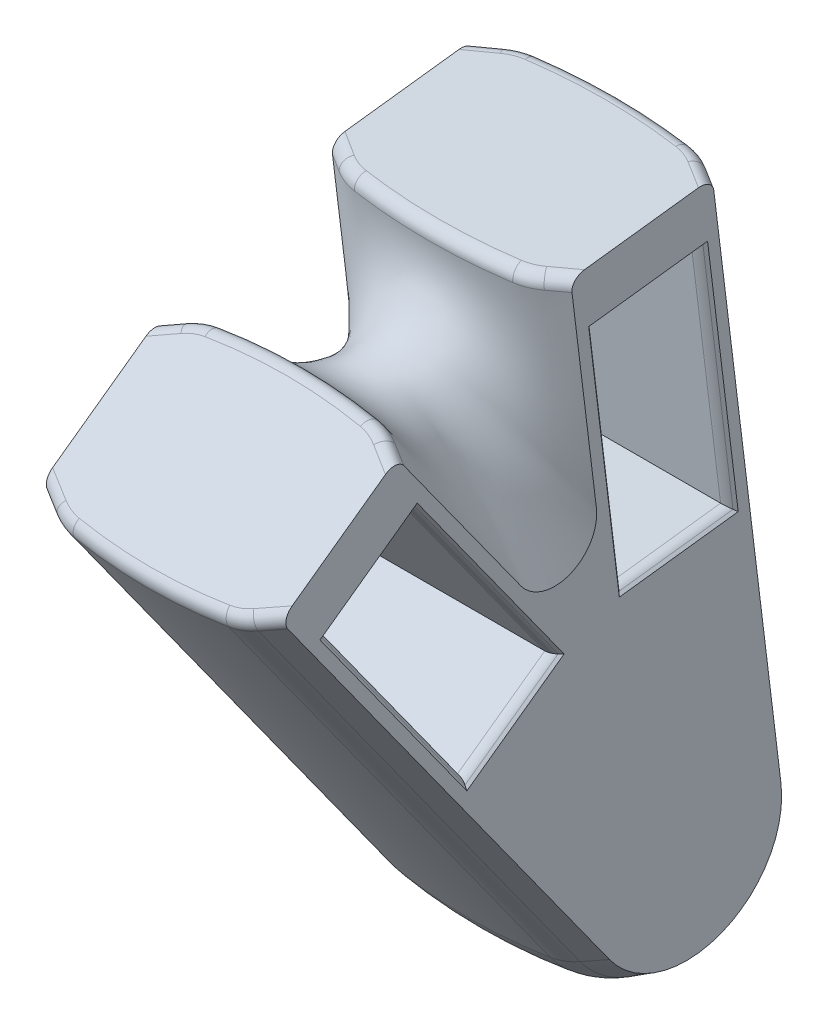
ISO-10303-21;
HEADER;
FILE_DESCRIPTION(('STEP AP214'),'2;1');
FILE_NAME('part.step','',(''),(''),'','','');
FILE_SCHEMA(('AUTOMOTIVE_DESIGN { 1 0 10303 214 1 1 1 1 }'));
ENDSEC;
DATA;
#1=APPLICATION_CONTEXT('core data for automotive mechanical design processes');
#2=APPLICATION_PROTOCOL_DEFINITION('international standard','automotive_design',2000,#1);
#3=PRODUCT_CONTEXT('',#1,'mechanical');
#4=PRODUCT('Part','Part','',(#3));
#5=PRODUCT_RELATED_PRODUCT_CATEGORY('part','',(#4));
#6=PRODUCT_DEFINITION_FORMATION('','',#4);
#7=PRODUCT_DEFINITION_CONTEXT('part definition',#1,'design');
#8=PRODUCT_DEFINITION('design','',#6,#7);
#9=PRODUCT_DEFINITION_SHAPE('','',#8);
#10=(LENGTH_UNIT() NAMED_UNIT(*) SI_UNIT(.MILLI.,.METRE.));
#11=(NAMED_UNIT(*) PLANE_ANGLE_UNIT() SI_UNIT($,.RADIAN.));
#12=(NAMED_UNIT(*) SI_UNIT($,.STERADIAN.) SOLID_ANGLE_UNIT());
#13=UNCERTAINTY_MEASURE_WITH_UNIT(LENGTH_MEASURE(1.E-05),#10,'distance_accuracy_value','');
#14=(GEOMETRIC_REPRESENTATION_CONTEXT(3) GLOBAL_UNCERTAINTY_ASSIGNED_CONTEXT((#13)) GLOBAL_UNIT_ASSIGNED_CONTEXT((#10,
#11,#12)) REPRESENTATION_CONTEXT('',''));
#15=CARTESIAN_POINT('',(0.,0.,0.));
#16=DIRECTION('',(0.,0.,1.));
#17=DIRECTION('',(1.,0.,0.));
#18=AXIS2_PLACEMENT_3D('',#15,#16,#17);
#19=CARTESIAN_POINT('',(560.,105.33601714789,-699.31774422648));
#20=CARTESIAN_POINT('',(560.239269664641,105.318203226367,-699.172661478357));
#21=CARTESIAN_POINT('',(560.717808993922,105.282575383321,-698.882495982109));
#22=CARTESIAN_POINT('',(561.435617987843,105.229133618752,-698.447247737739));
#23=CARTESIAN_POINT('',(562.153426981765,105.175691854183,-698.011999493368));
#24=CARTESIAN_POINT('',(562.631987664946,105.140062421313,-697.721821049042));
#25=CARTESIAN_POINT('',(563.167856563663,105.100166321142,-697.396893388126));
#26=CARTESIAN_POINT('',(563.779954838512,105.059774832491,-697.067931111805));
#27=CARTESIAN_POINT('',(564.74489110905,105.011162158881,-696.672012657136));
#28=CARTESIAN_POINT('',(565.746102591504,104.97505258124,-696.377923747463));
#29=CARTESIAN_POINT('',(566.430368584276,104.959579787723,-696.25190795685));
#30=CARTESIAN_POINT('',(567.870779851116,104.936394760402,-696.063081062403));
#31=CARTESIAN_POINT('',(570.0670436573,104.905504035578,-695.811496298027));
#32=CARTESIAN_POINT('',(573.372076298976,104.872372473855,-695.541661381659));
#33=CARTESIAN_POINT('',(576.68425150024,104.852478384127,-695.379637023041));
#34=CARTESIAN_POINT('',(580.000000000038,104.845845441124,-695.325616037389));
#35=CARTESIAN_POINT('',(583.315748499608,104.852478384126,-695.379637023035));
#36=CARTESIAN_POINT('',(586.627923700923,104.872372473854,-695.541661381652));
#37=CARTESIAN_POINT('',(589.93295634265,104.905504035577,-695.811496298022));
#38=CARTESIAN_POINT('',(592.129220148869,104.936394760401,-696.063081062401));
#39=CARTESIAN_POINT('',(593.569631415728,104.959579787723,-696.251907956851));
#40=CARTESIAN_POINT('',(594.253897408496,104.97505258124,-696.377923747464));
#41=CARTESIAN_POINT('',(595.255108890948,105.011162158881,-696.672012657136));
#42=CARTESIAN_POINT('',(596.220045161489,105.059774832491,-697.067931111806));
#43=CARTESIAN_POINT('',(596.832143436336,105.100166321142,-697.396893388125));
#44=CARTESIAN_POINT('',(597.368012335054,105.140062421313,-697.721821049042));
#45=CARTESIAN_POINT('',(597.846573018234,105.175691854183,-698.011999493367));
#46=CARTESIAN_POINT('',(598.564382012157,105.229133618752,-698.447247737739));
#47=CARTESIAN_POINT('',(599.282191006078,105.282575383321,-698.882495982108));
#48=CARTESIAN_POINT('',(599.760730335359,105.318203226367,-699.172661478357));
#49=CARTESIAN_POINT('',(600.,105.33601714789,-699.31774422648));
#50=CARTESIAN_POINT('',(560.,103.847283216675,-699.500537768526));
#51=CARTESIAN_POINT('',(560.239269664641,103.854883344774,-699.353783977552));
#52=CARTESIAN_POINT('',(560.717808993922,103.869137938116,-699.060554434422));
#53=CARTESIAN_POINT('',(561.435617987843,103.887682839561,-698.621544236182));
#54=CARTESIAN_POINT('',(562.153426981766,103.903390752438,-698.183368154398));
#55=CARTESIAN_POINT('',(562.631987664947,103.911969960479,-697.891794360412));
#56=CARTESIAN_POINT('',(563.167856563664,103.92052350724,-697.56561386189));
#57=CARTESIAN_POINT('',(563.779954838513,103.931883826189,-697.234589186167));
#58=CARTESIAN_POINT('',(564.744891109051,103.955169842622,-696.833362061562));
#59=CARTESIAN_POINT('',(565.746102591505,103.985169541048,-696.531595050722));
#60=CARTESIAN_POINT('',(566.430368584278,104.009879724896,-696.398803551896));
#61=CARTESIAN_POINT('',(567.870779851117,104.066564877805,-696.194043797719));
#62=CARTESIAN_POINT('',(570.067043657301,104.141999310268,-695.921257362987));
#63=CARTESIAN_POINT('',(573.372076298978,104.222791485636,-695.628716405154));
#64=CARTESIAN_POINT('',(576.684251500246,104.271253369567,-695.453072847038));
#65=CARTESIAN_POINT('',(580.000000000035,104.287405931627,-695.394512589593));
#66=CARTESIAN_POINT('',(583.315748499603,104.271253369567,-695.453072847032));
#67=CARTESIAN_POINT('',(586.627923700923,104.222791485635,-695.628716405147));
#68=CARTESIAN_POINT('',(589.932956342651,104.141999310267,-695.921257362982));
#69=CARTESIAN_POINT('',(592.12922014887,104.066564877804,-696.194043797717));
#70=CARTESIAN_POINT('',(593.569631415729,104.009879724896,-696.398803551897));
#71=CARTESIAN_POINT('',(594.253897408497,103.985169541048,-696.531595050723));
#72=CARTESIAN_POINT('',(595.255108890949,103.955169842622,-696.833362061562));
#73=CARTESIAN_POINT('',(596.22004516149,103.931883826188,-697.234589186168));
#74=CARTESIAN_POINT('',(596.832143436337,103.920523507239,-697.56561386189));
#75=CARTESIAN_POINT('',(597.368012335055,103.911969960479,-697.891794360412));
#76=CARTESIAN_POINT('',(597.846573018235,103.903390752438,-698.183368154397));
#77=CARTESIAN_POINT('',(598.564382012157,103.887682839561,-698.621544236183));
#78=CARTESIAN_POINT('',(599.282191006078,103.869137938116,-699.060554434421));
#79=CARTESIAN_POINT('',(599.760730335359,103.854883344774,-699.353783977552));
#80=CARTESIAN_POINT('',(600.,103.847283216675,-699.500537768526));
#81=CARTESIAN_POINT('',(560.,100.858884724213,-699.867466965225));
#82=CARTESIAN_POINT('',(560.239269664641,100.917635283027,-699.714997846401));
#83=CARTESIAN_POINT('',(560.717808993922,101.032283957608,-699.410983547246));
#84=CARTESIAN_POINT('',(561.435617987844,101.195699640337,-698.957733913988));
#85=CARTESIAN_POINT('',(562.153426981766,101.350557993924,-698.507256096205));
#86=CARTESIAN_POINT('',(562.631987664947,101.448090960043,-698.208773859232));
#87=CARTESIAN_POINT('',(563.167856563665,101.554127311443,-697.875576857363));
#88=CARTESIAN_POINT('',(563.779954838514,101.669626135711,-697.535604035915));
#89=CARTESIAN_POINT('',(564.744891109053,101.837630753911,-697.117041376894));
#90=CARTESIAN_POINT('',(565.746102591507,102.000740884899,-696.793721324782));
#91=CARTESIAN_POINT('',(566.43036858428,102.106392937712,-696.643597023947));
#92=CARTESIAN_POINT('',(567.870779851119,102.324002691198,-696.399438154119));
#93=CARTESIAN_POINT('',(570.067043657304,102.613663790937,-696.074219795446));
#94=CARTESIAN_POINT('',(573.372076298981,102.923992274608,-695.725521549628));
#95=CARTESIAN_POINT('',(576.684251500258,103.110179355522,-695.51619233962));
#96=CARTESIAN_POINT('',(580.000000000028,103.172240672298,-695.44640444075));
#97=CARTESIAN_POINT('',(583.315748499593,103.110179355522,-695.516192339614));
#98=CARTESIAN_POINT('',(586.627923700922,102.923992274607,-695.725521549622));
#99=CARTESIAN_POINT('',(589.932956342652,102.613663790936,-696.074219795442));
#100=CARTESIAN_POINT('',(592.129220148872,102.324002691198,-696.399438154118));
#101=CARTESIAN_POINT('',(593.569631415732,102.106392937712,-696.643597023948));
#102=CARTESIAN_POINT('',(594.253897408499,102.000740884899,-696.793721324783));
#103=CARTESIAN_POINT('',(595.255108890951,101.837630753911,-697.117041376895));
#104=CARTESIAN_POINT('',(596.220045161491,101.669626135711,-697.535604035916));
#105=CARTESIAN_POINT('',(596.832143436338,101.554127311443,-697.875576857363));
#106=CARTESIAN_POINT('',(597.368012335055,101.448090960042,-698.208773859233));
#107=CARTESIAN_POINT('',(597.846573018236,101.350557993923,-698.507256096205));
#108=CARTESIAN_POINT('',(598.564382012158,101.195699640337,-698.957733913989));
#109=CARTESIAN_POINT('',(599.282191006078,101.032283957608,-699.410983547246));
#110=CARTESIAN_POINT('',(599.760730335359,100.917635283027,-699.714997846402));
#111=CARTESIAN_POINT('',(600.,100.858884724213,-699.867466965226));
#112=CARTESIAN_POINT('',(560.,96.3678061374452,-700.418902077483));
#113=CARTESIAN_POINT('',(560.239269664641,96.5038646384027,-700.251139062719));
#114=CARTESIAN_POINT('',(560.717808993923,96.7702390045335,-699.917761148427));
#115=CARTESIAN_POINT('',(561.435617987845,97.1525726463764,-699.424138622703));
#116=CARTESIAN_POINT('',(562.153426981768,97.5176783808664,-698.93696044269));
#117=CARTESIAN_POINT('',(562.631987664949,97.7495964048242,-698.616460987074));
#118=CARTESIAN_POINT('',(563.167856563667,98.0028922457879,-698.259973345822));
#119=CARTESIAN_POINT('',(563.779954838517,98.2757327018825,-697.892924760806));
#120=CARTESIAN_POINT('',(564.744891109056,98.6624850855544,-697.429330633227));
#121=CARTESIAN_POINT('',(565.746102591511,99.0269045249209,-697.056117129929));
#122=CARTESIAN_POINT('',(566.430368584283,99.2550500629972,-696.869266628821));
#123=CARTESIAN_POINT('',(567.870779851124,99.7162901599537,-696.544627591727));
#124=CARTESIAN_POINT('',(570.067043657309,100.330277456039,-696.112297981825));
#125=CARTESIAN_POINT('',(573.372076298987,100.988109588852,-695.648866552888));
#126=CARTESIAN_POINT('',(576.684251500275,101.382803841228,-695.37071016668));
#127=CARTESIAN_POINT('',(580.000000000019,101.514368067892,-695.277981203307));
#128=CARTESIAN_POINT('',(583.315748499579,101.382803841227,-695.370710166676));
#129=CARTESIAN_POINT('',(586.627923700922,100.988109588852,-695.648866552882));
#130=CARTESIAN_POINT('',(589.932956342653,100.330277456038,-696.112297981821));
#131=CARTESIAN_POINT('',(592.129220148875,99.7162901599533,-696.544627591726));
#132=CARTESIAN_POINT('',(593.569631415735,99.2550500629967,-696.869266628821));
#133=CARTESIAN_POINT('',(594.253897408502,99.0269045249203,-697.05611712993));
#134=CARTESIAN_POINT('',(595.255108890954,98.6624850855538,-697.429330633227));
#135=CARTESIAN_POINT('',(596.220045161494,98.2757327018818,-697.892924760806));
#136=CARTESIAN_POINT('',(596.832143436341,98.0028922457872,-698.259973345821));
#137=CARTESIAN_POINT('',(597.368012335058,97.7495964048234,-698.616460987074));
#138=CARTESIAN_POINT('',(597.846573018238,97.5176783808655,-698.936960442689));
#139=CARTESIAN_POINT('',(598.564382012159,97.1525726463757,-699.424138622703));
#140=CARTESIAN_POINT('',(599.282191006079,96.7702390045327,-699.917761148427));
#141=CARTESIAN_POINT('',(599.76073033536,96.5038646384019,-700.251139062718));
#142=CARTESIAN_POINT('',(600.,96.3678061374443,-700.418902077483));
#143=CARTESIAN_POINT('',(559.999999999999,91.8934253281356,-700.968266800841));
#144=CARTESIAN_POINT('',(560.23926966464,92.1069853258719,-700.778493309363));
#145=CARTESIAN_POINT('',(560.717808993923,92.5254589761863,-700.402575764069));
#146=CARTESIAN_POINT('',(561.435617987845,93.1272304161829,-699.84958775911));
#147=CARTESIAN_POINT('',(562.153426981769,93.7030628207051,-699.307488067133));
#148=CARTESIAN_POINT('',(562.63198766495,94.0696583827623,-698.953338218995));
#149=CARTESIAN_POINT('',(563.167856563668,94.470526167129,-698.5608200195));
#150=CARTESIAN_POINT('',(563.779954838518,94.901063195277,-698.153063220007));
#151=CARTESIAN_POINT('',(564.744891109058,95.5071279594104,-697.625416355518));
#152=CARTESIAN_POINT('',(565.746102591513,96.0734576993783,-697.184726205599));
#153=CARTESIAN_POINT('',(566.430368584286,96.4245237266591,-696.950391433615));
#154=CARTESIAN_POINT('',(567.870779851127,97.1303150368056,-696.523806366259));
#155=CARTESIAN_POINT('',(570.067043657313,98.0698541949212,-695.955789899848));
#156=CARTESIAN_POINT('',(573.372076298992,99.0765030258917,-695.347007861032));
#157=CARTESIAN_POINT('',(576.684251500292,99.6804923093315,-694.981653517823));
#158=CARTESIAN_POINT('',(580.00000000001,99.8818223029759,-694.859859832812));
#159=CARTESIAN_POINT('',(583.315748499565,99.6804930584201,-694.981653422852));
#160=CARTESIAN_POINT('',(586.627923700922,99.0765045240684,-695.347007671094));
#161=CARTESIAN_POINT('',(589.932956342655,98.0698564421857,-695.955789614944));
#162=CARTESIAN_POINT('',(592.129220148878,97.1303177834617,-696.523806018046));
#163=CARTESIAN_POINT('',(593.569631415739,96.4245268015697,-696.950391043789));
#164=CARTESIAN_POINT('',(594.253897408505,96.0734609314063,-697.184725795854));
#165=CARTESIAN_POINT('',(595.255108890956,95.5071314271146,-697.625415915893));
#166=CARTESIAN_POINT('',(596.220045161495,94.9010668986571,-698.153062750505));
#167=CARTESIAN_POINT('',(596.832143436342,94.4705300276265,-698.560819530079));
#168=CARTESIAN_POINT('',(597.368012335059,94.0696623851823,-698.953337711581));
#169=CARTESIAN_POINT('',(597.846573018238,93.7030669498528,-699.307487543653));
#170=CARTESIAN_POINT('',(598.564382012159,93.1272347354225,-699.849587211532));
#171=CARTESIAN_POINT('',(599.282191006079,92.5254634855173,-700.40257519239));
#172=CARTESIAN_POINT('',(599.76073033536,92.1069899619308,-700.778492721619));
#173=CARTESIAN_POINT('',(600.,91.8934300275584,-700.968266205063));
#174=CARTESIAN_POINT('',(560.,87.6705136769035,-701.486864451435));
#175=CARTESIAN_POINT('',(560.239269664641,87.9577502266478,-701.269621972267));
#176=CARTESIAN_POINT('',(560.717808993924,88.5208123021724,-700.840428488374));
#177=CARTESIAN_POINT('',(561.435617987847,89.3311723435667,-700.212512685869));
#178=CARTESIAN_POINT('',(562.153426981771,90.1072993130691,-699.600471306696));
#179=CARTESIAN_POINT('',(562.631987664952,90.6018957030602,-699.203018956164));
#180=CARTESIAN_POINT('',(563.167856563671,91.1430139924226,-698.763863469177));
#181=CARTESIAN_POINT('',(563.779954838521,91.7234381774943,-698.304143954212));
#182=CARTESIAN_POINT('',(564.744891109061,92.5380029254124,-697.697062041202));
#183=CARTESIAN_POINT('',(565.746102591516,93.2963437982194,-697.17504177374));
#184=CARTESIAN_POINT('',(566.430368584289,93.7643454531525,-696.885021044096));
#185=CARTESIAN_POINT('',(567.870779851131,94.7028296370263,-696.340443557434));
#186=CARTESIAN_POINT('',(570.067043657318,95.9521342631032,-695.615378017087));
#187=CARTESIAN_POINT('',(573.372076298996,97.2906845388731,-694.838355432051));
#188=CARTESIAN_POINT('',(576.684251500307,98.0938186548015,-694.372068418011));
#189=CARTESIAN_POINT('',(580.000000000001,98.3615297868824,-694.216631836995));
#190=CARTESIAN_POINT('',(583.315748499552,98.0938165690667,-694.372068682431));
#191=CARTESIAN_POINT('',(586.627923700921,97.2906803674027,-694.838355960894));
#192=CARTESIAN_POINT('',(589.932956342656,95.9521280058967,-695.615378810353));
#193=CARTESIAN_POINT('',(592.129220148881,94.7028219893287,-696.340444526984));
#194=CARTESIAN_POINT('',(593.569631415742,93.764336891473,-696.885022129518));
#195=CARTESIAN_POINT('',(594.253897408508,93.2963347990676,-697.175042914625));
#196=CARTESIAN_POINT('',(595.255108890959,92.5379932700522,-697.697063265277));
#197=CARTESIAN_POINT('',(596.220045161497,91.7234278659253,-698.30414526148));
#198=CARTESIAN_POINT('',(596.832143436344,91.1430032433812,-698.763864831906));
#199=CARTESIAN_POINT('',(597.36801233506,90.6018845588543,-699.203020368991));
#200=CARTESIAN_POINT('',(597.84657301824,90.1072878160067,-699.600472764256));
#201=CARTESIAN_POINT('',(598.564382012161,89.3311603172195,-700.212514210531));
#202=CARTESIAN_POINT('',(599.28219100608,88.5207997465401,-700.840430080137));
#203=CARTESIAN_POINT('',(599.76073033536,87.957737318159,-701.269623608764));
#204=CARTESIAN_POINT('',(600.,87.6705005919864,-701.486866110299));
#205=CARTESIAN_POINT('',(560.,83.7128645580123,-701.972477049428));
#206=CARTESIAN_POINT('',(560.239269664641,84.0697716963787,-701.722861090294));
#207=CARTESIAN_POINT('',(560.717808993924,84.7695580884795,-701.230744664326));
#208=CARTESIAN_POINT('',(561.435617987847,85.7771540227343,-700.513916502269));
#209=CARTESIAN_POINT('',(562.153426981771,86.7426663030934,-699.818434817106));
#210=CARTESIAN_POINT('',(562.631987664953,87.3582862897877,-699.36900476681));
#211=CARTESIAN_POINT('',(563.167856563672,88.0320069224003,-698.873678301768));
#212=CARTESIAN_POINT('',(563.779954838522,88.7541531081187,-698.351881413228));
#213=CARTESIAN_POINT('',(564.744891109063,89.7658884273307,-697.651544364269));
#214=CARTESIAN_POINT('',(565.746102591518,90.7058397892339,-697.0357524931));
#215=CARTESIAN_POINT('',(566.430368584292,91.2844677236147,-696.682683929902));
#216=CARTESIAN_POINT('',(567.870779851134,92.4431184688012,-696.00571535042));
#217=CARTESIAN_POINT('',(570.067043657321,93.9855136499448,-695.10443199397));
#218=CARTESIAN_POINT('',(573.372076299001,95.6381003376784,-694.138628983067));
#219=CARTESIAN_POINT('',(576.684251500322,96.6296622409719,-693.559084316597));
#220=CARTESIAN_POINT('',(579.999999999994,96.9601859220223,-693.365895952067));
#221=CARTESIAN_POINT('',(583.315748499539,96.629668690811,-693.559083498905));
#222=CARTESIAN_POINT('',(586.627923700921,95.6381132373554,-694.138627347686));
#223=CARTESIAN_POINT('',(589.932956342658,93.9855329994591,-695.104429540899));
#224=CARTESIAN_POINT('',(592.129220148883,92.4431421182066,-696.005712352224));
#225=CARTESIAN_POINT('',(593.569631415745,91.2844941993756,-696.682680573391));
#226=CARTESIAN_POINT('',(594.253897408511,90.7058676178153,-697.035748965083));
#227=CARTESIAN_POINT('',(595.255108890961,89.7659182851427,-697.651540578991));
#228=CARTESIAN_POINT('',(596.220045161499,88.7541849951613,-698.351877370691));
#229=CARTESIAN_POINT('',(596.832143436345,88.0320401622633,-698.873674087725));
#230=CARTESIAN_POINT('',(597.368012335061,87.3583207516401,-699.369000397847));
#231=CARTESIAN_POINT('',(597.846573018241,86.7427018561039,-699.818430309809));
#232=CARTESIAN_POINT('',(598.564382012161,85.7771912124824,-700.513911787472));
#233=CARTESIAN_POINT('',(599.28219100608,84.7695969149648,-701.230739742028));
#234=CARTESIAN_POINT('',(599.76073033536,84.0698116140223,-701.722856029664));
#235=CARTESIAN_POINT('',(600.,83.712905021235,-701.97247191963));
#236=CARTESIAN_POINT('',(560.,79.9555526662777,-702.433513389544));
#237=CARTESIAN_POINT('',(560.239269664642,80.382266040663,-702.148570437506));
#238=CARTESIAN_POINT('',(560.717808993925,81.2190294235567,-701.587709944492));
#239=CARTESIAN_POINT('',(561.435617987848,82.4241844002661,-700.773495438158));
#240=CARTESIAN_POINT('',(562.153426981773,83.5793492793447,-699.986357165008));
#241=CARTESIAN_POINT('',(562.631987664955,84.3161337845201,-699.479643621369));
#242=CARTESIAN_POINT('',(563.167856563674,85.1225938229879,-698.9223006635));
#243=CARTESIAN_POINT('',(563.779954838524,85.9866539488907,-698.332262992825));
#244=CARTESIAN_POINT('',(564.744891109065,87.195980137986,-697.530379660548));
#245=CARTESIAN_POINT('',(565.746102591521,88.318104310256,-696.813503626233));
#246=CARTESIAN_POINT('',(566.430368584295,89.0078329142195,-696.393176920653));
#247=CARTESIAN_POINT('',(567.870779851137,90.3877481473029,-695.575722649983));
#248=CARTESIAN_POINT('',(570.067043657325,92.2246949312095,-694.487444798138));
#249=CARTESIAN_POINT('',(573.372076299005,94.1928828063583,-693.321313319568));
#250=CARTESIAN_POINT('',(576.684251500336,95.373811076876,-692.621581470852));
#251=CARTESIAN_POINT('',(579.999999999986,95.7674601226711,-692.388331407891));
#252=CARTESIAN_POINT('',(583.315748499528,95.3738260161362,-692.6215795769));
#253=CARTESIAN_POINT('',(586.62792370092,94.1929126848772,-693.321309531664));
#254=CARTESIAN_POINT('',(589.932956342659,92.2247397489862,-694.487439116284));
#255=CARTESIAN_POINT('',(592.129220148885,90.3878029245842,-695.575715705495));
#256=CARTESIAN_POINT('',(593.569631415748,89.0078942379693,-696.393169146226));
#257=CARTESIAN_POINT('',(594.253897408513,88.3181687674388,-696.813495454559));
#258=CARTESIAN_POINT('',(595.255108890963,87.1960492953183,-697.530370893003));
#259=CARTESIAN_POINT('',(596.220045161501,85.9867278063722,-698.332253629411));
#260=CARTESIAN_POINT('',(596.832143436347,85.1226708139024,-698.92229090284));
#261=CARTESIAN_POINT('',(597.368012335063,84.3162136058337,-699.479633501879));
#262=CARTESIAN_POINT('',(597.846573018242,83.5794316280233,-699.986346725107));
#263=CARTESIAN_POINT('',(598.564382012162,82.4242705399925,-700.77348451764));
#264=CARTESIAN_POINT('',(599.282191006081,81.2191193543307,-701.587698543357));
#265=CARTESIAN_POINT('',(599.76073033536,80.3823584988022,-702.14855871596));
#266=CARTESIAN_POINT('',(600.,79.9556463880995,-702.433501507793));
#267=CARTESIAN_POINT('',(560.,76.1369062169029,-702.902103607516));
#268=CARTESIAN_POINT('',(560.239269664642,76.6404249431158,-702.579354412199));
#269=CARTESIAN_POINT('',(560.717808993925,77.6278783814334,-701.944886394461));
#270=CARTESIAN_POINT('',(561.435617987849,79.050306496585,-701.026275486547));
#271=CARTESIAN_POINT('',(562.153426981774,80.4139825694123,-700.140755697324));
#272=CARTESIAN_POINT('',(562.631987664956,81.2839336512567,-699.572465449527));
#273=CARTESIAN_POINT('',(563.167856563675,82.2362548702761,-698.948404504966));
#274=CARTESIAN_POINT('',(563.779954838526,83.2563279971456,-698.285094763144));
#275=CARTESIAN_POINT('',(564.744891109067,84.6831127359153,-697.37464361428));
#276=CARTESIAN_POINT('',(565.746102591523,86.0059979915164,-696.550191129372));
#277=CARTESIAN_POINT('',(566.430368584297,86.8183672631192,-696.058632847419));
#278=CARTESIAN_POINT('',(567.87077985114,88.4427669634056,-695.092763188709));
#279=CARTESIAN_POINT('',(570.067043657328,90.6051753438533,-693.806934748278));
#280=CARTESIAN_POINT('',(573.372076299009,92.9220820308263,-692.429164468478));
#281=CARTESIAN_POINT('',(576.684251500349,94.3122470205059,-691.602459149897));
#282=CARTESIAN_POINT('',(579.999999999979,94.7756445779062,-691.32688531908));
#283=CARTESIAN_POINT('',(583.315748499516,94.3122695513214,-691.602456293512));
#284=CARTESIAN_POINT('',(586.62792370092,92.9221270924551,-692.429158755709));
#285=CARTESIAN_POINT('',(589.93295634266,90.6052429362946,-693.806926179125));
#286=CARTESIAN_POINT('',(592.129220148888,88.4428495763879,-695.0927527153));
#287=CARTESIAN_POINT('',(593.569631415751,86.818459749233,-696.058621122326));
#288=CARTESIAN_POINT('',(594.253897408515,86.0060952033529,-696.550178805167));
#289=CARTESIAN_POINT('',(595.255108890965,84.6832170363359,-697.374630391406));
#290=CARTESIAN_POINT('',(596.220045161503,83.25643938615,-698.285080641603));
#291=CARTESIAN_POINT('',(596.832143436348,82.2363709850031,-698.948389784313));
#292=CARTESIAN_POINT('',(597.368012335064,81.2840540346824,-699.572450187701));
#293=CARTESIAN_POINT('',(597.846573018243,80.4141067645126,-700.140739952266));
#294=CARTESIAN_POINT('',(598.564382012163,79.0504364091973,-701.026259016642));
#295=CARTESIAN_POINT('',(599.282191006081,77.6280140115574,-701.944869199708));
#296=CARTESIAN_POINT('',(599.76073033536,76.6405643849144,-702.579336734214));
#297=CARTESIAN_POINT('',(600.,76.1370475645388,-702.902085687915));
#298=CARTESIAN_POINT('',(560.,73.5082571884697,-703.224688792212));
#299=CARTESIAN_POINT('',(560.239269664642,74.0689705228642,-702.876131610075));
#300=CARTESIAN_POINT('',(560.717808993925,75.1686227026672,-702.191406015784));
#301=CARTESIAN_POINT('',(561.435617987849,76.7527775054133,-701.201483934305));
#302=CARTESIAN_POINT('',(562.153426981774,78.2716088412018,-700.248728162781));
#303=CARTESIAN_POINT('',(562.631987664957,79.2406160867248,-699.638331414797));
#304=CARTESIAN_POINT('',(563.167856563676,80.3014163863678,-698.968634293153));
#305=CARTESIAN_POINT('',(563.779954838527,81.4375710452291,-698.255242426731));
#306=CARTESIAN_POINT('',(564.744891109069,83.0263324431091,-697.270706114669));
#307=CARTESIAN_POINT('',(565.746102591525,84.4989584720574,-696.372975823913));
#308=CARTESIAN_POINT('',(566.430368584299,85.4029524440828,-695.832988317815));
#309=CARTESIAN_POINT('',(567.870779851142,87.2101821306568,-694.766311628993));
#310=CARTESIAN_POINT('',(570.067043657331,89.6159760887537,-693.346301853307));
#311=CARTESIAN_POINT('',(573.372076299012,92.1936597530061,-691.824779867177));
#312=CARTESIAN_POINT('',(576.684251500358,93.7402947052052,-690.911828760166));
#313=CARTESIAN_POINT('',(579.999999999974,94.2558511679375,-690.607504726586));
#314=CARTESIAN_POINT('',(583.315748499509,93.7403231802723,-690.911819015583));
#315=CARTESIAN_POINT('',(586.627923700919,92.1937167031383,-691.82476037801));
#316=CARTESIAN_POINT('',(589.932956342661,89.6160615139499,-693.346272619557));
#317=CARTESIAN_POINT('',(592.129220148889,87.2102865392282,-694.766275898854));
#318=CARTESIAN_POINT('',(593.569631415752,85.4030693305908,-695.832948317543));
#319=CARTESIAN_POINT('',(594.253897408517,84.4990813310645,-696.372933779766));
#320=CARTESIAN_POINT('',(595.255108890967,83.0264642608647,-697.270661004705));
#321=CARTESIAN_POINT('',(596.220045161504,81.437711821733,-698.255194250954));
#322=CARTESIAN_POINT('',(596.832143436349,80.3015631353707,-698.968584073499));
#323=CARTESIAN_POINT('',(597.368012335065,79.2407682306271,-699.638279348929));
#324=CARTESIAN_POINT('',(597.846573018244,78.2717658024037,-700.248674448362));
#325=CARTESIAN_POINT('',(598.564382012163,76.7529416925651,-701.201427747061));
#326=CARTESIAN_POINT('',(599.282191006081,75.1687941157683,-702.191347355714));
#327=CARTESIAN_POINT('',(599.76073033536,74.0691467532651,-702.876071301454));
#328=CARTESIAN_POINT('',(600.,73.5084358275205,-703.224627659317));
#329=CARTESIAN_POINT('',(560.,71.424917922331,-703.480305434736));
#330=CARTESIAN_POINT('',(560.239269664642,72.0325497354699,-703.111866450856));
#331=CARTESIAN_POINT('',(560.717808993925,73.2242357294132,-702.388423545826));
#332=CARTESIAN_POINT('',(561.43561798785,74.9410318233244,-701.343564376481));
#333=CARTESIAN_POINT('',(562.153426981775,76.5870950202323,-700.339010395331));
#334=CARTESIAN_POINT('',(562.631987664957,77.637317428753,-699.696174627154));
#335=CARTESIAN_POINT('',(563.167856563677,78.7870506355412,-698.991318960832));
#336=CARTESIAN_POINT('',(563.779954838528,80.0183918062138,-698.239344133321));
#337=CARTESIAN_POINT('',(564.74489110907,81.7400442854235,-697.19773562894));
#338=CARTESIAN_POINT('',(565.746102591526,83.3356032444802,-696.243557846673));
#339=CARTESIAN_POINT('',(566.4303685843,84.3148789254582,-695.66626617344));
#340=CARTESIAN_POINT('',(567.870779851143,86.2723975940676,-694.521941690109));
#341=CARTESIAN_POINT('',(570.067043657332,88.8782578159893,-692.99857776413));
#342=CARTESIAN_POINT('',(573.372076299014,91.6703031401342,-691.366332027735));
#343=CARTESIAN_POINT('',(576.684251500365,93.3455576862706,-690.386953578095));
#344=CARTESIAN_POINT('',(579.99999999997,93.903988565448,-690.060490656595));
#345=CARTESIAN_POINT('',(583.315748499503,93.3455891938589,-690.38695292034));
#346=CARTESIAN_POINT('',(586.627923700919,91.6703661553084,-691.366330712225));
#347=CARTESIAN_POINT('',(589.932956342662,88.8783523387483,-692.998575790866));
#348=CARTESIAN_POINT('',(592.12922014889,86.2725131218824,-694.521939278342));
#349=CARTESIAN_POINT('',(593.569631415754,84.3150082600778,-695.66626347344));
#350=CARTESIAN_POINT('',(594.253897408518,83.3357391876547,-696.243555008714));
#351=CARTESIAN_POINT('',(595.255108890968,81.74019014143,-697.197732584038));
#352=CARTESIAN_POINT('',(596.220045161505,80.0185475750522,-698.239340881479));
#353=CARTESIAN_POINT('',(596.83214343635,78.7872130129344,-698.991315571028));
#354=CARTESIAN_POINT('',(597.368012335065,77.6374857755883,-699.696171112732));
#355=CARTESIAN_POINT('',(597.846573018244,76.5872686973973,-700.339006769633));
#356=CARTESIAN_POINT('',(598.564382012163,74.9412134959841,-701.343560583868));
#357=CARTESIAN_POINT('',(599.282191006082,73.2244253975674,-702.388419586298));
#358=CARTESIAN_POINT('',(599.760730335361,72.0327447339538,-703.111862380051));
#359=CARTESIAN_POINT('',(600.,71.4251155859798,-703.480301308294));
#360=CARTESIAN_POINT('',(560.000000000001,69.9060501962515,-703.426207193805));
#361=CARTESIAN_POINT('',(560.239269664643,70.5486029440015,-703.050150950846));
#362=CARTESIAN_POINT('',(560.717808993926,71.8087848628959,-702.311951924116));
#363=CARTESIAN_POINT('',(561.435617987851,73.6242870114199,-701.246393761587));
#364=CARTESIAN_POINT('',(562.153426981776,75.3650184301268,-700.222575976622));
#365=CARTESIAN_POINT('',(562.631987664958,76.4756612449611,-699.567854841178));
#366=CARTESIAN_POINT('',(563.167856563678,77.6915515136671,-698.850223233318));
#367=CARTESIAN_POINT('',(563.779954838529,78.9937148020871,-698.083947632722));
#368=CARTESIAN_POINT('',(564.744891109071,80.8142867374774,-697.020264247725));
#369=CARTESIAN_POINT('',(565.746102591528,82.5014025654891,-696.043262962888));
#370=CARTESIAN_POINT('',(566.430368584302,83.536783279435,-695.450193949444));
#371=CARTESIAN_POINT('',(567.870779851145,85.6063508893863,-694.272283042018));
#372=CARTESIAN_POINT('',(570.067043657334,88.3613712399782,-692.704215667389));
#373=CARTESIAN_POINT('',(573.372076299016,91.3132329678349,-691.024081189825));
#374=CARTESIAN_POINT('',(576.68425150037,93.0843770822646,-690.015972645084));
#375=CARTESIAN_POINT('',(579.999999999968,93.6747685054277,-689.679932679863));
#376=CARTESIAN_POINT('',(583.315748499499,93.084400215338,-690.015969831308));
#377=CARTESIAN_POINT('',(586.627923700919,91.3132792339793,-691.024075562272));
#378=CARTESIAN_POINT('',(589.932956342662,88.3614406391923,-692.70420722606));
#379=CARTESIAN_POINT('',(592.129220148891,85.6064357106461,-694.272272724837));
#380=CARTESIAN_POINT('',(593.569631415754,83.5368782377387,-695.45018239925));
#381=CARTESIAN_POINT('',(594.253897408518,82.5015023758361,-696.043250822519));
#382=CARTESIAN_POINT('',(595.255108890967,80.8143938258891,-697.020251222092));
#383=CARTESIAN_POINT('',(596.220045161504,78.9938291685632,-698.083933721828));
#384=CARTESIAN_POINT('',(596.83214343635,77.6916707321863,-698.850208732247));
#385=CARTESIAN_POINT('',(597.368012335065,76.4757848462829,-699.567839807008));
#386=CARTESIAN_POINT('',(597.846573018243,75.3651459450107,-700.222560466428));
#387=CARTESIAN_POINT('',(598.564382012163,73.6244203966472,-701.246377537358));
#388=CARTESIAN_POINT('',(599.28219100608,71.8089241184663,-702.311934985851));
#389=CARTESIAN_POINT('',(599.76073033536,70.548746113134,-703.050133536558));
#390=CARTESIAN_POINT('',(599.999999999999,69.906195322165,-703.426189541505));
#391=CARTESIAN_POINT('',(559.999999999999,67.7216405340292,-702.603567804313));
#392=CARTESIAN_POINT('',(560.239269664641,68.4152634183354,-702.236129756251));
#393=CARTESIAN_POINT('',(560.717808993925,69.7756195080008,-701.515073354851));
#394=CARTESIAN_POINT('',(561.435617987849,71.7354846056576,-700.474947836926));
#395=CARTESIAN_POINT('',(562.153426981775,73.6146806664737,-699.476281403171));
#396=CARTESIAN_POINT('',(562.631987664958,74.8137012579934,-698.838140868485));
#397=CARTESIAN_POINT('',(563.167856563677,76.1263633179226,-698.138970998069));
#398=CARTESIAN_POINT('',(563.779954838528,77.5321146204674,-697.39165426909));
#399=CARTESIAN_POINT('',(564.744891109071,79.4973454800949,-696.351742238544));
#400=CARTESIAN_POINT('',(565.746102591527,81.3183240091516,-695.393658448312));
#401=CARTESIAN_POINT('',(566.430368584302,82.4357123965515,-694.809871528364));
#402=CARTESIAN_POINT('',(567.870779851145,84.6690344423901,-693.647819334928));
#403=CARTESIAN_POINT('',(570.067043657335,87.642045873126,-692.100873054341));
#404=CARTESIAN_POINT('',(573.372076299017,90.8274733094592,-690.443382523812));
#405=CARTESIAN_POINT('',(576.684251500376,92.7387576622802,-689.448868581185));
#406=CARTESIAN_POINT('',(579.999999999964,93.3758605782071,-689.117365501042));
#407=CARTESIAN_POINT('',(583.315748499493,92.7387743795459,-689.448880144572));
#408=CARTESIAN_POINT('',(586.627923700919,90.8275067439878,-690.443405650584));
#409=CARTESIAN_POINT('',(589.932956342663,87.6420960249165,-692.100907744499));
#410=CARTESIAN_POINT('',(592.129220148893,84.6690957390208,-693.64786173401));
#411=CARTESIAN_POINT('',(593.569631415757,82.4357810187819,-694.809918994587));
#412=CARTESIAN_POINT('',(594.253897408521,81.3183961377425,-695.393708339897));
#413=CARTESIAN_POINT('',(595.255108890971,79.4974228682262,-696.351795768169));
#414=CARTESIAN_POINT('',(596.220045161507,77.5321972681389,-697.391711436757));
#415=CARTESIAN_POINT('',(596.832143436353,76.1264494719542,-698.139030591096));
#416=CARTESIAN_POINT('',(597.368012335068,74.8137905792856,-698.838202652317));
#417=CARTESIAN_POINT('',(597.846573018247,73.6147728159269,-699.476345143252));
#418=CARTESIAN_POINT('',(598.564382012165,71.7355809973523,-700.475014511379));
#419=CARTESIAN_POINT('',(599.282191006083,69.7757201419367,-701.515142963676));
#420=CARTESIAN_POINT('',(599.760730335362,68.4153668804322,-702.236201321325));
#421=CARTESIAN_POINT('',(600.000000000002,67.7217454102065,-702.60364034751));
#422=CARTESIAN_POINT('',(560.000000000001,65.8941132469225,-701.090093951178));
#423=CARTESIAN_POINT('',(560.239269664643,66.6301815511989,-700.749807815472));
#424=CARTESIAN_POINT('',(560.717808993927,68.0738110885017,-700.082211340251));
#425=CARTESIAN_POINT('',(561.435617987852,70.1537341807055,-699.119744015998));
#426=CARTESIAN_POINT('',(562.153426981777,72.1481360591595,-698.196204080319));
#427=CARTESIAN_POINT('',(562.63198766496,73.4207259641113,-697.606460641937));
#428=CARTESIAN_POINT('',(563.16785656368,74.8139663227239,-696.960543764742));
#429=CARTESIAN_POINT('',(563.779954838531,76.3059152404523,-696.269551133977));
#430=CARTESIAN_POINT('',(564.744891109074,78.3913300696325,-695.306005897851));
#431=CARTESIAN_POINT('',(565.74610259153,80.3233071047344,-694.415982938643));
#432=CARTESIAN_POINT('',(566.430368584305,81.50853426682,-693.871939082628));
#433=CARTESIAN_POINT('',(567.870779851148,83.8771304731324,-692.786981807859));
#434=CARTESIAN_POINT('',(570.067043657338,87.0302203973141,-691.342672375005));
#435=CARTESIAN_POINT('',(573.37207629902,90.4085927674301,-689.79516064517));
#436=CARTESIAN_POINT('',(576.684251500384,92.4356446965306,-688.866637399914));
#437=CARTESIAN_POINT('',(579.99999999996,93.1113345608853,-688.557128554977));
#438=CARTESIAN_POINT('',(583.315748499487,92.435654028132,-688.86663929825));
#439=CARTESIAN_POINT('',(586.627923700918,90.40861143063,-689.795164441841));
#440=CARTESIAN_POINT('',(589.932956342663,87.0302483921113,-691.34267807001));
#441=CARTESIAN_POINT('',(592.129220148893,83.8771646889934,-692.78698876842));
#442=CARTESIAN_POINT('',(593.569631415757,81.5085725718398,-693.87194687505));
#443=CARTESIAN_POINT('',(594.25389740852,80.3233473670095,-694.415991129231));
#444=CARTESIAN_POINT('',(595.255108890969,78.39137326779,-695.306014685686));
#445=CARTESIAN_POINT('',(596.220045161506,76.3059613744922,-696.269560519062));
#446=CARTESIAN_POINT('',(596.832143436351,74.8140144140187,-696.960553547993));
#447=CARTESIAN_POINT('',(597.368012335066,73.4207758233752,-697.606470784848));
#448=CARTESIAN_POINT('',(597.846573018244,72.1481874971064,-698.196214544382));
#449=CARTESIAN_POINT('',(598.564382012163,70.1537879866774,-699.11975496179));
#450=CARTESIAN_POINT('',(599.28219100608,68.0738672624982,-700.082222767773));
#451=CARTESIAN_POINT('',(599.760730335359,66.6302393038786,-700.749819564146));
#452=CARTESIAN_POINT('',(599.999999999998,65.8941717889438,-701.090105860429));
#453=CARTESIAN_POINT('',(559.999999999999,64.6588462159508,-699.040088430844));
#454=CARTESIAN_POINT('',(560.239269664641,65.4223079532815,-698.741209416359));
#455=CARTESIAN_POINT('',(560.717808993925,66.9197157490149,-698.155006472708));
#456=CARTESIAN_POINT('',(561.43561798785,69.0772804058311,-697.310367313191));
#457=CARTESIAN_POINT('',(562.153426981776,71.146298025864,-696.500393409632));
#458=CARTESIAN_POINT('',(562.631987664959,72.4666147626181,-695.983519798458));
#459=CARTESIAN_POINT('',(563.167856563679,73.9121741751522,-695.417616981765));
#460=CARTESIAN_POINT('',(563.77995483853,75.4599720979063,-694.811689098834));
#461=CARTESIAN_POINT('',(564.744891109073,77.622856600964,-693.964965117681));
#462=CARTESIAN_POINT('',(565.74610259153,79.6259265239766,-693.180801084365));
#463=CARTESIAN_POINT('',(566.430368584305,80.8542611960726,-692.699928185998));
#464=CARTESIAN_POINT('',(567.870779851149,83.308418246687,-691.739162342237));
#465=CARTESIAN_POINT('',(570.067043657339,86.5754092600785,-690.460184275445));
#466=CARTESIAN_POINT('',(573.372076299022,90.0758231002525,-689.08982511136));
#467=CARTESIAN_POINT('',(576.684251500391,92.1761017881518,-688.267598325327));
#468=CARTESIAN_POINT('',(579.999999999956,92.8762004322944,-687.993521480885));
#469=CARTESIAN_POINT('',(583.315748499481,92.1761100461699,-688.267598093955));
#470=CARTESIAN_POINT('',(586.627923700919,90.0758396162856,-689.089824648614));
#471=CARTESIAN_POINT('',(589.932956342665,86.5754340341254,-690.460183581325));
#472=CARTESIAN_POINT('',(592.129220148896,83.3084485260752,-691.739161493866));
#473=CARTESIAN_POINT('',(593.56963141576,80.8542950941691,-692.699927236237));
#474=CARTESIAN_POINT('',(594.253897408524,79.6259621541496,-693.180800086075));
#475=CARTESIAN_POINT('',(595.255108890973,77.6228948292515,-693.964964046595));
#476=CARTESIAN_POINT('',(596.220045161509,75.4600129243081,-694.811687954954));
#477=CARTESIAN_POINT('',(596.832143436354,73.9122167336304,-695.417615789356));
#478=CARTESIAN_POINT('',(597.368012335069,72.4666588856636,-695.983518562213));
#479=CARTESIAN_POINT('',(597.846573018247,71.146343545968,-696.500392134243));
#480=CARTESIAN_POINT('',(598.564382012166,69.0773280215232,-697.310365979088));
#481=CARTESIAN_POINT('',(599.282191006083,66.9197654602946,-698.155005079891));
#482=CARTESIAN_POINT('',(599.760730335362,65.4223590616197,-698.741207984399));
#483=CARTESIAN_POINT('',(600.000000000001,64.6588980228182,-699.040086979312));
#484=CARTESIAN_POINT('',(560.,64.1749812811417,-696.696126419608));
#485=CARTESIAN_POINT('',(560.239269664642,64.9464136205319,-696.446252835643));
#486=CARTESIAN_POINT('',(560.717808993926,66.4595396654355,-695.956332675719));
#487=CARTESIAN_POINT('',(561.435617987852,68.6400128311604,-695.250933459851));
#488=CARTESIAN_POINT('',(562.153426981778,70.7312700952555,-694.575015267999));
#489=CARTESIAN_POINT('',(562.631987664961,72.0659675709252,-694.144056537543));
#490=CARTESIAN_POINT('',(563.167856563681,73.5273815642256,-693.672432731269));
#491=CARTESIAN_POINT('',(563.779954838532,75.0918676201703,-693.166889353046));
#492=CARTESIAN_POINT('',(564.744891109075,77.2771033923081,-692.458548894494));
#493=CARTESIAN_POINT('',(565.746102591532,79.2997707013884,-691.800388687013));
#494=CARTESIAN_POINT('',(566.430368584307,80.5392978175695,-691.3951717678));
#495=CARTESIAN_POINT('',(567.870779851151,83.0148607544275,-690.583694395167));
#496=CARTESIAN_POINT('',(570.067043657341,86.3103506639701,-689.503456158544));
#497=CARTESIAN_POINT('',(573.372076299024,89.8413035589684,-688.346043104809));
#498=CARTESIAN_POINT('',(576.684251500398,91.9599074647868,-687.651587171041));
#499=CARTESIAN_POINT('',(579.999999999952,92.6661142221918,-687.420097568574));
#500=CARTESIAN_POINT('',(583.315748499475,91.9599141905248,-687.651576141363));
#501=CARTESIAN_POINT('',(586.627923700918,89.8413170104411,-688.346021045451));
#502=CARTESIAN_POINT('',(589.932956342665,86.3103708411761,-689.503423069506));
#503=CARTESIAN_POINT('',(592.129220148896,83.0148854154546,-690.583653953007));
#504=CARTESIAN_POINT('',(593.56963141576,80.5393254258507,-691.39512649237));
#505=CARTESIAN_POINT('',(594.253897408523,79.2997997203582,-691.800341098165));
#506=CARTESIAN_POINT('',(595.255108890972,77.2771345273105,-692.458497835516));
#507=CARTESIAN_POINT('',(596.220045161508,75.0919008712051,-693.16683482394));
#508=CARTESIAN_POINT('',(596.832143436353,73.5274162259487,-693.672375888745));
#509=CARTESIAN_POINT('',(597.368012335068,72.0660035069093,-694.14399760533));
#510=CARTESIAN_POINT('',(597.846573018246,70.7313071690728,-694.574954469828));
#511=CARTESIAN_POINT('',(598.564382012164,68.640051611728,-695.250869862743));
#512=CARTESIAN_POINT('',(599.282191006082,66.4595801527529,-695.956266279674));
#513=CARTESIAN_POINT('',(599.76073033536,64.9464552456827,-696.44618457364));
#514=CARTESIAN_POINT('',(599.999999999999,64.1750234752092,-696.696057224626));
#515=CARTESIAN_POINT('',(560.,64.4902140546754,-694.344266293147));
#516=CARTESIAN_POINT('',(560.239269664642,65.2488871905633,-694.143142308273));
#517=CARTESIAN_POINT('',(560.717808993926,66.7371104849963,-693.7490038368));
#518=CARTESIAN_POINT('',(561.435617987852,68.8820764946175,-693.182124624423));
#519=CARTESIAN_POINT('',(562.153426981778,70.9396735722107,-692.639573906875));
#520=CARTESIAN_POINT('',(562.631987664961,72.253162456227,-692.294092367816));
#521=CARTESIAN_POINT('',(563.167856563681,73.6915136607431,-691.916269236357));
#522=CARTESIAN_POINT('',(563.779954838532,75.2308924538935,-691.510595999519));
#523=CARTESIAN_POINT('',(564.744891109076,77.3796522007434,-690.939912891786));
#524=CARTESIAN_POINT('',(565.746102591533,79.3669553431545,-690.40707556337));
#525=CARTESIAN_POINT('',(566.430368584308,80.583611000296,-690.077090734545));
#526=CARTESIAN_POINT('',(567.870779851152,83.0121045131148,-689.414047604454));
#527=CARTESIAN_POINT('',(570.067043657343,86.244940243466,-688.531412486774));
#528=CARTESIAN_POINT('',(573.372076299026,89.7087691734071,-687.585729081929));
#529=CARTESIAN_POINT('',(576.684251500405,91.7871018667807,-687.018316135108));
#530=CARTESIAN_POINT('',(579.999999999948,92.4798868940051,-686.829174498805));
#531=CARTESIAN_POINT('',(583.315748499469,91.7871139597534,-687.018304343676));
#532=CARTESIAN_POINT('',(586.627923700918,89.7087933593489,-687.585705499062));
#533=CARTESIAN_POINT('',(589.932956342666,86.2449765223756,-688.531377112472));
#534=CARTESIAN_POINT('',(592.129220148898,83.0121488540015,-689.414004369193));
#535=CARTESIAN_POINT('',(593.569631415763,80.5836606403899,-690.077042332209));
#536=CARTESIAN_POINT('',(594.253897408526,79.3670075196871,-690.407024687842));
#537=CARTESIAN_POINT('',(595.255108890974,77.3797081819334,-690.939858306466));
#538=CARTESIAN_POINT('',(596.22004516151,75.2309522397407,-691.51053770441));
#539=CARTESIAN_POINT('',(596.832143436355,73.6915759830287,-691.916208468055));
#540=CARTESIAN_POINT('',(597.36801233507,72.2532270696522,-692.294029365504));
#541=CARTESIAN_POINT('',(597.846573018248,70.9397402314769,-692.639508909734));
#542=CARTESIAN_POINT('',(598.564382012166,68.8821462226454,-693.182056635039));
#543=CARTESIAN_POINT('',(599.282191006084,66.7371832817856,-693.748932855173));
#544=CARTESIAN_POINT('',(599.760730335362,65.2489620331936,-694.143069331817));
#545=CARTESIAN_POINT('',(600.000000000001,64.4902899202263,-694.344192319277));
#546=CARTESIAN_POINT('',(560.,65.5364606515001,-692.257742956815));
#547=CARTESIAN_POINT('',(560.239269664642,66.2634608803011,-692.097606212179));
#548=CARTESIAN_POINT('',(560.717808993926,67.689719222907,-691.784039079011));
#549=CARTESIAN_POINT('',(561.435617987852,69.745880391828,-691.333807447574));
#550=CARTESIAN_POINT('',(562.153426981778,71.7188152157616,-690.90369488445));
#551=CARTESIAN_POINT('',(562.631987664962,72.9786245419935,-690.630366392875));
#552=CARTESIAN_POINT('',(563.167856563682,74.3584056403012,-690.33177427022));
#553=CARTESIAN_POINT('',(563.779954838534,75.8345436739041,-690.010322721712));
#554=CARTESIAN_POINT('',(564.744891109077,77.8931531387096,-689.555267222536));
#555=CARTESIAN_POINT('',(565.746102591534,79.7949437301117,-689.127165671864));
#556=CARTESIAN_POINT('',(566.43036858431,80.9576461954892,-688.859649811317));
#557=CARTESIAN_POINT('',(567.870779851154,83.2765886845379,-688.319380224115));
#558=CARTESIAN_POINT('',(570.067043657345,86.3635953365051,-687.600188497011));
#559=CARTESIAN_POINT('',(573.372076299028,89.6711833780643,-686.829633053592));
#560=CARTESIAN_POINT('',(576.684251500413,91.6557733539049,-686.367299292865));
#561=CARTESIAN_POINT('',(579.999999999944,92.3173105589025,-686.213179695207));
#562=CARTESIAN_POINT('',(583.315748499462,91.6557840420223,-686.367272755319));
#563=CARTESIAN_POINT('',(586.627923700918,89.6712047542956,-686.829579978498));
#564=CARTESIAN_POINT('',(589.932956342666,86.3636274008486,-687.600108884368));
#565=CARTESIAN_POINT('',(592.129220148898,83.2766278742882,-688.31928291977));
#566=CARTESIAN_POINT('',(593.569631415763,80.9576900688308,-688.859540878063));
#567=CARTESIAN_POINT('',(594.253897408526,79.7949898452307,-689.127051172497));
#568=CARTESIAN_POINT('',(595.255108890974,77.8932026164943,-689.555144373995));
#569=CARTESIAN_POINT('',(596.22004516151,75.8345965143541,-690.010191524));
#570=CARTESIAN_POINT('',(596.832143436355,74.3584607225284,-690.331637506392));
#571=CARTESIAN_POINT('',(597.368012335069,72.9786816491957,-690.63022460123));
#572=CARTESIAN_POINT('',(597.846573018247,71.7188741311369,-690.903548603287));
#573=CARTESIAN_POINT('',(598.564382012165,69.7459420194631,-691.333654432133));
#574=CARTESIAN_POINT('',(599.282191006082,67.6897835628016,-691.783879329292));
#575=CARTESIAN_POINT('',(599.76073033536,66.2635270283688,-692.097441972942));
#576=CARTESIAN_POINT('',(599.999999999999,65.5365277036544,-692.25757647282));
#577=CARTESIAN_POINT('',(560.,66.6153170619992,-691.187235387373));
#578=CARTESIAN_POINT('',(560.239269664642,67.3114923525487,-691.0452025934));
#579=CARTESIAN_POINT('',(560.717808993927,68.6774143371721,-690.767281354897));
#580=CARTESIAN_POINT('',(561.435617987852,70.6470115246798,-690.368832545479));
#581=CARTESIAN_POINT('',(562.153426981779,72.5373229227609,-689.988816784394));
#582=CARTESIAN_POINT('',(562.631987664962,73.7446771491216,-689.747762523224));
#583=CARTESIAN_POINT('',(563.167856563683,75.0671842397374,-689.484683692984));
#584=CARTESIAN_POINT('',(563.779954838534,76.4815861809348,-689.200791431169));
#585=CARTESIAN_POINT('',(564.744891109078,78.4525414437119,-688.796653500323));
#586=CARTESIAN_POINT('',(565.746102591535,80.27157890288,-688.413923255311));
#587=CARTESIAN_POINT('',(566.430368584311,81.3823555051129,-688.172894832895));
#588=CARTESIAN_POINT('',(567.870779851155,83.5961858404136,-687.683998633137));
#589=CARTESIAN_POINT('',(570.067043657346,86.5432718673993,-687.03320124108));
#590=CARTESIAN_POINT('',(573.37207629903,89.7009504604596,-686.335934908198));
#591=CARTESIAN_POINT('',(576.684251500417,91.5955994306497,-685.917580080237));
#592=CARTESIAN_POINT('',(579.999999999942,92.2271618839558,-685.778123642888));
#593=CARTESIAN_POINT('',(583.315748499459,91.5956264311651,-685.917562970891));
#594=CARTESIAN_POINT('',(586.627923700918,89.7010044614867,-686.335900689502));
#595=CARTESIAN_POINT('',(589.932956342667,86.5433528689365,-687.033149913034));
#596=CARTESIAN_POINT('',(592.1292201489,83.5962848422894,-687.683935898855));
#597=CARTESIAN_POINT('',(593.569631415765,81.3824663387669,-688.172824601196));
#598=CARTESIAN_POINT('',(594.253897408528,80.2716953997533,-688.413849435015));
#599=CARTESIAN_POINT('',(595.255108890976,78.4526664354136,-688.796574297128));
#600=CARTESIAN_POINT('',(596.220045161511,76.4817196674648,-689.200706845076));
#601=CARTESIAN_POINT('',(596.832143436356,75.0673233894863,-689.484595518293));
#602=CARTESIAN_POINT('',(597.36801233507,73.7448214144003,-689.747671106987));
#603=CARTESIAN_POINT('',(597.846573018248,72.5374717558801,-689.988722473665));
#604=CARTESIAN_POINT('',(598.564382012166,70.6471672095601,-690.36873389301));
#605=CARTESIAN_POINT('',(599.282191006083,68.677576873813,-690.76717836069));
#606=CARTESIAN_POINT('',(599.760730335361,67.3116594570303,-691.0450967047));
#607=CARTESIAN_POINT('',(600.,66.6154864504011,-691.187128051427));
#608=CARTESIAN_POINT('',(560.,68.3190152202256,-689.96124337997));
#609=CARTESIAN_POINT('',(560.239269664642,68.9672262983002,-689.83644652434));
#610=CARTESIAN_POINT('',(560.717808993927,70.2392547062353,-689.592542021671));
#611=CARTESIAN_POINT('',(561.435617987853,72.0741160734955,-689.243752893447));
#612=CARTESIAN_POINT('',(562.153426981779,73.8357961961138,-688.912031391));
#613=CARTESIAN_POINT('',(562.631987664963,74.9614661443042,-688.702263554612));
#614=CARTESIAN_POINT('',(563.167856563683,76.194773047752,-688.473710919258));
#615=CARTESIAN_POINT('',(563.779954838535,77.5130561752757,-688.226073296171));
#616=CARTESIAN_POINT('',(564.744891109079,79.3476427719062,-687.870195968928));
#617=CARTESIAN_POINT('',(565.746102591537,81.0380516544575,-687.529427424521));
#618=CARTESIAN_POINT('',(566.430368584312,82.0682011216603,-687.312085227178));
#619=CARTESIAN_POINT('',(567.870779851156,84.1189158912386,-686.868142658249));
#620=CARTESIAN_POINT('',(570.067043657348,86.8488681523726,-686.277195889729));
#621=CARTESIAN_POINT('',(573.372076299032,89.7739072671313,-685.644066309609));
#622=CARTESIAN_POINT('',(576.684251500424,91.5289735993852,-685.264197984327));
#623=CARTESIAN_POINT('',(579.999999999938,92.1140071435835,-685.137569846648));
#624=CARTESIAN_POINT('',(583.315748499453,91.5289958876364,-685.26417767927));
#625=CARTESIAN_POINT('',(586.627923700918,89.7739518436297,-685.644025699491));
#626=CARTESIAN_POINT('',(589.932956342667,86.8489350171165,-686.27713497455));
#627=CARTESIAN_POINT('',(592.129220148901,84.1189976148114,-686.868068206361));
#628=CARTESIAN_POINT('',(593.569631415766,82.0682926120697,-687.312001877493));
#629=CARTESIAN_POINT('',(594.253897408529,81.0381478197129,-687.529339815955));
#630=CARTESIAN_POINT('',(595.255108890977,79.34774594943,-687.870101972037));
#631=CARTESIAN_POINT('',(596.220045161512,77.5131663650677,-688.225972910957));
#632=CARTESIAN_POINT('',(596.832143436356,76.1948879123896,-688.473606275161));
#633=CARTESIAN_POINT('',(597.368012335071,74.9615852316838,-688.702155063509));
#634=CARTESIAN_POINT('',(597.846573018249,73.8359190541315,-688.911919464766));
#635=CARTESIAN_POINT('',(598.564382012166,72.0742445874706,-689.243635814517));
#636=CARTESIAN_POINT('',(599.282191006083,70.2393888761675,-689.592419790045));
#637=CARTESIAN_POINT('',(599.760730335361,68.9673642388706,-689.836320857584));
#638=CARTESIAN_POINT('',(600.,68.319155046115,-689.961115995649));
#639=CARTESIAN_POINT('',(560.,70.4686430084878,-688.41432365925));
#640=CARTESIAN_POINT('',(560.239269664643,71.0573167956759,-688.309383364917));
#641=CARTESIAN_POINT('',(560.717808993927,72.2128019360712,-688.104703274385));
#642=CARTESIAN_POINT('',(561.435617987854,73.8804423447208,-687.813284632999));
#643=CARTESIAN_POINT('',(562.15342698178,75.4824954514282,-687.537467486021));
#644=CARTESIAN_POINT('',(562.631987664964,76.5068102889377,-687.363992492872));
#645=CARTESIAN_POINT('',(563.167856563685,77.6294434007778,-687.175534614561));
#646=CARTESIAN_POINT('',(563.779954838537,78.8284497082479,-686.969885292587));
#647=CARTESIAN_POINT('',(564.744891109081,80.4937491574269,-686.669510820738));
#648=CARTESIAN_POINT('',(565.746102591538,82.0244087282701,-686.376534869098));
#649=CARTESIAN_POINT('',(566.430368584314,82.9543719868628,-686.185798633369));
#650=CARTESIAN_POINT('',(567.870779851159,84.8023426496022,-685.791883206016));
#651=CARTESIAN_POINT('',(570.067043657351,87.2624093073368,-685.267543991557));
#652=CARTESIAN_POINT('',(573.372076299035,89.8982906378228,-684.705795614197));
#653=CARTESIAN_POINT('',(576.684251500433,91.4798641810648,-684.368763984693));
#654=CARTESIAN_POINT('',(579.999999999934,92.0070658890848,-684.256417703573));
#655=CARTESIAN_POINT('',(583.315748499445,91.4798829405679,-684.368750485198));
#656=CARTESIAN_POINT('',(586.627923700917,89.8983281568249,-684.705768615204));
#657=CARTESIAN_POINT('',(589.932956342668,87.2624655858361,-685.267503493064));
#658=CARTESIAN_POINT('',(592.129220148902,84.8024114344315,-685.791833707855));
#659=CARTESIAN_POINT('',(593.569631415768,82.9544489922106,-686.185743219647));
#660=CARTESIAN_POINT('',(594.25389740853,82.0244896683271,-686.376476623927));
#661=CARTESIAN_POINT('',(595.255108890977,80.4938359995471,-686.669448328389));
#662=CARTESIAN_POINT('',(596.220045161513,78.8285424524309,-686.969818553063));
#663=CARTESIAN_POINT('',(596.832143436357,77.6295400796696,-687.175465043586));
#664=CARTESIAN_POINT('',(597.368012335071,76.5069105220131,-687.363920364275));
#665=CARTESIAN_POINT('',(597.846573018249,75.4825988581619,-687.537393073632));
#666=CARTESIAN_POINT('',(598.564382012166,73.8805505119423,-687.813206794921));
#667=CARTESIAN_POINT('',(599.282191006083,72.2129148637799,-688.104622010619));
#668=CARTESIAN_POINT('',(599.76073033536,71.057432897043,-688.309299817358));
#669=CARTESIAN_POINT('',(599.999999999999,70.4687606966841,-688.414238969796));
#670=CARTESIAN_POINT('',(560.,73.5914186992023,-686.167121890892));
#671=CARTESIAN_POINT('',(560.239269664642,74.09799826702,-686.086528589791));
#672=CARTESIAN_POINT('',(560.717808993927,75.0928017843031,-685.930033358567));
#673=CARTESIAN_POINT('',(561.435617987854,76.5299402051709,-685.709364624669));
#674=CARTESIAN_POINT('',(562.153426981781,77.9120117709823,-685.502770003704));
#675=CARTESIAN_POINT('',(562.631987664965,78.7966862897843,-685.374426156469));
#676=CARTESIAN_POINT('',(563.167856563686,79.7668619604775,-685.235937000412));
#677=CARTESIAN_POINT('',(563.779954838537,80.8015031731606,-685.082330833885));
#678=CARTESIAN_POINT('',(564.744891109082,82.2333331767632,-684.849768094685));
#679=CARTESIAN_POINT('',(565.74610259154,83.5434649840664,-684.61400195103));
#680=CARTESIAN_POINT('',(566.430368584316,84.3349691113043,-684.454162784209));
#681=CARTESIAN_POINT('',(567.870779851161,85.9025671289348,-684.117128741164));
#682=CARTESIAN_POINT('',(570.067043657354,87.989412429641,-683.668527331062));
#683=CARTESIAN_POINT('',(573.372076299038,90.2254217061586,-683.18794993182));
#684=CARTESIAN_POINT('',(576.684251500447,91.5670746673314,-682.899631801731));
#685=CARTESIAN_POINT('',(579.999999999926,92.0143011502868,-682.803525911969));
#686=CARTESIAN_POINT('',(583.315748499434,91.5670871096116,-682.899622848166));
#687=CARTESIAN_POINT('',(586.627923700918,90.2254465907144,-683.187932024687));
#688=CARTESIAN_POINT('',(589.93295634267,87.9894497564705,-683.668500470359));
#689=CARTESIAN_POINT('',(592.129220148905,85.9026127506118,-684.117095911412));
#690=CARTESIAN_POINT('',(593.569631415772,84.335020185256,-684.454126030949));
#691=CARTESIAN_POINT('',(594.253897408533,83.5435186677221,-684.613963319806));
#692=CARTESIAN_POINT('',(595.255108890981,82.2333907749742,-684.849726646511));
#693=CARTESIAN_POINT('',(596.220045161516,80.8015646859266,-685.082286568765));
#694=CARTESIAN_POINT('',(596.83214343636,79.766926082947,-685.235890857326));
#695=CARTESIAN_POINT('',(597.368012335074,78.7967527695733,-685.374378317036));
#696=CARTESIAN_POINT('',(597.846573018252,77.9120803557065,-685.502720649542));
#697=CARTESIAN_POINT('',(598.564382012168,76.5300119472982,-685.709312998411));
#698=CARTESIAN_POINT('',(599.282191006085,75.0928766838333,-685.929979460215));
#699=CARTESIAN_POINT('',(599.760730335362,74.0980752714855,-686.086473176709));
#700=CARTESIAN_POINT('',(600.000000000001,73.5914967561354,-686.167065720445));
#701=CARTESIAN_POINT('',(560.,76.6640163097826,-683.955991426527));
#702=CARTESIAN_POINT('',(560.239269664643,77.0953232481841,-683.896811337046));
#703=CARTESIAN_POINT('',(560.717808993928,77.9428144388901,-683.782757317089));
#704=CARTESIAN_POINT('',(561.435617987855,79.168683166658,-683.624594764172));
#705=CARTESIAN_POINT('',(562.153426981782,80.3491838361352,-683.479350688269));
#706=CARTESIAN_POINT('',(562.631987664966,81.1059440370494,-683.391137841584));
#707=CARTESIAN_POINT('',(563.167856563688,81.9364874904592,-683.297156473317));
#708=CARTESIAN_POINT('',(563.77995483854,82.8205302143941,-683.189710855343));
#709=CARTESIAN_POINT('',(564.744891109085,84.0382436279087,-683.016620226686));
#710=CARTESIAN_POINT('',(565.746102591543,85.1459019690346,-682.830204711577));
#711=CARTESIAN_POINT('',(566.430368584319,85.8101167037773,-682.696341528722));
#712=CARTESIAN_POINT('',(567.870779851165,87.1197726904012,-682.406239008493));
#713=CARTESIAN_POINT('',(570.067043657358,88.8632559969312,-682.020130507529));
#714=CARTESIAN_POINT('',(573.372076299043,90.7313853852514,-681.606533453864));
#715=CARTESIAN_POINT('',(576.68425150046,91.8523129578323,-681.358414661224));
#716=CARTESIAN_POINT('',(579.999999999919,92.2259623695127,-681.275711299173));
#717=CARTESIAN_POINT('',(583.315748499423,91.8523183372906,-681.358410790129));
#718=CARTESIAN_POINT('',(586.627923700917,90.7313961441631,-681.60652571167));
#719=CARTESIAN_POINT('',(589.932956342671,88.8632721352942,-682.020118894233));
#720=CARTESIAN_POINT('',(592.129220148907,87.1197924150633,-682.406224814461));
#721=CARTESIAN_POINT('',(593.569631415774,85.8101387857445,-682.696325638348));
#722=CARTESIAN_POINT('',(594.253897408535,85.1459251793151,-682.830188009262));
#723=CARTESIAN_POINT('',(595.255108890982,84.0382685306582,-683.016602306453));
#724=CARTESIAN_POINT('',(596.220045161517,82.8205568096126,-683.189691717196));
#725=CARTESIAN_POINT('',(596.832143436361,81.9365152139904,-683.297136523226));
#726=CARTESIAN_POINT('',(597.368012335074,81.1059727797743,-683.391117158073));
#727=CARTESIAN_POINT('',(597.846573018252,80.3492134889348,-683.479329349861));
#728=CARTESIAN_POINT('',(598.564382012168,79.1687141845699,-683.624572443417));
#729=CARTESIAN_POINT('',(599.282191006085,77.942846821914,-683.782734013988));
#730=CARTESIAN_POINT('',(599.760730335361,77.0953565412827,-683.896787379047));
#731=CARTESIAN_POINT('',(600.,76.6640500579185,-683.955967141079));
#732=CARTESIAN_POINT('',(560.,79.9004361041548,-681.626957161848));
#733=CARTESIAN_POINT('',(560.239269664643,80.2585739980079,-681.59126131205));
#734=CARTESIAN_POINT('',(560.717808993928,80.9628880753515,-681.523740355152));
#735=CARTESIAN_POINT('',(561.435617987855,81.9834740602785,-681.434071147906));
#736=CARTESIAN_POINT('',(562.153426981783,82.9681749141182,-681.356014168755));
#737=CARTESIAN_POINT('',(562.631987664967,83.6007243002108,-681.311723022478));
#738=CARTESIAN_POINT('',(563.167856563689,84.2957024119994,-681.266438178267));
#739=CARTESIAN_POINT('',(563.779954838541,85.0334695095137,-681.209537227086));
#740=CARTESIAN_POINT('',(564.744891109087,86.04300055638,-681.101705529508));
#741=CARTESIAN_POINT('',(565.746102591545,86.9535599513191,-680.969613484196));
#742=CARTESIAN_POINT('',(566.430368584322,87.4936903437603,-680.864486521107));
#743=CARTESIAN_POINT('',(567.870779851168,88.5517027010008,-680.626495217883));
#744=CARTESIAN_POINT('',(570.067043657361,89.9602088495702,-680.309776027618));
#745=CARTESIAN_POINT('',(573.372076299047,91.4694427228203,-679.970549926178));
#746=CARTESIAN_POINT('',(576.684251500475,92.3750357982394,-679.767065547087));
#747=CARTESIAN_POINT('',(579.999999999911,92.6769051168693,-679.699243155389));
#748=CARTESIAN_POINT('',(583.31574849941,92.3750340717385,-679.767066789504));
#749=CARTESIAN_POINT('',(586.627923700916,91.4694392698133,-679.970552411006));
#750=CARTESIAN_POINT('',(589.932956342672,89.9602036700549,-680.309779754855));
#751=CARTESIAN_POINT('',(592.129220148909,88.5516963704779,-680.626499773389));
#752=CARTESIAN_POINT('',(593.569631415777,87.4936832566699,-680.864491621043));
#753=CARTESIAN_POINT('',(594.253897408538,86.9535525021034,-680.969618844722));
#754=CARTESIAN_POINT('',(595.255108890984,86.0429925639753,-681.101711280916));
#755=CARTESIAN_POINT('',(596.220045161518,85.03346097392,-681.20954336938));
#756=CARTESIAN_POINT('',(596.832143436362,84.2956935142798,-681.266444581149));
#757=CARTESIAN_POINT('',(597.368012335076,83.6007150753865,-681.311729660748));
#758=CARTESIAN_POINT('',(597.846573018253,82.9681653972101,-681.356021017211));
#759=CARTESIAN_POINT('',(598.564382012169,81.9834641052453,-681.43407831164));
#760=CARTESIAN_POINT('',(599.282191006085,80.9628776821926,-681.523747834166));
#761=CARTESIAN_POINT('',(599.760730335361,80.2585633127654,-681.59126900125));
#762=CARTESIAN_POINT('',(600.,79.9004252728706,-681.626964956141));
#763=CARTESIAN_POINT('',(560.,83.3540862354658,-679.142158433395));
#764=CARTESIAN_POINT('',(560.239269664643,83.6394433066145,-679.136261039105));
#765=CARTESIAN_POINT('',(560.717808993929,84.2013552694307,-679.127682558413));
#766=CARTESIAN_POINT('',(561.435617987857,85.0178166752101,-679.124463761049));
#767=CARTESIAN_POINT('',(562.153426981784,85.8078715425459,-679.130893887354));
#768=CARTESIAN_POINT('',(562.631987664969,86.3169764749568,-679.141619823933));
#769=CARTESIAN_POINT('',(563.167856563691,86.8772457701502,-679.157211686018));
#770=CARTESIAN_POINT('',(563.779954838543,87.4696086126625,-679.163812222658));
#771=CARTESIAN_POINT('',(564.74489110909,88.2720210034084,-679.13905976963));
#772=CARTESIAN_POINT('',(565.746102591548,88.9862913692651,-679.077469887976));
#773=CARTESIAN_POINT('',(566.430368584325,89.4027029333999,-679.010757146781));
#774=CARTESIAN_POINT('',(567.870779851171,90.2096499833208,-678.843931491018));
#775=CARTESIAN_POINT('',(570.067043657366,91.2839497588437,-678.621967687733));
#776=CARTESIAN_POINT('',(573.372076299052,92.4351159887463,-678.384291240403));
#777=CARTESIAN_POINT('',(576.68425150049,93.1258734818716,-678.241747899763));
#778=CARTESIAN_POINT('',(579.999999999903,93.3561321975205,-678.194239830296));
#779=CARTESIAN_POINT('',(583.315748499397,93.1258741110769,-678.241747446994));
#780=CARTESIAN_POINT('',(586.627923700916,92.4351172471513,-678.384290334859));
#781=CARTESIAN_POINT('',(589.932956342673,91.2839516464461,-678.62196632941));
#782=CARTESIAN_POINT('',(592.129220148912,90.2096522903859,-678.84392983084));
#783=CARTESIAN_POINT('',(593.56963141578,89.4027055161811,-679.010755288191));
#784=CARTESIAN_POINT('',(594.25389740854,88.9862940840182,-679.07746793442));
#785=CARTESIAN_POINT('',(595.255108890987,88.2720239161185,-679.139057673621));
#786=CARTESIAN_POINT('',(596.22004516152,87.4696117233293,-679.163809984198));
#787=CARTESIAN_POINT('',(596.832143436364,86.8772490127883,-679.15720935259));
#788=CARTESIAN_POINT('',(597.368012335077,86.3169798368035,-679.141617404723));
#789=CARTESIAN_POINT('',(597.846573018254,85.8078750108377,-679.130891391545));
#790=CARTESIAN_POINT('',(598.564382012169,85.0178203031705,-679.12446115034));
#791=CARTESIAN_POINT('',(599.282191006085,84.2013590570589,-679.127679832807));
#792=CARTESIAN_POINT('',(599.760730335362,83.6394472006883,-679.136258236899));
#793=CARTESIAN_POINT('',(600.,83.3540901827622,-679.142155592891));
#794=CARTESIAN_POINT('',(560.,87.0133230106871,-676.509284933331));
#795=CARTESIAN_POINT('',(560.239269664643,87.2267971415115,-676.539785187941));
#796=CARTESIAN_POINT('',(560.717808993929,87.6480821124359,-676.603120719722));
#797=CARTESIAN_POINT('',(561.435617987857,88.2630196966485,-676.70512908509));
#798=CARTESIAN_POINT('',(562.153426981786,88.8609674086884,-676.814142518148));
#799=CARTESIAN_POINT('',(562.631987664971,89.2482791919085,-676.891496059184));
#800=CARTESIAN_POINT('',(563.167856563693,89.6756657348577,-676.980712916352));
#801=CARTESIAN_POINT('',(563.779954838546,90.1245319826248,-677.064369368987));
#802=CARTESIAN_POINT('',(564.744891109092,90.7223314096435,-677.141315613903));
#803=CARTESIAN_POINT('',(565.746102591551,91.2424511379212,-677.167105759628));
#804=CARTESIAN_POINT('',(566.430368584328,91.5363188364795,-677.148883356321));
#805=CARTESIAN_POINT('',(567.870779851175,92.0943901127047,-677.073037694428));
#806=CARTESIAN_POINT('',(570.06704365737,92.8373986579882,-676.972207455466));
#807=CARTESIAN_POINT('',(573.372076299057,93.6336209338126,-676.864345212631));
#808=CARTESIAN_POINT('',(576.684251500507,94.1114167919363,-676.799702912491));
#809=CARTESIAN_POINT('',(579.999999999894,94.2706885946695,-676.778163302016));
#810=CARTESIAN_POINT('',(583.315748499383,94.1114167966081,-676.799702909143));
#811=CARTESIAN_POINT('',(586.627923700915,93.6336209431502,-676.864345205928));
#812=CARTESIAN_POINT('',(589.932956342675,92.8373986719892,-676.972207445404));
#813=CARTESIAN_POINT('',(592.129220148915,92.0943901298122,-677.073037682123));
#814=CARTESIAN_POINT('',(593.569631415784,91.5363188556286,-677.148883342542));
#815=CARTESIAN_POINT('',(594.253897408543,91.2424511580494,-677.167105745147));
#816=CARTESIAN_POINT('',(595.25510889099,90.7223314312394,-677.141315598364));
#817=CARTESIAN_POINT('',(596.220045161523,90.1245320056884,-677.064369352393));
#818=CARTESIAN_POINT('',(596.832143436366,89.6756657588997,-676.980712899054));
#819=CARTESIAN_POINT('',(597.368012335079,89.2482792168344,-676.891496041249));
#820=CARTESIAN_POINT('',(597.846573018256,88.8609674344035,-676.814142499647));
#821=CARTESIAN_POINT('',(598.564382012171,88.2630197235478,-676.705129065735));
#822=CARTESIAN_POINT('',(599.282191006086,87.6480821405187,-676.603120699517));
#823=CARTESIAN_POINT('',(599.760730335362,87.2267971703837,-676.539785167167));
#824=CARTESIAN_POINT('',(600.,87.0133230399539,-676.509284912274));
#825=CARTESIAN_POINT('',(560.,90.6862035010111,-673.866622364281));
#826=CARTESIAN_POINT('',(560.239269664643,90.8325000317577,-673.938316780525));
#827=CARTESIAN_POINT('',(560.717808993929,91.1223840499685,-674.082979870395));
#828=CARTESIAN_POINT('',(561.435617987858,91.5490829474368,-674.303797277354));
#829=CARTESIAN_POINT('',(562.153426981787,91.9676547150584,-674.528437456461));
#830=CARTESIAN_POINT('',(562.631987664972,92.241291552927,-674.680755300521));
#831=CARTESIAN_POINT('',(563.167856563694,92.5446801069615,-674.852732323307));
#832=CARTESIAN_POINT('',(563.779954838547,92.8595721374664,-675.023205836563));
#833=CARTESIAN_POINT('',(564.744891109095,93.2660961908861,-675.215423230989));
#834=CARTESIAN_POINT('',(565.746102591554,93.6044527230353,-675.341085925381));
#835=CARTESIAN_POINT('',(566.430368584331,93.783399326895,-675.378956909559));
#836=CARTESIAN_POINT('',(567.870779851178,94.107855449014,-675.409214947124));
#837=CARTESIAN_POINT('',(570.067043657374,94.5398877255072,-675.449651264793));
#838=CARTESIAN_POINT('',(573.372076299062,95.0029324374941,-675.49317491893));
#839=CARTESIAN_POINT('',(576.684251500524,95.2808267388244,-675.519376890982));
#840=CARTESIAN_POINT('',(579.999999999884,95.3734652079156,-675.528120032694));
#841=CARTESIAN_POINT('',(583.315748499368,95.2808267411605,-675.519376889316));
#842=CARTESIAN_POINT('',(586.627923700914,95.0029324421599,-675.493174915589));
#843=CARTESIAN_POINT('',(589.932956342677,94.5398877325,-675.449651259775));
#844=CARTESIAN_POINT('',(592.129220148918,94.1078554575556,-675.409214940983));
#845=CARTESIAN_POINT('',(593.569631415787,93.7833993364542,-675.37895690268));
#846=CARTESIAN_POINT('',(594.253897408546,93.6044527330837,-675.341085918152));
#847=CARTESIAN_POINT('',(595.255108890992,93.2660962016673,-675.215423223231));
#848=CARTESIAN_POINT('',(596.220045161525,92.8595721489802,-675.023205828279));
#849=CARTESIAN_POINT('',(596.832143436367,92.5446801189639,-674.852732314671));
#850=CARTESIAN_POINT('',(597.36801233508,92.2412915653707,-674.680755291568));
#851=CARTESIAN_POINT('',(597.846573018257,91.9676547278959,-674.528437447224));
#852=CARTESIAN_POINT('',(598.564382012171,91.5490829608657,-674.30379726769));
#853=CARTESIAN_POINT('',(599.282191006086,91.1223840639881,-674.082979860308));
#854=CARTESIAN_POINT('',(599.760730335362,90.8325000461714,-673.938316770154));
#855=CARTESIAN_POINT('',(600.,90.6862035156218,-673.866622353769));
#856=CARTESIAN_POINT('',(560.,93.1301756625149,-672.108167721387));
#857=CARTESIAN_POINT('',(560.239269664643,93.2350157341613,-672.210349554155));
#858=CARTESIAN_POINT('',(560.71780899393,93.4438260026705,-672.415168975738));
#859=CARTESIAN_POINT('',(561.435617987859,93.7544317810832,-672.723765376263));
#860=CARTESIAN_POINT('',(562.153426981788,94.062427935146,-673.033729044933));
#861=CARTESIAN_POINT('',(562.631987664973,94.2660263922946,-673.241293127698));
#862=CARTESIAN_POINT('',(563.167856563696,94.493037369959,-673.474220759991));
#863=CARTESIAN_POINT('',(563.779954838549,94.725351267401,-673.708739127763));
#864=CARTESIAN_POINT('',(564.744891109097,95.0137927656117,-673.986357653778));
#865=CARTESIAN_POINT('',(565.746102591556,95.2397323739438,-674.18645113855));
#866=CARTESIAN_POINT('',(566.430368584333,95.3474518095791,-674.26647665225));
#867=CARTESIAN_POINT('',(567.870779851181,95.526945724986,-674.376915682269));
#868=CARTESIAN_POINT('',(570.067043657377,95.7660124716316,-674.524103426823));
#869=CARTESIAN_POINT('',(573.372076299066,96.0223161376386,-674.682023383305));
#870=CARTESIAN_POINT('',(576.684251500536,96.1761692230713,-674.776871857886));
#871=CARTESIAN_POINT('',(579.999999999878,96.2274609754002,-674.808498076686));
#872=CARTESIAN_POINT('',(583.315748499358,96.1761692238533,-674.776871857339));
#873=CARTESIAN_POINT('',(586.627923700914,96.0223161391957,-674.682023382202));
#874=CARTESIAN_POINT('',(589.932956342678,95.7660124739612,-674.52410342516));
#875=CARTESIAN_POINT('',(592.12922014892,95.5269457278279,-674.376915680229));
#876=CARTESIAN_POINT('',(593.56963141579,95.3474518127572,-674.266476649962));
#877=CARTESIAN_POINT('',(594.253897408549,95.2397323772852,-674.186451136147));
#878=CARTESIAN_POINT('',(595.255108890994,95.0137927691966,-673.986357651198));
#879=CARTESIAN_POINT('',(596.220045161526,94.7253512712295,-673.708739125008));
#880=CARTESIAN_POINT('',(596.832143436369,94.4930373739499,-673.474220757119));
#881=CARTESIAN_POINT('',(597.368012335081,94.2660263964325,-673.241293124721));
#882=CARTESIAN_POINT('',(597.846573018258,94.0624279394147,-673.033729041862));
#883=CARTESIAN_POINT('',(598.564382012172,93.7544317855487,-672.723765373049));
#884=CARTESIAN_POINT('',(599.282191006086,93.4438260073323,-672.415168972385));
#885=CARTESIAN_POINT('',(599.760730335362,93.2350157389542,-672.210349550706));
#886=CARTESIAN_POINT('',(600.,93.1301756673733,-672.108167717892));
#887=CARTESIAN_POINT('',(560.,94.3476920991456,-671.232156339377));
#888=CARTESIAN_POINT('',(560.239269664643,94.4327284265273,-671.350343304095));
#889=CARTESIAN_POINT('',(560.71780899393,94.6028146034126,-671.586736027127));
#890=CARTESIAN_POINT('',(561.435617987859,94.8579844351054,-671.941381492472));
#891=CARTESIAN_POINT('',(562.153426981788,95.1131948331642,-672.296083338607));
#892=CARTESIAN_POINT('',(562.631987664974,95.2833697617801,-672.532599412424));
#893=CARTESIAN_POINT('',(563.167856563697,95.4739383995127,-672.79745949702));
#894=CARTESIAN_POINT('',(563.77995483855,95.6668347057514,-673.065554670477));
#895=CARTESIAN_POINT('',(564.744891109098,95.8988551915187,-673.388026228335));
#896=CARTESIAN_POINT('',(565.746102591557,96.0710187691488,-673.627306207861));
#897=CARTESIAN_POINT('',(566.430368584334,96.1446205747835,-673.729601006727));
#898=CARTESIAN_POINT('',(567.870779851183,96.2546272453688,-673.882492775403));
#899=CARTESIAN_POINT('',(570.067043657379,96.4011966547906,-674.086200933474));
#900=CARTESIAN_POINT('',(573.372076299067,96.558399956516,-674.304688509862));
#901=CARTESIAN_POINT('',(576.684251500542,96.65279455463,-674.435881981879));
#902=CARTESIAN_POINT('',(579.999999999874,96.6842669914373,-674.479623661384));
#903=CARTESIAN_POINT('',(583.315748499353,96.6527945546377,-674.43588198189));
#904=CARTESIAN_POINT('',(586.627923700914,96.5583999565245,-674.304688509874));
#905=CARTESIAN_POINT('',(589.932956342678,96.401196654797,-674.086200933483));
#906=CARTESIAN_POINT('',(592.129220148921,96.2546272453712,-673.882492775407));
#907=CARTESIAN_POINT('',(593.569631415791,96.1446205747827,-673.729601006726));
#908=CARTESIAN_POINT('',(594.25389740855,96.0710187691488,-673.627306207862));
#909=CARTESIAN_POINT('',(595.255108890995,95.8988551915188,-673.388026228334));
#910=CARTESIAN_POINT('',(596.220045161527,95.6668347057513,-673.065554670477));
#911=CARTESIAN_POINT('',(596.832143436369,95.4739383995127,-672.79745949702));
#912=CARTESIAN_POINT('',(597.368012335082,95.2833697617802,-672.532599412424));
#913=CARTESIAN_POINT('',(597.846573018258,95.1131948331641,-672.296083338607));
#914=CARTESIAN_POINT('',(598.564382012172,94.8579844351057,-671.941381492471));
#915=CARTESIAN_POINT('',(599.282191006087,94.6028146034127,-671.586736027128));
#916=CARTESIAN_POINT('',(599.760730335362,94.4327284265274,-671.350343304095));
#917=CARTESIAN_POINT('',(600.,94.3476920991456,-671.232156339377));
#918=B_SPLINE_SURFACE_WITH_KNOTS('',3,3,((#19,#20,#21,#22,#23,#24,#25,#26,#27,#28,#29,#30,#31,
#32,#33,#34,#35,#36,#37,#38,#39,#40,#41,#42,#43,#44,#45,#46,#47,#48,#49),(#50,#51,#52,#53,#54,
#55,#56,#57,#58,#59,#60,#61,#62,#63,#64,#65,#66,#67,#68,#69,#70,#71,#72,#73,#74,#75,#76,#77,#78,
#79,#80),(#81,#82,#83,#84,#85,#86,#87,#88,#89,#90,#91,#92,#93,#94,#95,#96,#97,#98,#99,#100,#101,
#102,#103,#104,#105,#106,#107,#108,#109,#110,#111),(#112,#113,#114,#115,#116,#117,#118,#119,
#120,#121,#122,#123,#124,#125,#126,#127,#128,#129,#130,#131,#132,#133,#134,#135,#136,#137,#138,
#139,#140,#141,#142),(#143,#144,#145,#146,#147,#148,#149,#150,#151,#152,#153,#154,#155,#156,
#157,#158,#159,#160,#161,#162,#163,#164,#165,#166,#167,#168,#169,#170,#171,#172,#173),(#174,
#175,#176,#177,#178,#179,#180,#181,#182,#183,#184,#185,#186,#187,#188,#189,#190,#191,#192,#193,
#194,#195,#196,#197,#198,#199,#200,#201,#202,#203,#204),(#205,#206,#207,#208,#209,#210,#211,
#212,#213,#214,#215,#216,#217,#218,#219,#220,#221,#222,#223,#224,#225,#226,#227,#228,#229,#230,
#231,#232,#233,#234,#235),(#236,#237,#238,#239,#240,#241,#242,#243,#244,#245,#246,#247,#248,
#249,#250,#251,#252,#253,#254,#255,#256,#257,#258,#259,#260,#261,#262,#263,#264,#265,#266),
(#267,#268,#269,#270,#271,#272,#273,#274,#275,#276,#277,#278,#279,#280,#281,#282,#283,#284,#285,
#286,#287,#288,#289,#290,#291,#292,#293,#294,#295,#296,#297),(#298,#299,#300,#301,#302,#303,
#304,#305,#306,#307,#308,#309,#310,#311,#312,#313,#314,#315,#316,#317,#318,#319,#320,#321,#322,
#323,#324,#325,#326,#327,#328),(#329,#330,#331,#332,#333,#334,#335,#336,#337,#338,#339,#340,
#341,#342,#343,#344,#345,#346,#347,#348,#349,#350,#351,#352,#353,#354,#355,#356,#357,#358,#359),
(#360,#361,#362,#363,#364,#365,#366,#367,#368,#369,#370,#371,#372,#373,#374,#375,#376,#377,#378,
#379,#380,#381,#382,#383,#384,#385,#386,#387,#388,#389,#390),(#391,#392,#393,#394,#395,#396,
#397,#398,#399,#400,#401,#402,#403,#404,#405,#406,#407,#408,#409,#410,#411,#412,#413,#414,#415,
#416,#417,#418,#419,#420,#421),(#422,#423,#424,#425,#426,#427,#428,#429,#430,#431,#432,#433,
#434,#435,#436,#437,#438,#439,#440,#441,#442,#443,#444,#445,#446,#447,#448,#449,#450,#451,#452),
(#453,#454,#455,#456,#457,#458,#459,#460,#461,#462,#463,#464,#465,#466,#467,#468,#469,#470,#471,
#472,#473,#474,#475,#476,#477,#478,#479,#480,#481,#482,#483),(#484,#485,#486,#487,#488,#489,
#490,#491,#492,#493,#494,#495,#496,#497,#498,#499,#500,#501,#502,#503,#504,#505,#506,#507,#508,
#509,#510,#511,#512,#513,#514),(#515,#516,#517,#518,#519,#520,#521,#522,#523,#524,#525,#526,
#527,#528,#529,#530,#531,#532,#533,#534,#535,#536,#537,#538,#539,#540,#541,#542,#543,#544,#545),
(#546,#547,#548,#549,#550,#551,#552,#553,#554,#555,#556,#557,#558,#559,#560,#561,#562,#563,#564,
#565,#566,#567,#568,#569,#570,#571,#572,#573,#574,#575,#576),(#577,#578,#579,#580,#581,#582,
#583,#584,#585,#586,#587,#588,#589,#590,#591,#592,#593,#594,#595,#596,#597,#598,#599,#600,#601,
#602,#603,#604,#605,#606,#607),(#608,#609,#610,#611,#612,#613,#614,#615,#616,#617,#618,#619,
#620,#621,#622,#623,#624,#625,#626,#627,#628,#629,#630,#631,#632,#633,#634,#635,#636,#637,#638),
(#639,#640,#641,#642,#643,#644,#645,#646,#647,#648,#649,#650,#651,#652,#653,#654,#655,#656,#657,
#658,#659,#660,#661,#662,#663,#664,#665,#666,#667,#668,#669),(#670,#671,#672,#673,#674,#675,
#676,#677,#678,#679,#680,#681,#682,#683,#684,#685,#686,#687,#688,#689,#690,#691,#692,#693,#694,
#695,#696,#697,#698,#699,#700),(#701,#702,#703,#704,#705,#706,#707,#708,#709,#710,#711,#712,
#713,#714,#715,#716,#717,#718,#719,#720,#721,#722,#723,#724,#725,#726,#727,#728,#729,#730,#731),
(#732,#733,#734,#735,#736,#737,#738,#739,#740,#741,#742,#743,#744,#745,#746,#747,#748,#749,#750,
#751,#752,#753,#754,#755,#756,#757,#758,#759,#760,#761,#762),(#763,#764,#765,#766,#767,#768,
#769,#770,#771,#772,#773,#774,#775,#776,#777,#778,#779,#780,#781,#782,#783,#784,#785,#786,#787,
#788,#789,#790,#791,#792,#793),(#794,#795,#796,#797,#798,#799,#800,#801,#802,#803,#804,#805,
#806,#807,#808,#809,#810,#811,#812,#813,#814,#815,#816,#817,#818,#819,#820,#821,#822,#823,#824),
(#825,#826,#827,#828,#829,#830,#831,#832,#833,#834,#835,#836,#837,#838,#839,#840,#841,#842,#843,
#844,#845,#846,#847,#848,#849,#850,#851,#852,#853,#854,#855),(#856,#857,#858,#859,#860,#861,
#862,#863,#864,#865,#866,#867,#868,#869,#870,#871,#872,#873,#874,#875,#876,#877,#878,#879,#880,
#881,#882,#883,#884,#885,#886),(#887,#888,#889,#890,#891,#892,#893,#894,#895,#896,#897,#898,
#899,#900,#901,#902,#903,#904,#905,#906,#907,#908,#909,#910,#911,#912,#913,#914,#915,#916,
#917)),.UNSPECIFIED.,.F.,.F.,.F.,(4,1,1,1,1,1,1,1,2,1,1,1,1,1,1,1,2,1,1,1,1,1,1,1,4),(4,1,1,1,2,
1,1,1,2,1,1,1,1,1,1,1,2,1,1,1,2,1,1,1,4),(0.,0.0538,0.1076,0.1614,0.2152,0.261316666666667,
0.307433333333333,0.35355,0.399666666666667,0.42475,0.449833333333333,0.474916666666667,0.5,
0.525083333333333,0.550166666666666,0.57525,0.600333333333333,0.64645,0.692566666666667,
0.738683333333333,0.7848,0.8386,0.8924,0.9462,1.),(0.,0.020225,0.04045,0.060675,0.0809,0.105975,
0.13105,0.156125,0.1812,0.2609,0.3406,0.4203,0.5,0.5797,0.6594,0.7391,0.8188,0.843875,0.86895,
0.894025,0.9191,0.939325,0.95955,0.979775,1.),.UNSPECIFIED.);
#919=DIRECTION('',(0.,0.992546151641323,0.121869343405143));
#920=VECTOR('',#919,1.);
#921=CARTESIAN_POINT('',(560.,107.321109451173,-699.07400553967));
#922=LINE('',#921,#920);
#923=CARTESIAN_POINT('',(560.,87.4701860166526,-701.511388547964));
#924=VERTEX_POINT('',#923);
#925=CARTESIAN_POINT('',(560.,105.33601714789,-699.31774422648));
#926=VERTEX_POINT('',#925);
#927=EDGE_CURVE('E746',#924,#926,#922,.T.);
#928=CARTESIAN_POINT('',(560.,105.33601714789,-699.31774422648));
#929=CARTESIAN_POINT('',(560.,103.847283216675,-699.500537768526));
#930=CARTESIAN_POINT('',(560.,100.858884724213,-699.867466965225));
#931=CARTESIAN_POINT('',(560.,96.3678061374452,-700.418902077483));
#932=CARTESIAN_POINT('',(559.999999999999,91.8934253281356,-700.968266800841));
#933=CARTESIAN_POINT('',(560.,87.6705136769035,-701.486864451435));
#934=CARTESIAN_POINT('',(560.,83.7128645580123,-701.972477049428));
#935=CARTESIAN_POINT('',(560.,79.9555526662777,-702.433513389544));
#936=CARTESIAN_POINT('',(560.,76.1369062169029,-702.902103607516));
#937=CARTESIAN_POINT('',(560.,73.5082571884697,-703.224688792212));
#938=CARTESIAN_POINT('',(560.,71.424917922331,-703.480305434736));
#939=CARTESIAN_POINT('',(560.000000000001,69.9060501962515,-703.426207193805));
#940=CARTESIAN_POINT('',(559.999999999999,67.7216405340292,-702.603567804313));
#941=CARTESIAN_POINT('',(560.000000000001,65.8941132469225,-701.090093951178));
#942=CARTESIAN_POINT('',(559.999999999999,64.6588462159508,-699.040088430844));
#943=CARTESIAN_POINT('',(560.,64.1749812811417,-696.696126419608));
#944=CARTESIAN_POINT('',(560.,64.4902140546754,-694.344266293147));
#945=CARTESIAN_POINT('',(560.,65.5364606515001,-692.257742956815));
#946=CARTESIAN_POINT('',(560.,66.6153170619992,-691.187235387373));
#947=CARTESIAN_POINT('',(560.,68.3190152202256,-689.96124337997));
#948=CARTESIAN_POINT('',(560.,70.4686430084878,-688.41432365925));
#949=CARTESIAN_POINT('',(560.,73.5914186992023,-686.167121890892));
#950=CARTESIAN_POINT('',(560.,76.6640163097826,-683.955991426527));
#951=CARTESIAN_POINT('',(560.,79.9004361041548,-681.626957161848));
#952=CARTESIAN_POINT('',(560.,83.3540862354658,-679.142158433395));
#953=CARTESIAN_POINT('',(560.,87.0133230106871,-676.509284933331));
#954=CARTESIAN_POINT('',(560.,90.6862035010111,-673.866622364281));
#955=CARTESIAN_POINT('',(560.,93.1301756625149,-672.108167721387));
#956=CARTESIAN_POINT('',(560.,94.3476920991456,-671.232156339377));
#957=B_SPLINE_CURVE_WITH_KNOTS('',3,(#928,#929,#930,#931,#932,#933,#934,#935,#936,#937,#938,
#939,#940,#941,#942,#943,#944,#945,#946,#947,#948,#949,#950,#951,#952,#953,#954,#955,#956),
.UNSPECIFIED.,.F.,.F.,(4,1,1,1,1,1,1,1,2,1,1,1,1,1,1,1,2,1,1,1,1,1,1,1,4),(0.,0.0538,0.1076,
0.1614,0.2152,0.261316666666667,0.307433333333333,0.35355,0.399666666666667,0.42475,
0.449833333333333,0.474916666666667,0.5,0.525083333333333,0.550166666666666,0.57525,
0.600333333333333,0.64645,0.692566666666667,0.738683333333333,0.7848,0.8386,0.8924,0.9462,1.),.UNSPECIFIED.);
#958=CARTESIAN_POINT('',(560.,72.1588658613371,-703.390253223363));
#959=VERTEX_POINT('',#958);
#960=EDGE_CURVE('E954',#924,#959,#957,.T.);
#961=CARTESIAN_POINT('',(560.,67.2155197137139,-690.755325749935));
#962=VERTEX_POINT('',#961);
#963=EDGE_CURVE('E998',#959,#962,#957,.T.);
#964=CARTESIAN_POINT('',(560.,79.7366600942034,-681.744898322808));
#965=VERTEX_POINT('',#964);
#966=EDGE_CURVE('E594',#962,#965,#957,.T.);
#967=DIRECTION('',(0.,-0.811724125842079,-0.584041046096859));
#968=VECTOR('',#967,1.);
#969=CARTESIAN_POINT('',(560.,350.400249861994,-487.00059424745));
#970=LINE('',#969,#968);
#971=CARTESIAN_POINT('',(560.,94.3476920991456,-671.232156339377));
#972=VERTEX_POINT('',#971);
#973=EDGE_CURVE('E588',#972,#965,#970,.T.);
#974=DIRECTION('',(-0.853358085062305,-0.304475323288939,0.42317225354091));
#975=VECTOR('',#974,1.);
#976=CARTESIAN_POINT('',(564.628055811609,95.9989670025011,-673.527165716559));
#977=LINE('',#976,#975);
#978=CARTESIAN_POINT('',(562.87263665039,95.3707939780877,-672.654105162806));
#979=VERTEX_POINT('',#978);
#980=EDGE_CURVE('E537',#972,#979,#977,.F.);
#981=CARTESIAN_POINT('',(568.084488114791,90.3881780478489,-665.729061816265));
#982=DIRECTION('',(0.,0.811724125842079,0.584041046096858));
#983=DIRECTION('',(0.,-0.584041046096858,0.811724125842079));
#984=AXIS2_PLACEMENT_3D('',#981,#982,#983);
#985=CIRCLE('',#984,10.);
#986=CARTESIAN_POINT('',(566.775899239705,96.1746877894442,-673.771389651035));
#987=VERTEX_POINT('',#986);
#988=EDGE_CURVE('E533',#979,#987,#985,.F.);
#989=CARTESIAN_POINT('',(580.,37.6980270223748,-592.498135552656));
#990=DIRECTION('',(0.,0.811724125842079,0.584041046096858));
#991=DIRECTION('',(0.,-0.584041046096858,0.811724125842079));
#992=AXIS2_PLACEMENT_3D('',#989,#990,#991);
#993=CIRCLE('',#992,101.);
#994=CARTESIAN_POINT('',(593.2241007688,96.1746877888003,-673.771389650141));
#995=VERTEX_POINT('',#994);
#996=EDGE_CURVE('E720',#987,#995,#993,.F.);
#997=CARTESIAN_POINT('',(591.915511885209,90.3881780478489,-665.729061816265));
#998=DIRECTION('',(0.,0.811724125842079,0.584041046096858));
#999=DIRECTION('',(0.,-0.584041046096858,0.811724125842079));
#1000=AXIS2_PLACEMENT_3D('',#997,#998,#999);
#1001=CIRCLE('',#1000,10.);
#1002=CARTESIAN_POINT('',(597.127363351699,95.3707939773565,-672.65410516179));
#1003=VERTEX_POINT('',#1002);
#1004=EDGE_CURVE('E556',#995,#1003,#1001,.F.);
#1005=DIRECTION('',(-0.853358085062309,0.304475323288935,-0.423172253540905));
#1006=VECTOR('',#1005,1.);
#1007=CARTESIAN_POINT('',(600.,94.3476920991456,-671.232156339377));
#1008=LINE('',#1007,#1006);
#1009=CARTESIAN_POINT('',(600.,94.3476920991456,-671.232156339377));
#1010=VERTEX_POINT('',#1009);
#1011=EDGE_CURVE('E536',#1003,#1010,#1008,.F.);
#1012=DIRECTION('',(0.,0.811724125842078,0.584041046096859));
#1013=VECTOR('',#1012,1.);
#1014=CARTESIAN_POINT('',(600.,95.9711403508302,-670.064074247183));
#1015=LINE('',#1014,#1013);
#1016=CARTESIAN_POINT('',(600.,79.7366601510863,-681.744898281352));
#1017=VERTEX_POINT('',#1016);
#1018=EDGE_CURVE('E1951',#1017,#1010,#1015,.T.);
#1019=CARTESIAN_POINT('',(600.,105.33601714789,-699.31774422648));
#1020=CARTESIAN_POINT('',(600.,103.847283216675,-699.500537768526));
#1021=CARTESIAN_POINT('',(600.,100.858884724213,-699.867466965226));
#1022=CARTESIAN_POINT('',(600.,96.3678061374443,-700.418902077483));
#1023=CARTESIAN_POINT('',(600.,91.8934300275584,-700.968266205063));
#1024=CARTESIAN_POINT('',(600.,87.6705005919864,-701.486866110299));
#1025=CARTESIAN_POINT('',(600.,83.712905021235,-701.97247191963));
#1026=CARTESIAN_POINT('',(600.,79.9556463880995,-702.433501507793));
#1027=CARTESIAN_POINT('',(600.,76.1370475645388,-702.902085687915));
#1028=CARTESIAN_POINT('',(600.,73.5084358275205,-703.224627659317));
#1029=CARTESIAN_POINT('',(600.,71.4251155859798,-703.480301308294));
#1030=CARTESIAN_POINT('',(599.999999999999,69.906195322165,-703.426189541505));
#1031=CARTESIAN_POINT('',(600.000000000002,67.7217454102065,-702.60364034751));
#1032=CARTESIAN_POINT('',(599.999999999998,65.8941717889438,-701.090105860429));
#1033=CARTESIAN_POINT('',(600.000000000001,64.6588980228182,-699.040086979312));
#1034=CARTESIAN_POINT('',(599.999999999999,64.1750234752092,-696.696057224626));
#1035=CARTESIAN_POINT('',(600.000000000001,64.4902899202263,-694.344192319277));
#1036=CARTESIAN_POINT('',(599.999999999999,65.5365277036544,-692.25757647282));
#1037=CARTESIAN_POINT('',(600.,66.6154864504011,-691.187128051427));
#1038=CARTESIAN_POINT('',(600.,68.319155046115,-689.961115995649));
#1039=CARTESIAN_POINT('',(599.999999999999,70.4687606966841,-688.414238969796));
#1040=CARTESIAN_POINT('',(600.000000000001,73.5914967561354,-686.167065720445));
#1041=CARTESIAN_POINT('',(600.,76.6640500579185,-683.955967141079));
#1042=CARTESIAN_POINT('',(600.,79.9004252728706,-681.626964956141));
#1043=CARTESIAN_POINT('',(600.,83.3540901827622,-679.142155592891));
#1044=CARTESIAN_POINT('',(600.,87.0133230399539,-676.509284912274));
#1045=CARTESIAN_POINT('',(600.,90.6862035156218,-673.866622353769));
#1046=CARTESIAN_POINT('',(600.,93.1301756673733,-672.108167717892));
#1047=CARTESIAN_POINT('',(600.,94.3476920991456,-671.232156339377));
#1048=B_SPLINE_CURVE_WITH_KNOTS('',3,(#1019,#1020,#1021,#1022,#1023,#1024,#1025,#1026,#1027,
#1028,#1029,#1030,#1031,#1032,#1033,#1034,#1035,#1036,#1037,#1038,#1039,#1040,#1041,#1042,#1043,
#1044,#1045,#1046,#1047),.UNSPECIFIED.,.F.,.F.,(4,1,1,1,1,1,1,1,2,1,1,1,1,1,1,1,2,1,1,1,1,1,1,1,
4),(0.,0.0538,0.1076,0.1614,0.2152,0.261316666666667,0.307433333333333,0.35355,
0.399666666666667,0.42475,0.449833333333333,0.474916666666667,0.5,0.525083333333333,
0.550166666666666,0.57525,0.600333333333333,0.64645,0.692566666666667,0.738683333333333,0.7848,
0.8386,0.8924,0.9462,1.),.UNSPECIFIED.);
#1049=CARTESIAN_POINT('',(600.,67.2156786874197,-690.755211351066));
#1050=VERTEX_POINT('',#1049);
#1051=EDGE_CURVE('E1031',#1050,#1017,#1048,.T.);
#1052=CARTESIAN_POINT('',(600.,72.1590568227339,-703.390229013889));
#1053=VERTEX_POINT('',#1052);
#1054=EDGE_CURVE('E1021',#1053,#1050,#1048,.T.);
#1055=CARTESIAN_POINT('',(600.,87.4701860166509,-701.511388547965));
#1056=VERTEX_POINT('',#1055);
#1057=EDGE_CURVE('E455',#1056,#1053,#1048,.T.);
#1058=DIRECTION('',(0.,-0.992546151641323,-0.121869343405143));
#1059=VECTOR('',#1058,1.);
#1060=CARTESIAN_POINT('',(600.,86.1546020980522,-701.672925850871));
#1061=LINE('',#1060,#1059);
#1062=CARTESIAN_POINT('',(600.,105.33601714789,-699.31774422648));
#1063=VERTEX_POINT('',#1062);
#1064=EDGE_CURVE('E442',#1063,#1056,#1061,.T.);
#1065=DIRECTION('',(0.85335808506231,0.0635335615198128,-0.517439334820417));
#1066=VECTOR('',#1065,1.);
#1067=CARTESIAN_POINT('',(595.371944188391,104.991452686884,-696.511491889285));
#1068=LINE('',#1067,#1066);
#1069=CARTESIAN_POINT('',(597.128764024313,105.122250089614,-697.576751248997));
#1070=VERTEX_POINT('',#1069);
#1071=EDGE_CURVE('E458',#1063,#1070,#1068,.F.);
#1072=CARTESIAN_POINT('',(591.915511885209,106.162231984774,-706.046724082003));
#1073=DIRECTION('',(0.,0.992546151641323,0.121869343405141));
#1074=DIRECTION('',(0.,-0.121869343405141,0.992546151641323));
#1075=AXIS2_PLACEMENT_3D('',#1072,#1073,#1074);
#1076=CIRCLE('',#1075,10.);
#1077=CARTESIAN_POINT('',(593.22490879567,104.954031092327,-696.206717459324));
#1078=VERTEX_POINT('',#1077);
#1079=EDGE_CURVE('E462',#1070,#1078,#1076,.F.);
#1080=CARTESIAN_POINT('',(580.,117.156860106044,-795.590784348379));
#1081=DIRECTION('',(0.,0.992546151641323,0.121869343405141));
#1082=DIRECTION('',(0.,-0.121869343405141,0.992546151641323));
#1083=AXIS2_PLACEMENT_3D('',#1080,#1081,#1082);
#1084=CIRCLE('',#1083,100.999999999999);
#1085=CARTESIAN_POINT('',(566.775091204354,104.954031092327,-696.206717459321));
#1086=VERTEX_POINT('',#1085);
#1087=EDGE_CURVE('E717',#1078,#1086,#1084,.F.);
#1088=CARTESIAN_POINT('',(568.084488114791,106.162231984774,-706.046724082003));
#1089=DIRECTION('',(0.,0.992546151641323,0.121869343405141));
#1090=DIRECTION('',(0.,-0.121869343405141,0.992546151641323));
#1091=AXIS2_PLACEMENT_3D('',#1088,#1089,#1090);
#1092=CIRCLE('',#1091,10.);
#1093=CARTESIAN_POINT('',(562.871235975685,105.122250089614,-697.576751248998));
#1094=VERTEX_POINT('',#1093);
#1095=EDGE_CURVE('E463',#1086,#1094,#1092,.F.);
#1096=DIRECTION('',(0.853358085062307,-0.0635335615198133,0.517439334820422));
#1097=VECTOR('',#1096,1.);
#1098=CARTESIAN_POINT('',(560.,105.33601714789,-699.31774422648));
#1099=LINE('',#1098,#1097);
#1100=EDGE_CURVE('E686',#1094,#926,#1099,.F.);
#1101=ORIENTED_EDGE('',*,*,#927,.F.);
#1102=ORIENTED_EDGE('',*,*,#960,.T.);
#1103=ORIENTED_EDGE('',*,*,#963,.T.);
#1104=ORIENTED_EDGE('',*,*,#966,.T.);
#1105=ORIENTED_EDGE('',*,*,#973,.F.);
#1106=ORIENTED_EDGE('',*,*,#980,.T.);
#1107=ORIENTED_EDGE('',*,*,#988,.T.);
#1108=ORIENTED_EDGE('',*,*,#996,.T.);
#1109=ORIENTED_EDGE('',*,*,#1004,.T.);
#1110=ORIENTED_EDGE('',*,*,#1011,.T.);
#1111=ORIENTED_EDGE('',*,*,#1018,.F.);
#1112=ORIENTED_EDGE('',*,*,#1051,.F.);
#1113=ORIENTED_EDGE('',*,*,#1054,.F.);
#1114=ORIENTED_EDGE('',*,*,#1057,.F.);
#1115=ORIENTED_EDGE('',*,*,#1064,.F.);
#1116=ORIENTED_EDGE('',*,*,#1071,.T.);
#1117=ORIENTED_EDGE('',*,*,#1079,.T.);
#1118=ORIENTED_EDGE('',*,*,#1087,.T.);
#1119=ORIENTED_EDGE('',*,*,#1095,.T.);
#1120=ORIENTED_EDGE('',*,*,#1100,.T.);
#1121=EDGE_LOOP('',(#1101,#1102,#1103,#1104,#1105,#1106,#1107,#1108,#1109,#1110,#1111,#1112,
#1113,#1114,#1115,#1116,#1117,#1118,#1119,#1120));
#1122=FACE_BOUND('',#1121,.T.);
#1123=ADVANCED_FACE('F49',(#1122),#918,.T.);
#1124=CARTESIAN_POINT('',(567.683533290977,70.4895219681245,-638.073095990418));
#1125=DIRECTION('',(-0.858344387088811,-0.299656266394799,0.416474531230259));
#1126=DIRECTION('',(0.436534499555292,0.,0.89968751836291));
#1127=AXIS2_PLACEMENT_3D('',#1124,#1125,#1126);
#1128=CYLINDRICAL_SURFACE('',#1127,2.);
#1129=CARTESIAN_POINT('',(595.662409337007,80.2572162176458,-651.648636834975));
#1130=DIRECTION('',(0.858344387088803,0.299656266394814,-0.416474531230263));
#1131=DIRECTION('',(-0.436534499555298,0.,-0.899687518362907));
#1132=AXIS2_PLACEMENT_3D('',#1129,#1130,#1131);
#1133=CIRCLE('',#1132,2.);
#1134=CARTESIAN_POINT('',(595.662409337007,81.88066446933,-650.480554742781));
#1135=VERTEX_POINT('',#1134);
#1136=CARTESIAN_POINT('',(596.688557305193,79.2545995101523,-650.255159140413));
#1137=VERTEX_POINT('',#1136);
#1138=EDGE_CURVE('E730',#1135,#1137,#1133,.T.);
#1139=ORIENTED_EDGE('',*,*,#1138,.T.);
#1140=DIRECTION('',(0.858344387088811,0.299656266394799,-0.416474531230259));
#1141=VECTOR('',#1140,1.);
#1142=CARTESIAN_POINT('',(600.,80.410655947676,-651.861893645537));
#1143=LINE('',#1142,#1141);
#1144=CARTESIAN_POINT('',(600.,80.410655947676,-651.861893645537));
#1145=VERTEX_POINT('',#1144);
#1146=EDGE_CURVE('E560',#1145,#1137,#1143,.F.);
#1147=ORIENTED_EDGE('',*,*,#1146,.F.);
#1148=CARTESIAN_POINT('',(600.,81.7715107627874,-653.753265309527));
#1149=DIRECTION('',(1.,0.,0.));
#1150=DIRECTION('',(0.,-0.584041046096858,0.811724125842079));
#1151=AXIS2_PLACEMENT_3D('',#1148,#1149,#1150);
#1152=ELLIPSE('',#1151,2.33006708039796,2.);
#1153=CARTESIAN_POINT('',(600.,83.3949590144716,-652.585183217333));
#1154=VERTEX_POINT('',#1153);
#1155=EDGE_CURVE('E422',#1154,#1145,#1152,.T.);
#1156=ORIENTED_EDGE('',*,*,#1155,.F.);
#1157=DIRECTION('',(-0.858344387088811,-0.299656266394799,0.416474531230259));
#1158=VECTOR('',#1157,1.);
#1159=CARTESIAN_POINT('',(567.683533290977,72.1129702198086,-636.905013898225));
#1160=LINE('',#1159,#1158);
#1161=EDGE_CURVE('E695',#1135,#1154,#1160,.F.);
#1162=ORIENTED_EDGE('',*,*,#1161,.F.);
#1163=EDGE_LOOP('',(#1139,#1147,#1156,#1162));
#1164=FACE_BOUND('',#1163,.T.);
#1165=ADVANCED_FACE('F764',(#1164),#1128,.T.);
#1166=CARTESIAN_POINT('',(591.557817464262,84.2676830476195,-657.222547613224));
#1167=DIRECTION('',(0.,0.811724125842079,0.584041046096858));
#1168=DIRECTION('',(0.,-0.584041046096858,0.811724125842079));
#1169=AXIS2_PLACEMENT_3D('',#1166,#1167,#1168);
#1170=TOROIDAL_SURFACE('',#1169,8.,2.);
#1171=CARTESIAN_POINT('',(592.573889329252,79.6331932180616,-650.781344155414));
#1172=DIRECTION('',(0.991901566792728,0.0741784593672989,-0.103096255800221));
#1173=DIRECTION('',(-0.10338107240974,0.,-0.994641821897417));
#1174=AXIS2_PLACEMENT_3D('',#1171,#1172,#1173);
#1175=CIRCLE('',#1174,2.);
#1176=CARTESIAN_POINT('',(592.573889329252,81.2566414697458,-649.61326206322));
#1177=VERTEX_POINT('',#1176);
#1178=CARTESIAN_POINT('',(592.8279072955,78.4745707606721,-649.171043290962));
#1179=VERTEX_POINT('',#1178);
#1180=EDGE_CURVE('E733',#1177,#1179,#1175,.T.);
#1181=ORIENTED_EDGE('',*,*,#1180,.T.);
#1182=CARTESIAN_POINT('',(591.557817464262,84.2676830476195,-657.222547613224));
#1183=DIRECTION('',(0.,0.811724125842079,0.584041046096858));
#1184=DIRECTION('',(0.,-0.584041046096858,0.811724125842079));
#1185=AXIS2_PLACEMENT_3D('',#1182,#1183,#1184);
#1186=CIRCLE('',#1185,10.);
#1187=EDGE_CURVE('E709',#1137,#1179,#1186,.F.);
#1188=ORIENTED_EDGE('',*,*,#1187,.F.);
#1189=ORIENTED_EDGE('',*,*,#1138,.F.);
#1190=CARTESIAN_POINT('',(591.557817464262,85.8911312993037,-656.05446552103));
#1191=DIRECTION('',(0.,0.811724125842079,0.584041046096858));
#1192=DIRECTION('',(0.,-0.584041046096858,0.811724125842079));
#1193=AXIS2_PLACEMENT_3D('',#1190,#1191,#1192);
#1194=CIRCLE('',#1193,8.);
#1195=EDGE_CURVE('E693',#1177,#1135,#1194,.T.);
#1196=ORIENTED_EDGE('',*,*,#1195,.F.);
#1197=EDGE_LOOP('',(#1181,#1188,#1189,#1196));
#1198=FACE_BOUND('',#1197,.T.);
#1199=ADVANCED_FACE('F1906',(#1198),#1170,.T.);
#1200=CARTESIAN_POINT('',(580.,136.985004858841,-730.491236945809));
#1201=DIRECTION('',(0.,0.811724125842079,0.584041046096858));
#1202=DIRECTION('',(0.,-0.584041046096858,0.811724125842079));
#1203=AXIS2_PLACEMENT_3D('',#1200,#1201,#1202);
#1204=TOROIDAL_SURFACE('',#1203,98.9999999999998,2.);
#1205=CARTESIAN_POINT('',(567.426110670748,79.6331932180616,-650.781344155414));
#1206=DIRECTION('',(0.991901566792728,-0.0741784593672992,0.103096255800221));
#1207=DIRECTION('',(0.103381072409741,0.,-0.994641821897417));
#1208=AXIS2_PLACEMENT_3D('',#1205,#1206,#1207);
#1209=CIRCLE('',#1208,2.);
#1210=CARTESIAN_POINT('',(567.426110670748,81.2566414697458,-649.61326206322));
#1211=VERTEX_POINT('',#1210);
#1212=CARTESIAN_POINT('',(567.1720927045,78.4745707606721,-649.171043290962));
#1213=VERTEX_POINT('',#1212);
#1214=EDGE_CURVE('E737',#1211,#1213,#1209,.T.);
#1215=ORIENTED_EDGE('',*,*,#1214,.T.);
#1216=CARTESIAN_POINT('',(580.,136.98500485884,-730.491236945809));
#1217=DIRECTION('',(0.,0.811724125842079,0.584041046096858));
#1218=DIRECTION('',(0.,-0.584041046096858,0.811724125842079));
#1219=AXIS2_PLACEMENT_3D('',#1216,#1217,#1218);
#1220=CIRCLE('',#1219,101.);
#1221=EDGE_CURVE('E718',#1179,#1213,#1220,.F.);
#1222=ORIENTED_EDGE('',*,*,#1221,.F.);
#1223=ORIENTED_EDGE('',*,*,#1180,.F.);
#1224=CARTESIAN_POINT('',(580.,138.608453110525,-729.323154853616));
#1225=DIRECTION('',(0.,0.811724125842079,0.584041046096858));
#1226=DIRECTION('',(0.,-0.584041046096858,0.811724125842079));
#1227=AXIS2_PLACEMENT_3D('',#1224,#1225,#1226);
#1228=CIRCLE('',#1227,98.9999999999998);
#1229=EDGE_CURVE('E687',#1211,#1177,#1228,.T.);
#1230=ORIENTED_EDGE('',*,*,#1229,.F.);
#1231=EDGE_LOOP('',(#1215,#1222,#1223,#1230));
#1232=FACE_BOUND('',#1231,.T.);
#1233=ADVANCED_FACE('F1898',(#1232),#1204,.T.);
#1234=CARTESIAN_POINT('',(568.442182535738,84.2676830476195,-657.222547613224));
#1235=DIRECTION('',(0.,0.811724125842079,0.584041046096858));
#1236=DIRECTION('',(0.,-0.584041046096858,0.811724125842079));
#1237=AXIS2_PLACEMENT_3D('',#1234,#1235,#1236);
#1238=TOROIDAL_SURFACE('',#1237,8.,2.);
#1239=CARTESIAN_POINT('',(564.337590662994,80.2572162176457,-651.648636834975));
#1240=DIRECTION('',(0.858344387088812,-0.299656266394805,0.41647453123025));
#1241=DIRECTION('',(0.436534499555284,0.,-0.899687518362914));
#1242=AXIS2_PLACEMENT_3D('',#1239,#1240,#1241);
#1243=CIRCLE('',#1242,2.);
#1244=CARTESIAN_POINT('',(564.337590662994,81.8806644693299,-650.480554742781));
#1245=VERTEX_POINT('',#1244);
#1246=CARTESIAN_POINT('',(563.311442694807,79.2545995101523,-650.255159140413));
#1247=VERTEX_POINT('',#1246);
#1248=EDGE_CURVE('E740',#1245,#1247,#1243,.T.);
#1249=ORIENTED_EDGE('',*,*,#1248,.T.);
#1250=CARTESIAN_POINT('',(568.442182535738,84.2676830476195,-657.222547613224));
#1251=DIRECTION('',(0.,0.811724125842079,0.584041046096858));
#1252=DIRECTION('',(0.,-0.584041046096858,0.811724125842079));
#1253=AXIS2_PLACEMENT_3D('',#1250,#1251,#1252);
#1254=CIRCLE('',#1253,10.);
#1255=EDGE_CURVE('E713',#1213,#1247,#1254,.F.);
#1256=ORIENTED_EDGE('',*,*,#1255,.F.);
#1257=ORIENTED_EDGE('',*,*,#1214,.F.);
#1258=CARTESIAN_POINT('',(568.442182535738,85.8911312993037,-656.05446552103));
#1259=DIRECTION('',(0.,0.811724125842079,0.584041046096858));
#1260=DIRECTION('',(0.,-0.584041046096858,0.811724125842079));
#1261=AXIS2_PLACEMENT_3D('',#1258,#1259,#1260);
#1262=CIRCLE('',#1261,8.);
#1263=EDGE_CURVE('E689',#1245,#1211,#1262,.T.);
#1264=ORIENTED_EDGE('',*,*,#1263,.F.);
#1265=EDGE_LOOP('',(#1249,#1256,#1257,#1264));
#1266=FACE_BOUND('',#1265,.T.);
#1267=ADVANCED_FACE('F1890',(#1266),#1238,.T.);
#1268=CARTESIAN_POINT('',(562.846263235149,80.7778529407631,-652.372239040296));
#1269=DIRECTION('',(-0.858344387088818,0.299656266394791,-0.416474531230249));
#1270=DIRECTION('',(-0.436534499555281,0.,0.899687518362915));
#1271=AXIS2_PLACEMENT_3D('',#1268,#1269,#1270);
#1272=CYLINDRICAL_SURFACE('',#1271,2.);
#1273=CARTESIAN_POINT('',(560.,81.7715107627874,-653.753265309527));
#1274=DIRECTION('',(1.,0.,0.));
#1275=DIRECTION('',(0.,0.584041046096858,-0.811724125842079));
#1276=AXIS2_PLACEMENT_3D('',#1273,#1274,#1275);
#1277=ELLIPSE('',#1276,2.33006708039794,2.);
#1278=CARTESIAN_POINT('',(560.,80.4106559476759,-651.861893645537));
#1279=VERTEX_POINT('',#1278);
#1280=CARTESIAN_POINT('',(560.,83.3949590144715,-652.585183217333));
#1281=VERTEX_POINT('',#1280);
#1282=EDGE_CURVE('E530',#1279,#1281,#1277,.F.);
#1283=ORIENTED_EDGE('',*,*,#1282,.F.);
#1284=DIRECTION('',(0.858344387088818,-0.299656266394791,0.416474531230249));
#1285=VECTOR('',#1284,1.);
#1286=CARTESIAN_POINT('',(565.053833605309,78.646314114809,-649.409739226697));
#1287=LINE('',#1286,#1285);
#1288=EDGE_CURVE('E711',#1247,#1279,#1287,.F.);
#1289=ORIENTED_EDGE('',*,*,#1288,.F.);
#1290=ORIENTED_EDGE('',*,*,#1248,.F.);
#1291=DIRECTION('',(-0.858344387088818,0.299656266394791,-0.416474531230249));
#1292=VECTOR('',#1291,1.);
#1293=CARTESIAN_POINT('',(562.846263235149,82.4013011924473,-651.204156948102));
#1294=LINE('',#1293,#1292);
#1295=EDGE_CURVE('E691',#1281,#1245,#1294,.F.);
#1296=ORIENTED_EDGE('',*,*,#1295,.F.);
#1297=EDGE_LOOP('',(#1283,#1289,#1290,#1296));
#1298=FACE_BOUND('',#1297,.T.);
#1299=ADVANCED_FACE('F510',(#1298),#1272,.T.);
#1300=CARTESIAN_POINT('',(548.587856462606,88.9070707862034,-663.670558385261));
#1301=DIRECTION('',(0.853358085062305,0.304475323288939,-0.42317225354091));
#1302=DIRECTION('',(-0.444265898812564,0.,-0.895894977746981));
#1303=AXIS2_PLACEMENT_3D('',#1300,#1301,#1302);
#1304=CYLINDRICAL_SURFACE('',#1303,2.);
#1305=CARTESIAN_POINT('',(563.913886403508,94.3753472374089,-671.270592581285));
#1306=DIRECTION('',(-0.85335808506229,-0.304475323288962,0.423172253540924));
#1307=DIRECTION('',(0.444265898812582,0.,0.895894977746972));
#1308=AXIS2_PLACEMENT_3D('',#1305,#1306,#1307);
#1309=CIRCLE('',#1308,2.);
#1310=CARTESIAN_POINT('',(563.913886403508,95.9987954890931,-670.102510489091));
#1311=VERTEX_POINT('',#1310);
#1312=EDGE_CURVE('E549',#1311,#979,#1309,.T.);
#1313=ORIENTED_EDGE('',*,*,#1312,.T.);
#1314=ORIENTED_EDGE('',*,*,#980,.F.);
#1315=CARTESIAN_POINT('',(560.,92.9788856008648,-669.329733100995));
#1316=DIRECTION('',(1.,0.,0.));
#1317=DIRECTION('',(0.,0.584041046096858,-0.811724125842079));
#1318=AXIS2_PLACEMENT_3D('',#1315,#1316,#1317);
#1319=ELLIPSE('',#1318,2.34368201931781,2.);
#1320=CARTESIAN_POINT('',(560.,94.602333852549,-668.161651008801));
#1321=VERTEX_POINT('',#1320);
#1322=EDGE_CURVE('E521',#1321,#972,#1319,.F.);
#1323=ORIENTED_EDGE('',*,*,#1322,.F.);
#1324=DIRECTION('',(0.853358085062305,0.304475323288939,-0.42317225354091));
#1325=VECTOR('',#1324,1.);
#1326=CARTESIAN_POINT('',(548.587856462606,90.5305190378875,-662.502476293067));
#1327=LINE('',#1326,#1325);
#1328=EDGE_CURVE('E583',#1311,#1321,#1327,.F.);
#1329=ORIENTED_EDGE('',*,*,#1328,.F.);
#1330=EDGE_LOOP('',(#1313,#1314,#1323,#1329));
#1331=FACE_BOUND('',#1330,.T.);
#1332=ADVANCED_FACE('F505',(#1331),#1304,.T.);
#1333=CARTESIAN_POINT('',(568.084488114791,90.3881780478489,-665.729061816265));
#1334=DIRECTION('',(0.,0.811724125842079,0.584041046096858));
#1335=DIRECTION('',(0.,-0.584041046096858,0.811724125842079));
#1336=AXIS2_PLACEMENT_3D('',#1333,#1334,#1335);
#1337=TOROIDAL_SURFACE('',#1336,8.,2.);
#1338=CARTESIAN_POINT('',(567.036970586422,95.0202792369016,-672.166945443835));
#1339=DIRECTION('',(-0.991390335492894,-0.0764741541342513,0.106286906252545));
#1340=DIRECTION('',(0.106599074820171,0.,0.994302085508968));
#1341=AXIS2_PLACEMENT_3D('',#1338,#1339,#1340);
#1342=CIRCLE('',#1341,2.);
#1343=CARTESIAN_POINT('',(567.036970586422,96.6437274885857,-670.998863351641));
#1344=VERTEX_POINT('',#1343);
#1345=EDGE_CURVE('E545',#1344,#987,#1342,.T.);
#1346=ORIENTED_EDGE('',*,*,#1345,.T.);
#1347=ORIENTED_EDGE('',*,*,#988,.F.);
#1348=ORIENTED_EDGE('',*,*,#1312,.F.);
#1349=CARTESIAN_POINT('',(568.084488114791,92.0116262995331,-664.560979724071));
#1350=DIRECTION('',(0.,0.811724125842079,0.584041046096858));
#1351=DIRECTION('',(0.,-0.584041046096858,0.811724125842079));
#1352=AXIS2_PLACEMENT_3D('',#1349,#1350,#1351);
#1353=CIRCLE('',#1352,8.);
#1354=EDGE_CURVE('E704',#1344,#1311,#1353,.T.);
#1355=ORIENTED_EDGE('',*,*,#1354,.F.);
#1356=EDGE_LOOP('',(#1346,#1347,#1348,#1355));
#1357=FACE_BOUND('',#1356,.T.);
#1358=ADVANCED_FACE('F509',(#1357),#1337,.T.);
#1359=CARTESIAN_POINT('',(580.,37.6980270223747,-592.498135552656));
#1360=DIRECTION('',(0.,0.811724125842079,0.584041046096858));
#1361=DIRECTION('',(0.,-0.584041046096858,0.811724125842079));
#1362=AXIS2_PLACEMENT_3D('',#1359,#1360,#1361);
#1363=TOROIDAL_SURFACE('',#1362,98.9999999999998,2.);
#1364=CARTESIAN_POINT('',(592.963029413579,95.0202792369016,-672.166945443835));
#1365=DIRECTION('',(-0.991390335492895,0.07647415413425,-0.106286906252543));
#1366=DIRECTION('',(-0.106599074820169,0.,0.994302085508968));
#1367=AXIS2_PLACEMENT_3D('',#1364,#1365,#1366);
#1368=CIRCLE('',#1367,2.);
#1369=CARTESIAN_POINT('',(592.963029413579,96.6437274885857,-670.998863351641));
#1370=VERTEX_POINT('',#1369);
#1371=EDGE_CURVE('E548',#1370,#995,#1368,.T.);
#1372=ORIENTED_EDGE('',*,*,#1371,.T.);
#1373=ORIENTED_EDGE('',*,*,#996,.F.);
#1374=ORIENTED_EDGE('',*,*,#1345,.F.);
#1375=CARTESIAN_POINT('',(580.,39.3214752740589,-591.330053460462));
#1376=DIRECTION('',(0.,0.811724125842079,0.584041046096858));
#1377=DIRECTION('',(0.,-0.584041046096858,0.811724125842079));
#1378=AXIS2_PLACEMENT_3D('',#1375,#1376,#1377);
#1379=CIRCLE('',#1378,98.9999999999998);
#1380=EDGE_CURVE('E698',#1370,#1344,#1379,.T.);
#1381=ORIENTED_EDGE('',*,*,#1380,.F.);
#1382=EDGE_LOOP('',(#1372,#1373,#1374,#1381));
#1383=FACE_BOUND('',#1382,.T.);
#1384=ADVANCED_FACE('F1079',(#1383),#1363,.T.);
#1385=CARTESIAN_POINT('',(591.915511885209,90.3881780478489,-665.729061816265));
#1386=DIRECTION('',(0.,0.811724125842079,0.584041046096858));
#1387=DIRECTION('',(0.,-0.584041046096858,0.811724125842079));
#1388=AXIS2_PLACEMENT_3D('',#1385,#1386,#1387);
#1389=TOROIDAL_SURFACE('',#1388,8.,2.);
#1390=CARTESIAN_POINT('',(596.086113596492,94.3753472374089,-671.270592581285));
#1391=DIRECTION('',(-0.853358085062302,0.30447532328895,-0.423172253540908));
#1392=DIRECTION('',(-0.444265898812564,0.,0.895894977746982));
#1393=AXIS2_PLACEMENT_3D('',#1390,#1391,#1392);
#1394=CIRCLE('',#1393,2.);
#1395=CARTESIAN_POINT('',(596.086113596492,95.9987954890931,-670.102510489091));
#1396=VERTEX_POINT('',#1395);
#1397=EDGE_CURVE('E1067',#1396,#1003,#1394,.T.);
#1398=ORIENTED_EDGE('',*,*,#1397,.T.);
#1399=ORIENTED_EDGE('',*,*,#1004,.F.);
#1400=ORIENTED_EDGE('',*,*,#1371,.F.);
#1401=CARTESIAN_POINT('',(591.915511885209,92.0116262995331,-664.560979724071));
#1402=DIRECTION('',(0.,0.811724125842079,0.584041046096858));
#1403=DIRECTION('',(0.,-0.584041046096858,0.811724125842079));
#1404=AXIS2_PLACEMENT_3D('',#1401,#1402,#1403);
#1405=CIRCLE('',#1404,8.);
#1406=EDGE_CURVE('E700',#1396,#1370,#1405,.T.);
#1407=ORIENTED_EDGE('',*,*,#1406,.F.);
#1408=EDGE_LOOP('',(#1398,#1399,#1400,#1407));
#1409=FACE_BOUND('',#1408,.T.);
#1410=ADVANCED_FACE('F1073',(#1409),#1389,.T.);
#1411=CARTESIAN_POINT('',(582.283342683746,99.3001299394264,-678.115256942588));
#1412=DIRECTION('',(0.853358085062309,-0.304475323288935,0.423172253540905));
#1413=DIRECTION('',(0.444265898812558,0.,-0.895894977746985));
#1414=AXIS2_PLACEMENT_3D('',#1411,#1412,#1413);
#1415=CYLINDRICAL_SURFACE('',#1414,2.);
#1416=CARTESIAN_POINT('',(600.,92.9788856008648,-669.329733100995));
#1417=DIRECTION('',(1.,0.,0.));
#1418=DIRECTION('',(0.,-0.584041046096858,0.811724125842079));
#1419=AXIS2_PLACEMENT_3D('',#1416,#1417,#1418);
#1420=ELLIPSE('',#1419,2.3436820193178,2.);
#1421=CARTESIAN_POINT('',(600.,94.602333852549,-668.161651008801));
#1422=VERTEX_POINT('',#1421);
#1423=EDGE_CURVE('E674',#1010,#1422,#1420,.T.);
#1424=ORIENTED_EDGE('',*,*,#1423,.F.);
#1425=ORIENTED_EDGE('',*,*,#1011,.F.);
#1426=ORIENTED_EDGE('',*,*,#1397,.F.);
#1427=DIRECTION('',(0.853358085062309,-0.304475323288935,0.423172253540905));
#1428=VECTOR('',#1427,1.);
#1429=CARTESIAN_POINT('',(582.283342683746,100.923578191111,-676.947174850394));
#1430=LINE('',#1429,#1428);
#1431=EDGE_CURVE('E702',#1422,#1396,#1430,.F.);
#1432=ORIENTED_EDGE('',*,*,#1431,.F.);
#1433=EDGE_LOOP('',(#1424,#1425,#1426,#1432));
#1434=FACE_BOUND('',#1433,.T.);
#1435=ADVANCED_FACE('F1064',(#1434),#1415,.T.);
#1436=CARTESIAN_POINT('',(562.823923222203,105.411395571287,-699.931652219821));
#1437=DIRECTION('',(-0.853358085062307,0.0635335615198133,-0.517439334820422));
#1438=DIRECTION('',(-0.518486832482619,0.,0.855085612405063));
#1439=AXIS2_PLACEMENT_3D('',#1436,#1437,#1438);
#1440=CYLINDRICAL_SURFACE('',#1439,2.);
#1441=CARTESIAN_POINT('',(560.,105.621640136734,-701.643956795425));
#1442=DIRECTION('',(1.,0.,0.));
#1443=DIRECTION('',(0.,0.121869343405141,-0.992546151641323));
#1444=AXIS2_PLACEMENT_3D('',#1441,#1442,#1443);
#1445=ELLIPSE('',#1444,2.3436820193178,2.);
#1446=CARTESIAN_POINT('',(560.,107.606732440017,-701.400218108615));
#1447=VERTEX_POINT('',#1446);
#1448=EDGE_CURVE('E529',#926,#1447,#1445,.F.);
#1449=ORIENTED_EDGE('',*,*,#1448,.F.);
#1450=ORIENTED_EDGE('',*,*,#1100,.F.);
#1451=CARTESIAN_POINT('',(563.913886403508,105.330246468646,-699.270745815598));
#1452=DIRECTION('',(-0.853358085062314,0.0635335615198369,-0.517439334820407));
#1453=DIRECTION('',(-0.518486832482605,0.,0.855085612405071));
#1454=AXIS2_PLACEMENT_3D('',#1451,#1452,#1453);
#1455=CIRCLE('',#1454,2.);
#1456=CARTESIAN_POINT('',(563.913886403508,107.315338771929,-699.027007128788));
#1457=VERTEX_POINT('',#1456);
#1458=EDGE_CURVE('E943',#1094,#1457,#1455,.T.);
#1459=ORIENTED_EDGE('',*,*,#1458,.T.);
#1460=DIRECTION('',(-0.853358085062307,0.0635335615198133,-0.517439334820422));
#1461=VECTOR('',#1460,1.);
#1462=CARTESIAN_POINT('',(562.823923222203,107.396487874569,-699.687913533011));
#1463=LINE('',#1462,#1461);
#1464=EDGE_CURVE('E657',#1447,#1457,#1463,.F.);
#1465=ORIENTED_EDGE('',*,*,#1464,.F.);
#1466=EDGE_LOOP('',(#1449,#1450,#1459,#1465));
#1467=FACE_BOUND('',#1466,.T.);
#1468=ADVANCED_FACE('F927',(#1467),#1440,.T.);
#1469=CARTESIAN_POINT('',(568.084488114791,106.162231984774,-706.046724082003));
#1470=DIRECTION('',(0.,0.992546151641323,0.121869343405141));
#1471=DIRECTION('',(0.,-0.121869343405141,0.992546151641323));
#1472=AXIS2_PLACEMENT_3D('',#1469,#1470,#1471);
#1473=TOROIDAL_SURFACE('',#1472,8.,2.);
#1474=CARTESIAN_POINT('',(567.036970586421,105.195671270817,-698.17471878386));
#1475=DIRECTION('',(-0.991390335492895,0.015957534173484,-0.129963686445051));
#1476=DIRECTION('',(-0.129980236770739,0.,0.991516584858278));
#1477=AXIS2_PLACEMENT_3D('',#1474,#1475,#1476);
#1478=CIRCLE('',#1477,2.);
#1479=CARTESIAN_POINT('',(567.036970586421,107.180763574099,-697.93098009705));
#1480=VERTEX_POINT('',#1479);
#1481=EDGE_CURVE('E2031',#1086,#1480,#1478,.T.);
#1482=ORIENTED_EDGE('',*,*,#1481,.T.);
#1483=CARTESIAN_POINT('',(568.084488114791,108.147324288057,-705.802985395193));
#1484=DIRECTION('',(0.,0.992546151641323,0.121869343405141));
#1485=DIRECTION('',(0.,-0.121869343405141,0.992546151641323));
#1486=AXIS2_PLACEMENT_3D('',#1483,#1484,#1485);
#1487=CIRCLE('',#1486,8.);
#1488=EDGE_CURVE('E655',#1457,#1480,#1487,.T.);
#1489=ORIENTED_EDGE('',*,*,#1488,.F.);
#1490=ORIENTED_EDGE('',*,*,#1458,.F.);
#1491=ORIENTED_EDGE('',*,*,#1095,.F.);
#1492=EDGE_LOOP('',(#1482,#1489,#1490,#1491));
#1493=FACE_BOUND('',#1492,.T.);
#1494=ADVANCED_FACE('F923',(#1493),#1473,.T.);
#1495=CARTESIAN_POINT('',(580.,117.156860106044,-795.590784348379));
#1496=DIRECTION('',(0.,0.992546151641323,0.121869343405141));
#1497=DIRECTION('',(0.,-0.121869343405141,0.992546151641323));
#1498=AXIS2_PLACEMENT_3D('',#1495,#1496,#1497);
#1499=TOROIDAL_SURFACE('',#1498,98.9999999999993,2.);
#1500=CARTESIAN_POINT('',(592.963029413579,105.195671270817,-698.17471878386));
#1501=DIRECTION('',(-0.991390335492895,-0.015957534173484,0.129963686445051));
#1502=DIRECTION('',(0.129980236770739,0.,0.991516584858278));
#1503=AXIS2_PLACEMENT_3D('',#1500,#1501,#1502);
#1504=CIRCLE('',#1503,2.);
#1505=CARTESIAN_POINT('',(592.963029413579,107.180763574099,-697.93098009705));
#1506=VERTEX_POINT('',#1505);
#1507=EDGE_CURVE('E477',#1078,#1506,#1504,.T.);
#1508=ORIENTED_EDGE('',*,*,#1507,.T.);
#1509=CARTESIAN_POINT('',(580.,119.141952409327,-795.347045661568));
#1510=DIRECTION('',(0.,0.992546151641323,0.121869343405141));
#1511=DIRECTION('',(0.,-0.121869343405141,0.992546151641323));
#1512=AXIS2_PLACEMENT_3D('',#1509,#1510,#1511);
#1513=CIRCLE('',#1512,98.9999999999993);
#1514=EDGE_CURVE('E637',#1480,#1506,#1513,.T.);
#1515=ORIENTED_EDGE('',*,*,#1514,.F.);
#1516=ORIENTED_EDGE('',*,*,#1481,.F.);
#1517=ORIENTED_EDGE('',*,*,#1087,.F.);
#1518=EDGE_LOOP('',(#1508,#1515,#1516,#1517));
#1519=FACE_BOUND('',#1518,.T.);
#1520=ADVANCED_FACE('F914',(#1519),#1499,.T.);
#1521=CARTESIAN_POINT('',(591.915511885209,106.162231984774,-706.046724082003));
#1522=DIRECTION('',(0.,0.992546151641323,0.121869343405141));
#1523=DIRECTION('',(0.,-0.121869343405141,0.992546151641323));
#1524=AXIS2_PLACEMENT_3D('',#1521,#1522,#1523);
#1525=TOROIDAL_SURFACE('',#1524,8.,2.);
#1526=CARTESIAN_POINT('',(596.086113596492,105.330246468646,-699.270745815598));
#1527=DIRECTION('',(-0.853358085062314,-0.0635335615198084,0.517439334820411));
#1528=DIRECTION('',(0.518486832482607,0.,0.855085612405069));
#1529=AXIS2_PLACEMENT_3D('',#1526,#1527,#1528);
#1530=CIRCLE('',#1529,2.);
#1531=CARTESIAN_POINT('',(596.086113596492,107.315338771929,-699.027007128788));
#1532=VERTEX_POINT('',#1531);
#1533=EDGE_CURVE('E473',#1070,#1532,#1530,.T.);
#1534=ORIENTED_EDGE('',*,*,#1533,.T.);
#1535=CARTESIAN_POINT('',(591.915511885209,108.147324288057,-705.802985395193));
#1536=DIRECTION('',(0.,0.992546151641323,0.121869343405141));
#1537=DIRECTION('',(0.,-0.121869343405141,0.992546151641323));
#1538=AXIS2_PLACEMENT_3D('',#1535,#1536,#1537);
#1539=CIRCLE('',#1538,8.);
#1540=EDGE_CURVE('E651',#1506,#1532,#1539,.T.);
#1541=ORIENTED_EDGE('',*,*,#1540,.F.);
#1542=ORIENTED_EDGE('',*,*,#1507,.F.);
#1543=ORIENTED_EDGE('',*,*,#1079,.F.);
#1544=EDGE_LOOP('',(#1534,#1541,#1542,#1543));
#1545=FACE_BOUND('',#1544,.T.);
#1546=ADVANCED_FACE('F502',(#1545),#1525,.T.);
#1547=CARTESIAN_POINT('',(568.047275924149,103.242720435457,-682.269210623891));
#1548=DIRECTION('',(-0.85335808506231,-0.0635335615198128,0.517439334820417));
#1549=DIRECTION('',(0.518486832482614,0.,0.855085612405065));
#1550=AXIS2_PLACEMENT_3D('',#1547,#1548,#1549);
#1551=CYLINDRICAL_SURFACE('',#1550,2.);
#1552=CARTESIAN_POINT('',(600.,105.621640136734,-701.643956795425));
#1553=DIRECTION('',(1.,0.,0.));
#1554=DIRECTION('',(0.,-0.121869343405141,0.992546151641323));
#1555=AXIS2_PLACEMENT_3D('',#1552,#1553,#1554);
#1556=ELLIPSE('',#1555,2.34368201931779,2.);
#1557=CARTESIAN_POINT('',(600.,107.606732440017,-701.400218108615));
#1558=VERTEX_POINT('',#1557);
#1559=EDGE_CURVE('E490',#1558,#1063,#1556,.T.);
#1560=ORIENTED_EDGE('',*,*,#1559,.F.);
#1561=DIRECTION('',(-0.85335808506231,-0.0635335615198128,0.517439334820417));
#1562=VECTOR('',#1561,1.);
#1563=CARTESIAN_POINT('',(568.047275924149,105.22781273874,-682.02547193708));
#1564=LINE('',#1563,#1562);
#1565=EDGE_CURVE('E653',#1532,#1558,#1564,.F.);
#1566=ORIENTED_EDGE('',*,*,#1565,.F.);
#1567=ORIENTED_EDGE('',*,*,#1533,.F.);
#1568=ORIENTED_EDGE('',*,*,#1071,.F.);
#1569=EDGE_LOOP('',(#1560,#1566,#1567,#1568));
#1570=FACE_BOUND('',#1569,.T.);
#1571=ADVANCED_FACE('F492',(#1570),#1551,.T.);
#1572=CARTESIAN_POINT('',(581.776146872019,109.287791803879,-731.502366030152));
#1573=DIRECTION('',(0.858344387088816,-0.0625279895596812,0.509249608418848));
#1574=DIRECTION('',(0.51024805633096,0.,-0.860027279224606));
#1575=AXIS2_PLACEMENT_3D('',#1572,#1573,#1574);
#1576=CYLINDRICAL_SURFACE('',#1575,2.);
#1577=CARTESIAN_POINT('',(600.,107.960235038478,-720.690283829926));
#1578=DIRECTION('',(1.,0.,0.));
#1579=DIRECTION('',(0.,-0.121869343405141,0.992546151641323));
#1580=AXIS2_PLACEMENT_3D('',#1577,#1578,#1579);
#1581=ELLIPSE('',#1580,2.33006708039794,2.);
#1582=CARTESIAN_POINT('',(600.,108.244198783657,-723.002982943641));
#1583=VERTEX_POINT('',#1582);
#1584=CARTESIAN_POINT('',(600.,109.945327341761,-720.446545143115));
#1585=VERTEX_POINT('',#1584);
#1586=EDGE_CURVE('E675',#1583,#1585,#1581,.T.);
#1587=ORIENTED_EDGE('',*,*,#1586,.F.);
#1588=DIRECTION('',(-0.858344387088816,0.0625279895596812,-0.509249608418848));
#1589=VECTOR('',#1588,1.);
#1590=CARTESIAN_POINT('',(600.,108.244198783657,-723.002982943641));
#1591=LINE('',#1590,#1589);
#1592=CARTESIAN_POINT('',(596.688557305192,108.485428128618,-724.967638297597));
#1593=VERTEX_POINT('',#1592);
#1594=EDGE_CURVE('E671',#1593,#1583,#1591,.F.);
#1595=ORIENTED_EDGE('',*,*,#1594,.F.);
#1596=CARTESIAN_POINT('',(595.662409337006,108.276216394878,-723.263745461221));
#1597=DIRECTION('',(0.858344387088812,-0.0625279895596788,0.509249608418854));
#1598=DIRECTION('',(0.510248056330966,0.,-0.860027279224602));
#1599=AXIS2_PLACEMENT_3D('',#1596,#1597,#1598);
#1600=CIRCLE('',#1599,2.);
#1601=CARTESIAN_POINT('',(595.662409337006,110.26130869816,-723.02000677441));
#1602=VERTEX_POINT('',#1601);
#1603=EDGE_CURVE('E476',#1593,#1602,#1600,.T.);
#1604=ORIENTED_EDGE('',*,*,#1603,.T.);
#1605=DIRECTION('',(0.858344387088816,-0.0625279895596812,0.509249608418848));
#1606=VECTOR('',#1605,1.);
#1607=CARTESIAN_POINT('',(581.776146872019,111.272884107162,-731.258627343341));
#1608=LINE('',#1607,#1606);
#1609=EDGE_CURVE('E668',#1585,#1602,#1608,.F.);
#1610=ORIENTED_EDGE('',*,*,#1609,.F.);
#1611=EDGE_LOOP('',(#1587,#1595,#1604,#1610));
#1612=FACE_BOUND('',#1611,.T.);
#1613=ADVANCED_FACE('F501',(#1612),#1576,.T.);
#1614=CARTESIAN_POINT('',(591.557817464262,107.439369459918,-716.448174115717));
#1615=DIRECTION('',(0.,0.992546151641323,0.121869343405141));
#1616=DIRECTION('',(0.,-0.121869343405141,0.992546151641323));
#1617=AXIS2_PLACEMENT_3D('',#1614,#1615,#1616);
#1618=TOROIDAL_SURFACE('',#1617,8.,2.);
#1619=CARTESIAN_POINT('',(592.573889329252,108.406428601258,-724.324238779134));
#1620=DIRECTION('',(0.991901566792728,-0.015478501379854,0.126062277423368));
#1621=DIRECTION('',(0.126077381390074,0.,-0.992020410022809));
#1622=AXIS2_PLACEMENT_3D('',#1619,#1620,#1621);
#1623=CIRCLE('',#1622,2.);
#1624=CARTESIAN_POINT('',(592.8279072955,108.648193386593,-726.293254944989));
#1625=VERTEX_POINT('',#1624);
#1626=CARTESIAN_POINT('',(592.573889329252,110.391520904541,-724.080500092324));
#1627=VERTEX_POINT('',#1626);
#1628=EDGE_CURVE('E722',#1625,#1627,#1623,.T.);
#1629=ORIENTED_EDGE('',*,*,#1628,.T.);
#1630=CARTESIAN_POINT('',(591.557817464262,109.4244617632,-716.204435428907));
#1631=DIRECTION('',(0.,0.992546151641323,0.121869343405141));
#1632=DIRECTION('',(0.,-0.121869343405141,0.992546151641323));
#1633=AXIS2_PLACEMENT_3D('',#1630,#1631,#1632);
#1634=CIRCLE('',#1633,8.);
#1635=EDGE_CURVE('E666',#1602,#1627,#1634,.T.);
#1636=ORIENTED_EDGE('',*,*,#1635,.F.);
#1637=ORIENTED_EDGE('',*,*,#1603,.F.);
#1638=CARTESIAN_POINT('',(591.557817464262,107.439369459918,-716.448174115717));
#1639=DIRECTION('',(0.,0.992546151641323,0.121869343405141));
#1640=DIRECTION('',(0.,-0.121869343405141,0.992546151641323));
#1641=AXIS2_PLACEMENT_3D('',#1638,#1639,#1640);
#1642=CIRCLE('',#1641,10.);
#1643=EDGE_CURVE('E677',#1625,#1593,#1642,.F.);
#1644=ORIENTED_EDGE('',*,*,#1643,.F.);
#1645=EDGE_LOOP('',(#1629,#1636,#1637,#1644));
#1646=FACE_BOUND('',#1645,.T.);
#1647=ADVANCED_FACE('F1813',(#1646),#1618,.T.);
#1648=CARTESIAN_POINT('',(580.,96.4390717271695,-626.857938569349));
#1649=DIRECTION('',(0.,0.992546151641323,0.121869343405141));
#1650=DIRECTION('',(0.,-0.121869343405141,0.992546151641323));
#1651=AXIS2_PLACEMENT_3D('',#1648,#1649,#1650);
#1652=TOROIDAL_SURFACE('',#1651,98.9999999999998,2.);
#1653=CARTESIAN_POINT('',(567.426110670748,108.406428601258,-724.324238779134));
#1654=DIRECTION('',(0.991901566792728,0.015478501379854,-0.126062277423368));
#1655=DIRECTION('',(-0.126077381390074,0.,-0.992020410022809));
#1656=AXIS2_PLACEMENT_3D('',#1653,#1654,#1655);
#1657=CIRCLE('',#1656,2.);
#1658=CARTESIAN_POINT('',(567.1720927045,108.648193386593,-726.293254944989));
#1659=VERTEX_POINT('',#1658);
#1660=CARTESIAN_POINT('',(567.426110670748,110.391520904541,-724.080500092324));
#1661=VERTEX_POINT('',#1660);
#1662=EDGE_CURVE('E725',#1659,#1661,#1657,.T.);
#1663=ORIENTED_EDGE('',*,*,#1662,.T.);
#1664=CARTESIAN_POINT('',(580.,98.4241640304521,-626.614199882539));
#1665=DIRECTION('',(0.,0.992546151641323,0.121869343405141));
#1666=DIRECTION('',(0.,-0.121869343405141,0.992546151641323));
#1667=AXIS2_PLACEMENT_3D('',#1664,#1665,#1666);
#1668=CIRCLE('',#1667,98.9999999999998);
#1669=EDGE_CURVE('E660',#1627,#1661,#1668,.T.);
#1670=ORIENTED_EDGE('',*,*,#1669,.F.);
#1671=ORIENTED_EDGE('',*,*,#1628,.F.);
#1672=CARTESIAN_POINT('',(580.,96.4390717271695,-626.857938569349));
#1673=DIRECTION('',(0.,0.992546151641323,0.121869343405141));
#1674=DIRECTION('',(0.,-0.121869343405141,0.992546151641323));
#1675=AXIS2_PLACEMENT_3D('',#1672,#1673,#1674);
#1676=CIRCLE('',#1675,101.);
#1677=EDGE_CURVE('E715',#1659,#1625,#1676,.F.);
#1678=ORIENTED_EDGE('',*,*,#1677,.F.);
#1679=EDGE_LOOP('',(#1663,#1670,#1671,#1678));
#1680=FACE_BOUND('',#1679,.T.);
#1681=ADVANCED_FACE('F1802',(#1680),#1652,.T.);
#1682=CARTESIAN_POINT('',(568.442182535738,107.439369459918,-716.448174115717));
#1683=DIRECTION('',(0.,0.992546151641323,0.121869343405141));
#1684=DIRECTION('',(0.,-0.121869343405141,0.992546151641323));
#1685=AXIS2_PLACEMENT_3D('',#1682,#1683,#1684);
#1686=TOROIDAL_SURFACE('',#1685,8.,2.);
#1687=CARTESIAN_POINT('',(564.337590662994,108.276216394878,-723.263745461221));
#1688=DIRECTION('',(0.858344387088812,0.0625279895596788,-0.509249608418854));
#1689=DIRECTION('',(-0.510248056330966,0.,-0.860027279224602));
#1690=AXIS2_PLACEMENT_3D('',#1687,#1688,#1689);
#1691=CIRCLE('',#1690,2.);
#1692=CARTESIAN_POINT('',(563.311442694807,108.485428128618,-724.967638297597));
#1693=VERTEX_POINT('',#1692);
#1694=CARTESIAN_POINT('',(564.337590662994,110.26130869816,-723.02000677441));
#1695=VERTEX_POINT('',#1694);
#1696=EDGE_CURVE('E647',#1693,#1695,#1691,.T.);
#1697=ORIENTED_EDGE('',*,*,#1696,.T.);
#1698=CARTESIAN_POINT('',(568.442182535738,109.4244617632,-716.204435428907));
#1699=DIRECTION('',(0.,0.992546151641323,0.121869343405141));
#1700=DIRECTION('',(0.,-0.121869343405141,0.992546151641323));
#1701=AXIS2_PLACEMENT_3D('',#1698,#1699,#1700);
#1702=CIRCLE('',#1701,8.);
#1703=EDGE_CURVE('E662',#1661,#1695,#1702,.T.);
#1704=ORIENTED_EDGE('',*,*,#1703,.F.);
#1705=ORIENTED_EDGE('',*,*,#1662,.F.);
#1706=CARTESIAN_POINT('',(568.442182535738,107.439369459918,-716.448174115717));
#1707=DIRECTION('',(0.,0.992546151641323,0.121869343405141));
#1708=DIRECTION('',(0.,-0.121869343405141,0.992546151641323));
#1709=AXIS2_PLACEMENT_3D('',#1706,#1707,#1708);
#1710=CIRCLE('',#1709,10.);
#1711=EDGE_CURVE('E684',#1693,#1659,#1710,.F.);
#1712=ORIENTED_EDGE('',*,*,#1711,.F.);
#1713=EDGE_LOOP('',(#1697,#1704,#1705,#1712));
#1714=FACE_BOUND('',#1713,.T.);
#1715=ADVANCED_FACE('F1794',(#1714),#1686,.T.);
#1716=CARTESIAN_POINT('',(548.753649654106,107.140969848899,-714.017904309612));
#1717=DIRECTION('',(0.858344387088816,0.0625279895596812,-0.509249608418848));
#1718=DIRECTION('',(-0.51024805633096,0.,-0.860027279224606));
#1719=AXIS2_PLACEMENT_3D('',#1716,#1717,#1718);
#1720=CYLINDRICAL_SURFACE('',#1719,2.);
#1721=CARTESIAN_POINT('',(560.,107.960235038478,-720.690283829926));
#1722=DIRECTION('',(1.,0.,0.));
#1723=DIRECTION('',(0.,0.121869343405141,-0.992546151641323));
#1724=AXIS2_PLACEMENT_3D('',#1721,#1722,#1723);
#1725=ELLIPSE('',#1724,2.33006708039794,2.);
#1726=CARTESIAN_POINT('',(560.,109.945327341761,-720.446545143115));
#1727=VERTEX_POINT('',#1726);
#1728=CARTESIAN_POINT('',(560.,108.244198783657,-723.002982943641));
#1729=VERTEX_POINT('',#1728);
#1730=EDGE_CURVE('E680',#1727,#1729,#1725,.F.);
#1731=ORIENTED_EDGE('',*,*,#1730,.F.);
#1732=DIRECTION('',(0.858344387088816,0.0625279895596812,-0.509249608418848));
#1733=VECTOR('',#1732,1.);
#1734=CARTESIAN_POINT('',(548.753649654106,109.126062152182,-713.774165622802));
#1735=LINE('',#1734,#1733);
#1736=EDGE_CURVE('E664',#1695,#1727,#1735,.F.);
#1737=ORIENTED_EDGE('',*,*,#1736,.F.);
#1738=ORIENTED_EDGE('',*,*,#1696,.F.);
#1739=DIRECTION('',(-0.858344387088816,-0.0625279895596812,0.509249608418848));
#1740=VECTOR('',#1739,1.);
#1741=CARTESIAN_POINT('',(565.053833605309,108.612356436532,-726.001386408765));
#1742=LINE('',#1741,#1740);
#1743=EDGE_CURVE('E682',#1729,#1693,#1742,.F.);
#1744=ORIENTED_EDGE('',*,*,#1743,.F.);
#1745=EDGE_LOOP('',(#1731,#1737,#1738,#1744));
#1746=FACE_BOUND('',#1745,.T.);
#1747=ADVANCED_FACE('F1786',(#1746),#1720,.T.);
#1748=CARTESIAN_POINT('',(591.557817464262,16.1405914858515,-727.658254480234));
#1749=DIRECTION('',(0.,0.992546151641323,0.121869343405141));
#1750=DIRECTION('',(0.,-0.121869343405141,0.992546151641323));
#1751=AXIS2_PLACEMENT_3D('',#1748,#1749,#1750);
#1752=CYLINDRICAL_SURFACE('',#1751,10.);
#1753=DIRECTION('',(0.,0.992546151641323,0.121869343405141));
#1754=VECTOR('',#1753,1.);
#1755=CARTESIAN_POINT('',(592.8279072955,17.3494154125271,-737.503335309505));
#1756=LINE('',#1755,#1754);
#1757=CARTESIAN_POINT('',(592.8279072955,17.3494154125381,-737.503335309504));
#1758=VERTEX_POINT('',#1757);
#1759=EDGE_CURVE('E593',#1625,#1758,#1756,.F.);
#1760=ORIENTED_EDGE('',*,*,#1759,.F.);
#1761=ORIENTED_EDGE('',*,*,#1643,.T.);
#1762=DIRECTION('',(0.,-0.992546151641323,-0.121869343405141));
#1763=VECTOR('',#1762,1.);
#1764=CARTESIAN_POINT('',(596.688557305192,17.1866501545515,-736.177718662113));
#1765=LINE('',#1764,#1763);
#1766=CARTESIAN_POINT('',(596.688557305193,17.1866501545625,-736.177718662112));
#1767=VERTEX_POINT('',#1766);
#1768=EDGE_CURVE('E623',#1767,#1593,#1765,.F.);
#1769=ORIENTED_EDGE('',*,*,#1768,.F.);
#1770=CARTESIAN_POINT('',(591.557817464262,16.1405914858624,-727.658254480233));
#1771=DIRECTION('',(0.,0.992546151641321,0.121869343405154));
#1772=DIRECTION('',(0.,-0.121869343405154,0.992546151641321));
#1773=AXIS2_PLACEMENT_3D('',#1770,#1771,#1772);
#1774=CIRCLE('',#1773,10.);
#1775=EDGE_CURVE('E644',#1767,#1758,#1774,.T.);
#1776=ORIENTED_EDGE('',*,*,#1775,.T.);
#1777=EDGE_LOOP('',(#1760,#1761,#1769,#1776));
#1778=FACE_BOUND('',#1777,.T.);
#1779=ADVANCED_FACE('F1778',(#1778),#1752,.T.);
#1780=CARTESIAN_POINT('',(591.557817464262,15.0117105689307,-718.464257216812));
#1781=DIRECTION('',(1.,0.,0.));
#1782=DIRECTION('',(0.,0.,-1.));
#1783=AXIS2_PLACEMENT_3D('',#1780,#1781,#1782);
#1784=DEGENERATE_TOROIDAL_SURFACE('',#1783,9.26304257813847,10.,.T.);
#1785=CARTESIAN_POINT('',(591.557817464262,9.60171349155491,-710.945222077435));
#1786=DIRECTION('',(0.,-0.811724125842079,-0.584041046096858));
#1787=DIRECTION('',(0.,0.584041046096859,-0.811724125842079));
#1788=AXIS2_PLACEMENT_3D('',#1785,#1786,#1787);
#1789=CIRCLE('',#1788,10.);
#1790=CARTESIAN_POINT('',(596.688557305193,4.58862995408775,-703.977833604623));
#1791=VERTEX_POINT('',#1790);
#1792=CARTESIAN_POINT('',(592.8279072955,3.80860120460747,-702.893717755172));
#1793=VERTEX_POINT('',#1792);
#1794=EDGE_CURVE('E641',#1791,#1793,#1789,.T.);
#1795=ORIENTED_EDGE('',*,*,#1794,.T.);
#1796=CARTESIAN_POINT('',(592.8279072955,15.0117105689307,-718.464257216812));
#1797=DIRECTION('',(-1.,0.,0.));
#1798=DIRECTION('',(0.,0.,1.));
#1799=AXIS2_PLACEMENT_3D('',#1796,#1797,#1798);
#1800=CIRCLE('',#1799,19.1820582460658);
#1801=EDGE_CURVE('E617',#1758,#1793,#1800,.T.);
#1802=ORIENTED_EDGE('',*,*,#1801,.F.);
#1803=ORIENTED_EDGE('',*,*,#1775,.F.);
#1804=CARTESIAN_POINT('',(596.688557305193,15.0117105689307,-718.464257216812));
#1805=DIRECTION('',(1.,0.,0.));
#1806=DIRECTION('',(0.,0.,-1.));
#1807=AXIS2_PLACEMENT_3D('',#1804,#1805,#1806);
#1808=CIRCLE('',#1807,17.8464864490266);
#1809=EDGE_CURVE('E626',#1791,#1767,#1808,.T.);
#1810=ORIENTED_EDGE('',*,*,#1809,.F.);
#1811=EDGE_LOOP('',(#1795,#1802,#1803,#1810));
#1812=FACE_BOUND('',#1811,.T.);
#1813=ADVANCED_FACE('F1770',(#1812),#1784,.T.);
#1814=CARTESIAN_POINT('',(591.557817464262,85.8911312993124,-656.054465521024));
#1815=DIRECTION('',(0.,-0.811724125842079,-0.584041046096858));
#1816=DIRECTION('',(0.,0.584041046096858,-0.811724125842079));
#1817=AXIS2_PLACEMENT_3D('',#1814,#1815,#1816);
#1818=CYLINDRICAL_SURFACE('',#1817,10.);
#1819=DIRECTION('',(0.,0.811724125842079,0.584041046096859));
#1820=VECTOR('',#1819,1.);
#1821=CARTESIAN_POINT('',(596.688557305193,80.8780477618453,-649.087077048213));
#1822=LINE('',#1821,#1820);
#1823=EDGE_CURVE('E431',#1137,#1791,#1822,.F.);
#1824=ORIENTED_EDGE('',*,*,#1823,.F.);
#1825=ORIENTED_EDGE('',*,*,#1187,.T.);
#1826=DIRECTION('',(0.,-0.811724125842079,-0.584041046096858));
#1827=VECTOR('',#1826,1.);
#1828=CARTESIAN_POINT('',(592.8279072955,80.0980190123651,-648.002961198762));
#1829=LINE('',#1828,#1827);
#1830=EDGE_CURVE('E628',#1793,#1179,#1829,.F.);
#1831=ORIENTED_EDGE('',*,*,#1830,.F.);
#1832=ORIENTED_EDGE('',*,*,#1794,.F.);
#1833=EDGE_LOOP('',(#1824,#1825,#1831,#1832));
#1834=FACE_BOUND('',#1833,.T.);
#1835=ADVANCED_FACE('F1762',(#1834),#1818,.T.);
#1836=CARTESIAN_POINT('',(568.442182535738,16.1405914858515,-727.658254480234));
#1837=DIRECTION('',(0.,0.992546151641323,0.121869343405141));
#1838=DIRECTION('',(0.,-0.121869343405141,0.992546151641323));
#1839=AXIS2_PLACEMENT_3D('',#1836,#1837,#1838);
#1840=CYLINDRICAL_SURFACE('',#1839,10.);
#1841=DIRECTION('',(0.,-0.992546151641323,-0.121869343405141));
#1842=VECTOR('',#1841,1.);
#1843=CARTESIAN_POINT('',(563.311442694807,17.1866501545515,-736.177718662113));
#1844=LINE('',#1843,#1842);
#1845=CARTESIAN_POINT('',(563.311442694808,17.1866501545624,-736.177718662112));
#1846=VERTEX_POINT('',#1845);
#1847=EDGE_CURVE('E615',#1693,#1846,#1844,.T.);
#1848=ORIENTED_EDGE('',*,*,#1847,.F.);
#1849=ORIENTED_EDGE('',*,*,#1711,.T.);
#1850=DIRECTION('',(0.,0.992546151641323,0.121869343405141));
#1851=VECTOR('',#1850,1.);
#1852=CARTESIAN_POINT('',(567.1720927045,17.3494154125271,-737.503335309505));
#1853=LINE('',#1852,#1851);
#1854=CARTESIAN_POINT('',(567.1720927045,17.3494154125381,-737.503335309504));
#1855=VERTEX_POINT('',#1854);
#1856=EDGE_CURVE('E612',#1855,#1659,#1853,.T.);
#1857=ORIENTED_EDGE('',*,*,#1856,.F.);
#1858=CARTESIAN_POINT('',(568.442182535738,16.1405914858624,-727.658254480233));
#1859=DIRECTION('',(0.,0.992546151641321,0.121869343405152));
#1860=DIRECTION('',(0.,-0.121869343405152,0.992546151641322));
#1861=AXIS2_PLACEMENT_3D('',#1858,#1859,#1860);
#1862=CIRCLE('',#1861,10.);
#1863=EDGE_CURVE('E638',#1855,#1846,#1862,.T.);
#1864=ORIENTED_EDGE('',*,*,#1863,.T.);
#1865=EDGE_LOOP('',(#1848,#1849,#1857,#1864));
#1866=FACE_BOUND('',#1865,.T.);
#1867=ADVANCED_FACE('F1754',(#1866),#1840,.T.);
#1868=CARTESIAN_POINT('',(568.442182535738,15.0117105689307,-718.464257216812));
#1869=DIRECTION('',(-1.,0.,0.));
#1870=DIRECTION('',(0.,0.,1.));
#1871=AXIS2_PLACEMENT_3D('',#1868,#1869,#1870);
#1872=DEGENERATE_TOROIDAL_SURFACE('',#1871,9.26304257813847,10.,.T.);
#1873=CARTESIAN_POINT('',(568.442182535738,9.60171349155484,-710.945222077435));
#1874=DIRECTION('',(0.,-0.81172412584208,-0.584041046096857));
#1875=DIRECTION('',(0.,0.584041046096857,-0.81172412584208));
#1876=AXIS2_PLACEMENT_3D('',#1873,#1874,#1875);
#1877=CIRCLE('',#1876,10.);
#1878=CARTESIAN_POINT('',(567.1720927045,3.80860120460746,-702.893717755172));
#1879=VERTEX_POINT('',#1878);
#1880=CARTESIAN_POINT('',(563.311442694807,4.58862995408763,-703.977833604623));
#1881=VERTEX_POINT('',#1880);
#1882=EDGE_CURVE('E608',#1879,#1881,#1877,.T.);
#1883=ORIENTED_EDGE('',*,*,#1882,.T.);
#1884=CARTESIAN_POINT('',(563.311442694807,15.0117105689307,-718.464257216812));
#1885=DIRECTION('',(-1.,0.,0.));
#1886=DIRECTION('',(0.,0.,1.));
#1887=AXIS2_PLACEMENT_3D('',#1884,#1885,#1886);
#1888=CIRCLE('',#1887,17.8464864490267);
#1889=EDGE_CURVE('E621',#1846,#1881,#1888,.T.);
#1890=ORIENTED_EDGE('',*,*,#1889,.F.);
#1891=ORIENTED_EDGE('',*,*,#1863,.F.);
#1892=CARTESIAN_POINT('',(567.1720927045,15.0117105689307,-718.464257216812));
#1893=DIRECTION('',(1.,0.,0.));
#1894=DIRECTION('',(0.,0.,-1.));
#1895=AXIS2_PLACEMENT_3D('',#1892,#1893,#1894);
#1896=CIRCLE('',#1895,19.1820582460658);
#1897=EDGE_CURVE('E619',#1879,#1855,#1896,.T.);
#1898=ORIENTED_EDGE('',*,*,#1897,.F.);
#1899=EDGE_LOOP('',(#1883,#1890,#1891,#1898));
#1900=FACE_BOUND('',#1899,.T.);
#1901=ADVANCED_FACE('F1746',(#1900),#1872,.T.);
#1902=CARTESIAN_POINT('',(568.442182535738,85.8911312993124,-656.054465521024));
#1903=DIRECTION('',(0.,-0.811724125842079,-0.584041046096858));
#1904=DIRECTION('',(0.,0.584041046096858,-0.811724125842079));
#1905=AXIS2_PLACEMENT_3D('',#1902,#1903,#1904);
#1906=CYLINDRICAL_SURFACE('',#1905,10.);
#1907=DIRECTION('',(0.,-0.811724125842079,-0.584041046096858));
#1908=VECTOR('',#1907,1.);
#1909=CARTESIAN_POINT('',(567.1720927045,80.0980190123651,-648.002961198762));
#1910=LINE('',#1909,#1908);
#1911=EDGE_CURVE('E631',#1213,#1879,#1910,.T.);
#1912=ORIENTED_EDGE('',*,*,#1911,.F.);
#1913=ORIENTED_EDGE('',*,*,#1255,.T.);
#1914=DIRECTION('',(0.,0.811724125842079,0.584041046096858));
#1915=VECTOR('',#1914,1.);
#1916=CARTESIAN_POINT('',(563.311442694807,80.8780477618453,-649.087077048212));
#1917=LINE('',#1916,#1915);
#1918=EDGE_CURVE('E633',#1881,#1247,#1917,.T.);
#1919=ORIENTED_EDGE('',*,*,#1918,.F.);
#1920=ORIENTED_EDGE('',*,*,#1882,.F.);
#1921=EDGE_LOOP('',(#1912,#1913,#1919,#1920));
#1922=FACE_BOUND('',#1921,.T.);
#1923=ADVANCED_FACE('F1738',(#1922),#1906,.T.);
#1924=CARTESIAN_POINT('',(565.053833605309,80.269762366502,-648.241657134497));
#1925=DIRECTION('',(0.513073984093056,0.50130835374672,-0.696738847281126));
#1926=DIRECTION('',(0.,-0.811724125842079,-0.584041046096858));
#1927=AXIS2_PLACEMENT_3D('',#1924,#1925,#1926);
#1928=PLANE('',#1927);
#1929=ORIENTED_EDGE('',*,*,#1918,.T.);
#1930=ORIENTED_EDGE('',*,*,#1288,.T.);
#1931=DIRECTION('',(0.,0.811724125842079,0.584041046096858));
#1932=VECTOR('',#1931,1.);
#1933=CARTESIAN_POINT('',(560.,82.03410419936,-650.693811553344));
#1934=LINE('',#1933,#1932);
#1935=CARTESIAN_POINT('',(560.,5.74468639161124,-705.584568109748));
#1936=VERTEX_POINT('',#1935);
#1937=EDGE_CURVE('E955',#1936,#1279,#1934,.T.);
#1938=ORIENTED_EDGE('',*,*,#1937,.F.);
#1939=DIRECTION('',(0.858344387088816,-0.299656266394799,0.416474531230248));
#1940=VECTOR('',#1939,1.);
#1941=CARTESIAN_POINT('',(560.,5.74468639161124,-705.584568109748));
#1942=LINE('',#1941,#1940);
#1943=EDGE_CURVE('E605',#1936,#1881,#1942,.T.);
#1944=ORIENTED_EDGE('',*,*,#1943,.T.);
#1945=EDGE_LOOP('',(#1929,#1930,#1938,#1944));
#1946=FACE_BOUND('',#1945,.T.);
#1947=ADVANCED_FACE('F1730',(#1946),#1928,.F.);
#1948=CARTESIAN_POINT('',(565.053833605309,15.0117105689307,-718.464257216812));
#1949=DIRECTION('',(1.,0.,0.));
#1950=DIRECTION('',(0.,0.,-1.));
#1951=AXIS2_PLACEMENT_3D('',#1948,#1949,#1950);
#1952=CONICAL_SURFACE('',#1951,18.8879978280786,0.538762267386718);
#1953=DIRECTION('',(0.858344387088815,0.0625279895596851,-0.509249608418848));
#1954=VECTOR('',#1953,1.);
#1955=CARTESIAN_POINT('',(560.,16.9454208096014,-734.213063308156));
#1956=LINE('',#1955,#1954);
#1957=CARTESIAN_POINT('',(560.,16.9454208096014,-734.213063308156));
#1958=VERTEX_POINT('',#1957);
#1959=EDGE_CURVE('E603',#1958,#1846,#1956,.T.);
#1960=ORIENTED_EDGE('',*,*,#1959,.T.);
#1961=ORIENTED_EDGE('',*,*,#1889,.T.);
#1962=ORIENTED_EDGE('',*,*,#1943,.F.);
#1963=CARTESIAN_POINT('',(560.,15.0117105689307,-718.464257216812));
#1964=DIRECTION('',(1.,0.,0.));
#1965=DIRECTION('',(0.,0.,-1.));
#1966=AXIS2_PLACEMENT_3D('',#1963,#1964,#1965);
#1967=CIRCLE('',#1966,15.8670768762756);
#1968=EDGE_CURVE('E1961',#1958,#1936,#1967,.F.);
#1969=ORIENTED_EDGE('',*,*,#1968,.F.);
#1970=EDGE_LOOP('',(#1960,#1961,#1962,#1969));
#1971=FACE_BOUND('',#1970,.T.);
#1972=ADVANCED_FACE('F1722',(#1971),#1952,.T.);
#1973=CARTESIAN_POINT('',(565.053833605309,17.3135784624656,-737.211466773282));
#1974=DIRECTION('',(0.51307398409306,-0.104605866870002,0.851946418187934));
#1975=DIRECTION('',(0.,0.992546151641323,0.121869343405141));
#1976=AXIS2_PLACEMENT_3D('',#1973,#1974,#1975);
#1977=PLANE('',#1976);
#1978=DIRECTION('',(0.,-0.992546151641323,-0.121869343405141));
#1979=VECTOR('',#1978,1.);
#1980=CARTESIAN_POINT('',(560.,16.9454208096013,-734.213063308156));
#1981=LINE('',#1980,#1979);
#1982=EDGE_CURVE('E1954',#1729,#1958,#1981,.T.);
#1983=ORIENTED_EDGE('',*,*,#1982,.F.);
#1984=ORIENTED_EDGE('',*,*,#1743,.T.);
#1985=ORIENTED_EDGE('',*,*,#1847,.T.);
#1986=ORIENTED_EDGE('',*,*,#1959,.F.);
#1987=EDGE_LOOP('',(#1983,#1984,#1985,#1986));
#1988=FACE_BOUND('',#1987,.T.);
#1989=ADVANCED_FACE('F1714',(#1988),#1977,.F.);
#1990=CARTESIAN_POINT('',(600.,16.9454208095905,-734.213063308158));
#1991=DIRECTION('',(-0.51307398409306,-0.104605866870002,0.851946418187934));
#1992=DIRECTION('',(0.,0.992546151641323,0.121869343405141));
#1993=AXIS2_PLACEMENT_3D('',#1990,#1991,#1992);
#1994=PLANE('',#1993);
#1995=ORIENTED_EDGE('',*,*,#1768,.T.);
#1996=ORIENTED_EDGE('',*,*,#1594,.T.);
#1997=DIRECTION('',(0.,0.992546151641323,0.121869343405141));
#1998=VECTOR('',#1997,1.);
#1999=CARTESIAN_POINT('',(600.,89.0627837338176,-725.358164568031));
#2000=LINE('',#1999,#1998);
#2001=CARTESIAN_POINT('',(600.,16.9454208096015,-734.213063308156));
#2002=VERTEX_POINT('',#2001);
#2003=EDGE_CURVE('E440',#2002,#1583,#2000,.T.);
#2004=ORIENTED_EDGE('',*,*,#2003,.F.);
#2005=DIRECTION('',(-0.858344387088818,0.0625279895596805,-0.509249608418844));
#2006=VECTOR('',#2005,1.);
#2007=CARTESIAN_POINT('',(600.,16.9454208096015,-734.213063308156));
#2008=LINE('',#2007,#2006);
#2009=EDGE_CURVE('E435',#2002,#1767,#2008,.T.);
#2010=ORIENTED_EDGE('',*,*,#2009,.T.);
#2011=EDGE_LOOP('',(#1995,#1996,#2004,#2010));
#2012=FACE_BOUND('',#2011,.T.);
#2013=ADVANCED_FACE('F1707',(#2012),#1994,.F.);
#2014=CARTESIAN_POINT('',(600.,15.0117105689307,-718.464257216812));
#2015=DIRECTION('',(-1.,0.,0.));
#2016=DIRECTION('',(0.,0.,1.));
#2017=AXIS2_PLACEMENT_3D('',#2014,#2015,#2016);
#2018=CONICAL_SURFACE('',#2017,15.8670768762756,0.538762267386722);
#2019=DIRECTION('',(-0.858344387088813,-0.299656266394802,0.416474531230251));
#2020=VECTOR('',#2019,1.);
#2021=CARTESIAN_POINT('',(600.,5.74468639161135,-705.584568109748));
#2022=LINE('',#2021,#2020);
#2023=CARTESIAN_POINT('',(600.,5.74468639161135,-705.584568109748));
#2024=VERTEX_POINT('',#2023);
#2025=EDGE_CURVE('E428',#2024,#1791,#2022,.T.);
#2026=ORIENTED_EDGE('',*,*,#2025,.T.);
#2027=ORIENTED_EDGE('',*,*,#1809,.T.);
#2028=ORIENTED_EDGE('',*,*,#2009,.F.);
#2029=CARTESIAN_POINT('',(600.,15.0117105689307,-718.464257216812));
#2030=DIRECTION('',(1.,0.,0.));
#2031=DIRECTION('',(0.,0.,-1.));
#2032=AXIS2_PLACEMENT_3D('',#2029,#2030,#2031);
#2033=CIRCLE('',#2032,15.8670768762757);
#2034=EDGE_CURVE('E419',#2024,#2002,#2033,.T.);
#2035=ORIENTED_EDGE('',*,*,#2034,.F.);
#2036=EDGE_LOOP('',(#2026,#2027,#2028,#2035));
#2037=FACE_BOUND('',#2036,.T.);
#2038=ADVANCED_FACE('F437',(#2037),#2018,.T.);
#2039=CARTESIAN_POINT('',(600.,82.0341041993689,-650.693811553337));
#2040=DIRECTION('',(-0.513073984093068,0.501308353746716,-0.69673884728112));
#2041=DIRECTION('',(0.,-0.811724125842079,-0.584041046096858));
#2042=AXIS2_PLACEMENT_3D('',#2039,#2040,#2041);
#2043=PLANE('',#2042);
#2044=DIRECTION('',(0.,-0.811724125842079,-0.584041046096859));
#2045=VECTOR('',#2044,1.);
#2046=CARTESIAN_POINT('',(600.,336.463213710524,-467.630331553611));
#2047=LINE('',#2046,#2045);
#2048=EDGE_CURVE('E414',#1145,#2024,#2047,.T.);
#2049=ORIENTED_EDGE('',*,*,#2048,.F.);
#2050=ORIENTED_EDGE('',*,*,#1146,.T.);
#2051=ORIENTED_EDGE('',*,*,#1823,.T.);
#2052=ORIENTED_EDGE('',*,*,#2025,.F.);
#2053=EDGE_LOOP('',(#2049,#2050,#2051,#2052));
#2054=FACE_BOUND('',#2053,.T.);
#2055=ADVANCED_FACE('F429',(#2054),#2043,.F.);
#2056=CARTESIAN_POINT('',(600.,0.,0.));
#2057=DIRECTION('',(1.,0.,0.));
#2058=DIRECTION('',(0.,0.,-1.));
#2059=AXIS2_PLACEMENT_3D('',#2056,#2057,#2058);
#2060=PLANE('',#2059);
#2061=DIRECTION('',(0.,0.121869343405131,-0.992546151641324));
#2062=VECTOR('',#2061,1.);
#2063=CARTESIAN_POINT('',(600.,101.34398540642,-720.961614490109));
#2064=LINE('',#2063,#2062);
#2065=CARTESIAN_POINT('',(600.,99.0284678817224,-702.103237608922));
#2066=VERTEX_POINT('',#2065);
#2067=CARTESIAN_POINT('',(600.,101.465854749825,-721.95416064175));
#2068=VERTEX_POINT('',#2067);
#2069=EDGE_CURVE('E1097',#2066,#2068,#2064,.T.);
#2070=ORIENTED_EDGE('',*,*,#2069,.T.);
#2071=DIRECTION('',(0.,-0.992546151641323,-0.121869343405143));
#2072=VECTOR('',#2071,1.);
#2073=CARTESIAN_POINT('',(600.,60.7714625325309,-726.950803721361));
#2074=LINE('',#2073,#2072);
#2075=CARTESIAN_POINT('',(600.,59.7789163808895,-727.072673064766));
#2076=VERTEX_POINT('',#2075);
#2077=EDGE_CURVE('E1301',#2068,#2076,#2074,.T.);
#2078=ORIENTED_EDGE('',*,*,#2077,.T.);
#2079=DIRECTION('',(0.,-0.121869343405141,0.992546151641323));
#2080=VECTOR('',#2079,1.);
#2081=CARTESIAN_POINT('',(600.,57.4633988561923,-708.214296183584));
#2082=LINE('',#2081,#2080);
#2083=CARTESIAN_POINT('',(600.,57.3415295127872,-707.221750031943));
#2084=VERTEX_POINT('',#2083);
#2085=EDGE_CURVE('E1116',#2076,#2084,#2082,.T.);
#2086=ORIENTED_EDGE('',*,*,#2085,.T.);
#2087=DIRECTION('',(0.,0.992546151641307,0.121869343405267));
#2088=VECTOR('',#2087,1.);
#2089=CARTESIAN_POINT('',(600.,98.0359217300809,-702.225106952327));
#2090=LINE('',#2089,#2088);
#2091=EDGE_CURVE('E1304',#2084,#2066,#2090,.T.);
#2092=ORIENTED_EDGE('',*,*,#2091,.T.);
#2093=EDGE_LOOP('',(#2070,#2078,#2086,#2092));
#2094=FACE_BOUND('',#2093,.T.);
#2095=DIRECTION('',(0.,-0.811724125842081,-0.584041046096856));
#2096=VECTOR('',#2095,1.);
#2097=CARTESIAN_POINT('',(600.,54.5438580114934,-697.412281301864));
#2098=LINE('',#2097,#2096);
#2099=CARTESIAN_POINT('',(600.,87.8245471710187,-673.466598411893));
#2100=VERTEX_POINT('',#2099);
#2101=CARTESIAN_POINT('',(600.,53.7321338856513,-697.996322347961));
#2102=VERTEX_POINT('',#2101);
#2103=EDGE_CURVE('E1101',#2100,#2102,#2098,.T.);
#2104=ORIENTED_EDGE('',*,*,#2103,.T.);
#2105=DIRECTION('',(0.,-0.584041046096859,0.811724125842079));
#2106=VECTOR('',#2105,1.);
#2107=CARTESIAN_POINT('',(600.,42.635354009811,-682.573563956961));
#2108=LINE('',#2107,#2106);
#2109=CARTESIAN_POINT('',(600.,42.0513129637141,-681.761839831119));
#2110=VERTEX_POINT('',#2109);
#2111=EDGE_CURVE('E1104',#2102,#2110,#2108,.T.);
#2112=ORIENTED_EDGE('',*,*,#2111,.T.);
#2113=DIRECTION('',(0.,0.811724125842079,0.584041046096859));
#2114=VECTOR('',#2113,1.);
#2115=CARTESIAN_POINT('',(600.,75.3320021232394,-657.816156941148));
#2116=LINE('',#2115,#2114);
#2117=CARTESIAN_POINT('',(600.,76.1437262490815,-657.232115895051));
#2118=VERTEX_POINT('',#2117);
#2119=EDGE_CURVE('E464',#2110,#2118,#2116,.T.);
#2120=ORIENTED_EDGE('',*,*,#2119,.T.);
#2121=DIRECTION('',(0.,0.584041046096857,-0.81172412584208));
#2122=VECTOR('',#2121,1.);
#2123=CARTESIAN_POINT('',(600.,87.2405061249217,-672.654874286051));
#2124=LINE('',#2123,#2122);
#2125=EDGE_CURVE('E1106',#2118,#2100,#2124,.T.);
#2126=ORIENTED_EDGE('',*,*,#2125,.T.);
#2127=EDGE_LOOP('',(#2104,#2112,#2120,#2126));
#2128=FACE_BOUND('',#2127,.T.);
#2129=ORIENTED_EDGE('',*,*,#2003,.T.);
#2130=ORIENTED_EDGE('',*,*,#1586,.T.);
#2131=DIRECTION('',(0.,-0.121869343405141,0.992546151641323));
#2132=VECTOR('',#2131,1.);
#2133=CARTESIAN_POINT('',(600.,106.833148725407,-695.09988434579));
#2134=LINE('',#2133,#2132);
#2135=EDGE_CURVE('E1055',#1585,#1558,#2134,.T.);
#2136=ORIENTED_EDGE('',*,*,#2135,.T.);
#2137=ORIENTED_EDGE('',*,*,#1559,.T.);
#2138=ORIENTED_EDGE('',*,*,#1064,.T.);
#2139=ORIENTED_EDGE('',*,*,#1057,.T.);
#2140=ORIENTED_EDGE('',*,*,#1054,.T.);
#2141=ORIENTED_EDGE('',*,*,#1051,.T.);
#2142=ORIENTED_EDGE('',*,*,#1018,.T.);
#2143=ORIENTED_EDGE('',*,*,#1423,.T.);
#2144=DIRECTION('',(0.,-0.584041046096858,0.811724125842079));
#2145=VECTOR('',#2144,1.);
#2146=CARTESIAN_POINT('',(600.,79.6203074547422,-647.339018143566));
#2147=LINE('',#2146,#2145);
#2148=EDGE_CURVE('E1051',#1422,#1154,#2147,.T.);
#2149=ORIENTED_EDGE('',*,*,#2148,.T.);
#2150=ORIENTED_EDGE('',*,*,#1155,.T.);
#2151=ORIENTED_EDGE('',*,*,#2048,.T.);
#2152=ORIENTED_EDGE('',*,*,#2034,.T.);
#2153=EDGE_LOOP('',(#2129,#2130,#2136,#2137,#2138,#2139,#2140,#2141,#2142,#2143,#2149,#2150,
#2151,#2152));
#2154=FACE_BOUND('',#2153,.T.);
#2155=ADVANCED_FACE('F417',(#2094,#2128,#2154),#2060,.T.);
#2156=CARTESIAN_POINT('',(560.,106.833148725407,-695.09988434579));
#2157=DIRECTION('',(0.,0.992546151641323,0.121869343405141));
#2158=DIRECTION('',(0.,-0.121869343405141,0.992546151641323));
#2159=AXIS2_PLACEMENT_3D('',#2156,#2157,#2158);
#2160=PLANE('',#2159);
#2161=ORIENTED_EDGE('',*,*,#2135,.F.);
#2162=ORIENTED_EDGE('',*,*,#1609,.T.);
#2163=ORIENTED_EDGE('',*,*,#1635,.T.);
#2164=ORIENTED_EDGE('',*,*,#1669,.T.);
#2165=ORIENTED_EDGE('',*,*,#1703,.T.);
#2166=ORIENTED_EDGE('',*,*,#1736,.T.);
#2167=DIRECTION('',(0.,-0.121869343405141,0.992546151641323));
#2168=VECTOR('',#2167,1.);
#2169=CARTESIAN_POINT('',(560.,106.833148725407,-695.09988434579));
#2170=LINE('',#2169,#2168);
#2171=EDGE_CURVE('E1048',#1727,#1447,#2170,.T.);
#2172=ORIENTED_EDGE('',*,*,#2171,.T.);
#2173=ORIENTED_EDGE('',*,*,#1464,.T.);
#2174=ORIENTED_EDGE('',*,*,#1488,.T.);
#2175=ORIENTED_EDGE('',*,*,#1514,.T.);
#2176=ORIENTED_EDGE('',*,*,#1540,.T.);
#2177=ORIENTED_EDGE('',*,*,#1565,.T.);
#2178=EDGE_LOOP('',(#2161,#2162,#2163,#2164,#2165,#2166,#2172,#2173,#2174,#2175,#2176,#2177));
#2179=FACE_BOUND('',#2178,.T.);
#2180=ADVANCED_FACE('F979',(#2179),#2160,.T.);
#2181=CARTESIAN_POINT('',(560.,0.,0.));
#2182=DIRECTION('',(1.,0.,0.));
#2183=DIRECTION('',(0.,0.,-1.));
#2184=AXIS2_PLACEMENT_3D('',#2181,#2182,#2183);
#2185=PLANE('',#2184);
#2186=DIRECTION('',(0.,-0.584041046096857,0.81172412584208));
#2187=VECTOR('',#2186,1.);
#2188=CARTESIAN_POINT('',(560.,-261.409936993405,-188.086232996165));
#2189=LINE('',#2188,#2187);
#2190=CARTESIAN_POINT('',(560.,87.8245471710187,-673.466598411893));
#2191=VERTEX_POINT('',#2190);
#2192=CARTESIAN_POINT('',(560.,76.1437262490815,-657.232115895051));
#2193=VERTEX_POINT('',#2192);
#2194=EDGE_CURVE('E1287',#2191,#2193,#2189,.T.);
#2195=ORIENTED_EDGE('',*,*,#2194,.T.);
#2196=DIRECTION('',(0.,-0.811724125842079,-0.584041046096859));
#2197=VECTOR('',#2196,1.);
#2198=CARTESIAN_POINT('',(560.,337.553663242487,-469.145882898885));
#2199=LINE('',#2198,#2197);
#2200=CARTESIAN_POINT('',(560.,42.0513129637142,-681.761839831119));
#2201=VERTEX_POINT('',#2200);
#2202=EDGE_CURVE('E1156',#2193,#2201,#2199,.T.);
#2203=ORIENTED_EDGE('',*,*,#2202,.T.);
#2204=DIRECTION('',(0.,0.584041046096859,-0.811724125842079));
#2205=VECTOR('',#2204,1.);
#2206=CARTESIAN_POINT('',(560.,-295.502350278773,-212.615956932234));
#2207=LINE('',#2206,#2205);
#2208=CARTESIAN_POINT('',(560.,53.7321338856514,-697.996322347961));
#2209=VERTEX_POINT('',#2208);
#2210=EDGE_CURVE('E1284',#2201,#2209,#2207,.T.);
#2211=ORIENTED_EDGE('',*,*,#2210,.T.);
#2212=DIRECTION('',(0.,0.811724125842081,0.584041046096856));
#2213=VECTOR('',#2212,1.);
#2214=CARTESIAN_POINT('',(560.,349.234484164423,-485.380365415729));
#2215=LINE('',#2214,#2213);
#2216=EDGE_CURVE('E1289',#2209,#2191,#2215,.T.);
#2217=ORIENTED_EDGE('',*,*,#2216,.T.);
#2218=EDGE_LOOP('',(#2195,#2203,#2211,#2217));
#2219=FACE_BOUND('',#2218,.T.);
#2220=DIRECTION('',(0.,0.121869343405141,-0.992546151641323));
#2221=VECTOR('',#2220,1.);
#2222=CARTESIAN_POINT('',(560.,-29.0563279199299,-3.56766846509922));
#2223=LINE('',#2222,#2221);
#2224=CARTESIAN_POINT('',(560.,57.3415295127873,-707.221750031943));
#2225=VERTEX_POINT('',#2224);
#2226=CARTESIAN_POINT('',(560.,59.7789163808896,-727.072673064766));
#2227=VERTEX_POINT('',#2226);
#2228=EDGE_CURVE('E1294',#2225,#2227,#2223,.T.);
#2229=ORIENTED_EDGE('',*,*,#2228,.T.);
#2230=DIRECTION('',(0.,0.992546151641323,0.121869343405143));
#2231=VECTOR('',#2230,1.);
#2232=CARTESIAN_POINT('',(560.,88.8352443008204,-723.505004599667));
#2233=LINE('',#2232,#2231);
#2234=CARTESIAN_POINT('',(560.,101.465854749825,-721.95416064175));
#2235=VERTEX_POINT('',#2234);
#2236=EDGE_CURVE('E1291',#2227,#2235,#2233,.T.);
#2237=ORIENTED_EDGE('',*,*,#2236,.T.);
#2238=DIRECTION('',(0.,-0.121869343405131,0.992546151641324));
#2239=VECTOR('',#2238,1.);
#2240=CARTESIAN_POINT('',(560.,12.6306104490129,1.55084395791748));
#2241=LINE('',#2240,#2239);
#2242=CARTESIAN_POINT('',(560.,99.0284678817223,-702.103237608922));
#2243=VERTEX_POINT('',#2242);
#2244=EDGE_CURVE('E1298',#2235,#2243,#2241,.T.);
#2245=ORIENTED_EDGE('',*,*,#2244,.T.);
#2246=DIRECTION('',(0.,-0.992546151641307,-0.121869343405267));
#2247=VECTOR('',#2246,1.);
#2248=CARTESIAN_POINT('',(560.,86.3978574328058,-703.65408156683));
#2249=LINE('',#2248,#2247);
#2250=EDGE_CURVE('E1296',#2243,#2225,#2249,.T.);
#2251=ORIENTED_EDGE('',*,*,#2250,.T.);
#2252=EDGE_LOOP('',(#2229,#2237,#2245,#2251));
#2253=FACE_BOUND('',#2252,.T.);
#2254=ORIENTED_EDGE('',*,*,#2171,.F.);
#2255=ORIENTED_EDGE('',*,*,#1730,.T.);
#2256=ORIENTED_EDGE('',*,*,#1982,.T.);
#2257=ORIENTED_EDGE('',*,*,#1968,.T.);
#2258=ORIENTED_EDGE('',*,*,#1937,.T.);
#2259=ORIENTED_EDGE('',*,*,#1282,.T.);
#2260=DIRECTION('',(0.,-0.584041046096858,0.811724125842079));
#2261=VECTOR('',#2260,1.);
#2262=CARTESIAN_POINT('',(560.,79.6203074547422,-647.339018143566));
#2263=LINE('',#2262,#2261);
#2264=EDGE_CURVE('E425',#1321,#1281,#2263,.T.);
#2265=ORIENTED_EDGE('',*,*,#2264,.F.);
#2266=ORIENTED_EDGE('',*,*,#1322,.T.);
#2267=ORIENTED_EDGE('',*,*,#973,.T.);
#2268=ORIENTED_EDGE('',*,*,#966,.F.);
#2269=ORIENTED_EDGE('',*,*,#963,.F.);
#2270=ORIENTED_EDGE('',*,*,#960,.F.);
#2271=ORIENTED_EDGE('',*,*,#927,.T.);
#2272=ORIENTED_EDGE('',*,*,#1448,.T.);
#2273=EDGE_LOOP('',(#2254,#2255,#2256,#2257,#2258,#2259,#2265,#2266,#2267,#2268,#2269,#2270,
#2271,#2272));
#2274=FACE_BOUND('',#2273,.T.);
#2275=ADVANCED_FACE('F968',(#2219,#2253,#2274),#2185,.F.);
#2276=CARTESIAN_POINT('',(560.,79.6203074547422,-647.339018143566));
#2277=DIRECTION('',(0.,0.811724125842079,0.584041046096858));
#2278=DIRECTION('',(0.,-0.584041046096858,0.811724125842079));
#2279=AXIS2_PLACEMENT_3D('',#2276,#2277,#2278);
#2280=PLANE('',#2279);
#2281=ORIENTED_EDGE('',*,*,#1354,.T.);
#2282=ORIENTED_EDGE('',*,*,#1328,.T.);
#2283=ORIENTED_EDGE('',*,*,#2264,.T.);
#2284=ORIENTED_EDGE('',*,*,#1295,.T.);
#2285=ORIENTED_EDGE('',*,*,#1263,.T.);
#2286=ORIENTED_EDGE('',*,*,#1229,.T.);
#2287=ORIENTED_EDGE('',*,*,#1195,.T.);
#2288=ORIENTED_EDGE('',*,*,#1161,.T.);
#2289=ORIENTED_EDGE('',*,*,#2148,.F.);
#2290=ORIENTED_EDGE('',*,*,#1431,.T.);
#2291=ORIENTED_EDGE('',*,*,#1406,.T.);
#2292=ORIENTED_EDGE('',*,*,#1380,.T.);
#2293=EDGE_LOOP('',(#2281,#2282,#2283,#2284,#2285,#2286,#2287,#2288,#2289,#2290,#2291,#2292));
#2294=FACE_BOUND('',#2293,.T.);
#2295=ADVANCED_FACE('F978',(#2294),#2280,.T.);
#2296=CARTESIAN_POINT('',(560.,58.4559450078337,-708.092426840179));
#2297=DIRECTION('',(0.,-0.121869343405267,0.992546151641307));
#2298=DIRECTION('',(0.,-0.992546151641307,-0.121869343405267));
#2299=AXIS2_PLACEMENT_3D('',#2296,#2297,#2298);
#2300=PLANE('',#2299);
#2301=DIRECTION('',(1.,0.,0.));
#2302=VECTOR('',#2301,1.);
#2303=CARTESIAN_POINT('',(560.,58.4559450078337,-708.092426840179));
#2304=LINE('',#2303,#2302);
#2305=CARTESIAN_POINT('',(561.828427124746,58.4559450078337,-708.092426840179));
#2306=VERTEX_POINT('',#2305);
#2307=CARTESIAN_POINT('',(598.171572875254,58.4559450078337,-708.092426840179));
#2308=VERTEX_POINT('',#2307);
#2309=EDGE_CURVE('E1335',#2306,#2308,#2304,.T.);
#2310=ORIENTED_EDGE('',*,*,#2309,.F.);
#2311=DIRECTION('',(0.,-0.992546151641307,-0.121869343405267));
#2312=VECTOR('',#2311,1.);
#2313=CARTESIAN_POINT('',(561.828427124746,98.1577910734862,-703.217653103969));
#2314=LINE('',#2313,#2312);
#2315=CARTESIAN_POINT('',(561.828427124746,98.1577910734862,-703.217653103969));
#2316=VERTEX_POINT('',#2315);
#2317=EDGE_CURVE('E1192',#2306,#2316,#2314,.F.);
#2318=ORIENTED_EDGE('',*,*,#2317,.T.);
#2319=DIRECTION('',(1.,0.,0.));
#2320=VECTOR('',#2319,1.);
#2321=CARTESIAN_POINT('',(560.,98.1577910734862,-703.217653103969));
#2322=LINE('',#2321,#2320);
#2323=CARTESIAN_POINT('',(598.171572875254,98.1577910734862,-703.217653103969));
#2324=VERTEX_POINT('',#2323);
#2325=EDGE_CURVE('E1056',#2316,#2324,#2322,.T.);
#2326=ORIENTED_EDGE('',*,*,#2325,.T.);
#2327=DIRECTION('',(0.,-0.992546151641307,-0.121869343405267));
#2328=VECTOR('',#2327,1.);
#2329=CARTESIAN_POINT('',(598.171572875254,58.4559450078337,-708.092426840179));
#2330=LINE('',#2329,#2328);
#2331=EDGE_CURVE('E1190',#2324,#2308,#2330,.T.);
#2332=ORIENTED_EDGE('',*,*,#2331,.T.);
#2333=EDGE_LOOP('',(#2310,#2318,#2326,#2332));
#2334=FACE_BOUND('',#2333,.T.);
#2335=ADVANCED_FACE('F981',(#2334),#2300,.F.);
#2336=CARTESIAN_POINT('',(560.,98.1577910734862,-703.217653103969));
#2337=DIRECTION('',(0.,0.992546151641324,0.121869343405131));
#2338=DIRECTION('',(0.,-0.121869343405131,0.992546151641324));
#2339=AXIS2_PLACEMENT_3D('',#2336,#2337,#2338);
#2340=PLANE('',#2339);
#2341=ORIENTED_EDGE('',*,*,#2325,.F.);
#2342=DIRECTION('',(0.,-0.121869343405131,0.992546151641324));
#2343=VECTOR('',#2342,1.);
#2344=CARTESIAN_POINT('',(561.828427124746,100.351439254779,-721.083483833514));
#2345=LINE('',#2344,#2343);
#2346=CARTESIAN_POINT('',(561.828427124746,100.351439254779,-721.083483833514));
#2347=VERTEX_POINT('',#2346);
#2348=EDGE_CURVE('E1155',#2316,#2347,#2345,.F.);
#2349=ORIENTED_EDGE('',*,*,#2348,.T.);
#2350=DIRECTION('',(1.,0.,0.));
#2351=VECTOR('',#2350,1.);
#2352=CARTESIAN_POINT('',(560.,100.351439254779,-721.083483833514));
#2353=LINE('',#2352,#2351);
#2354=CARTESIAN_POINT('',(598.171572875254,100.351439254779,-721.083483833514));
#2355=VERTEX_POINT('',#2354);
#2356=EDGE_CURVE('E1346',#2347,#2355,#2353,.T.);
#2357=ORIENTED_EDGE('',*,*,#2356,.T.);
#2358=DIRECTION('',(0.,-0.121869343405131,0.992546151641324));
#2359=VECTOR('',#2358,1.);
#2360=CARTESIAN_POINT('',(598.171572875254,98.1577910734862,-703.217653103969));
#2361=LINE('',#2360,#2359);
#2362=EDGE_CURVE('E1153',#2355,#2324,#2361,.T.);
#2363=ORIENTED_EDGE('',*,*,#2362,.T.);
#2364=EDGE_LOOP('',(#2341,#2349,#2357,#2363));
#2365=FACE_BOUND('',#2364,.T.);
#2366=ADVANCED_FACE('F1377',(#2365),#2340,.F.);
#2367=CARTESIAN_POINT('',(560.,100.351439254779,-721.083483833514));
#2368=DIRECTION('',(0.,0.121869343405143,-0.992546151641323));
#2369=DIRECTION('',(0.,0.992546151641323,0.121869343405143));
#2370=AXIS2_PLACEMENT_3D('',#2367,#2368,#2369);
#2371=PLANE('',#2370);
#2372=ORIENTED_EDGE('',*,*,#2356,.F.);
#2373=DIRECTION('',(0.,0.992546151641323,0.121869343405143));
#2374=VECTOR('',#2373,1.);
#2375=CARTESIAN_POINT('',(561.828427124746,60.6495931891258,-725.95825756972));
#2376=LINE('',#2375,#2374);
#2377=CARTESIAN_POINT('',(561.828427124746,60.6495931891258,-725.95825756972));
#2378=VERTEX_POINT('',#2377);
#2379=EDGE_CURVE('E1165',#2347,#2378,#2376,.F.);
#2380=ORIENTED_EDGE('',*,*,#2379,.T.);
#2381=DIRECTION('',(1.,0.,0.));
#2382=VECTOR('',#2381,1.);
#2383=CARTESIAN_POINT('',(560.,60.6495931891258,-725.95825756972));
#2384=LINE('',#2383,#2382);
#2385=CARTESIAN_POINT('',(598.171572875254,60.6495931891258,-725.95825756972));
#2386=VERTEX_POINT('',#2385);
#2387=EDGE_CURVE('E1349',#2378,#2386,#2384,.T.);
#2388=ORIENTED_EDGE('',*,*,#2387,.T.);
#2389=DIRECTION('',(0.,0.992546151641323,0.121869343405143));
#2390=VECTOR('',#2389,1.);
#2391=CARTESIAN_POINT('',(598.171572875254,100.351439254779,-721.083483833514));
#2392=LINE('',#2391,#2390);
#2393=EDGE_CURVE('E1162',#2386,#2355,#2392,.T.);
#2394=ORIENTED_EDGE('',*,*,#2393,.T.);
#2395=EDGE_LOOP('',(#2372,#2380,#2388,#2394));
#2396=FACE_BOUND('',#2395,.T.);
#2397=ADVANCED_FACE('F1379',(#2396),#2371,.F.);
#2398=CARTESIAN_POINT('',(560.,60.6495931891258,-725.95825756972));
#2399=DIRECTION('',(0.,-0.992546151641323,-0.121869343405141));
#2400=DIRECTION('',(0.,0.121869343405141,-0.992546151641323));
#2401=AXIS2_PLACEMENT_3D('',#2398,#2399,#2400);
#2402=PLANE('',#2401);
#2403=ORIENTED_EDGE('',*,*,#2387,.F.);
#2404=DIRECTION('',(0.,0.121869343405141,-0.992546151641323));
#2405=VECTOR('',#2404,1.);
#2406=CARTESIAN_POINT('',(561.828427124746,58.4559450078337,-708.092426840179));
#2407=LINE('',#2406,#2405);
#2408=EDGE_CURVE('E1186',#2378,#2306,#2407,.F.);
#2409=ORIENTED_EDGE('',*,*,#2408,.T.);
#2410=ORIENTED_EDGE('',*,*,#2309,.T.);
#2411=DIRECTION('',(0.,0.121869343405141,-0.992546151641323));
#2412=VECTOR('',#2411,1.);
#2413=CARTESIAN_POINT('',(598.171572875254,60.6495931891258,-725.95825756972));
#2414=LINE('',#2413,#2412);
#2415=EDGE_CURVE('E1184',#2308,#2386,#2414,.T.);
#2416=ORIENTED_EDGE('',*,*,#2415,.T.);
#2417=EDGE_LOOP('',(#2403,#2409,#2410,#2416));
#2418=FACE_BOUND('',#2417,.T.);
#2419=ADVANCED_FACE('F1355',(#2418),#2402,.F.);
#2420=CARTESIAN_POINT('',(560.,43.447078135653,-681.989522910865));
#2421=DIRECTION('',(0.,-0.584041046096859,0.811724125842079));
#2422=DIRECTION('',(0.,-0.811724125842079,-0.584041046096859));
#2423=AXIS2_PLACEMENT_3D('',#2420,#2421,#2422);
#2424=PLANE('',#2423);
#2425=DIRECTION('',(1.,0.,0.));
#2426=VECTOR('',#2425,1.);
#2427=CARTESIAN_POINT('',(560.,43.447078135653,-681.989522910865));
#2428=LINE('',#2427,#2426);
#2429=CARTESIAN_POINT('',(561.828427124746,43.447078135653,-681.989522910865));
#2430=VERTEX_POINT('',#2429);
#2431=CARTESIAN_POINT('',(598.171572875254,43.447078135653,-681.989522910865));
#2432=VERTEX_POINT('',#2431);
#2433=EDGE_CURVE('E1337',#2430,#2432,#2428,.T.);
#2434=ORIENTED_EDGE('',*,*,#2433,.F.);
#2435=DIRECTION('',(0.,-0.811724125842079,-0.584041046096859));
#2436=VECTOR('',#2435,1.);
#2437=CARTESIAN_POINT('',(561.828427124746,75.9160431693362,-658.62788106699));
#2438=LINE('',#2437,#2436);
#2439=CARTESIAN_POINT('',(561.828427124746,75.9160431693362,-658.62788106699));
#2440=VERTEX_POINT('',#2439);
#2441=EDGE_CURVE('E1204',#2430,#2440,#2438,.F.);
#2442=ORIENTED_EDGE('',*,*,#2441,.T.);
#2443=DIRECTION('',(1.,0.,0.));
#2444=VECTOR('',#2443,1.);
#2445=CARTESIAN_POINT('',(560.,75.9160431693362,-658.62788106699));
#2446=LINE('',#2445,#2444);
#2447=CARTESIAN_POINT('',(598.171572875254,75.9160431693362,-658.62788106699));
#2448=VERTEX_POINT('',#2447);
#2449=EDGE_CURVE('E1333',#2440,#2448,#2446,.T.);
#2450=ORIENTED_EDGE('',*,*,#2449,.T.);
#2451=DIRECTION('',(0.,-0.811724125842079,-0.584041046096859));
#2452=VECTOR('',#2451,1.);
#2453=CARTESIAN_POINT('',(598.171572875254,43.447078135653,-681.989522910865));
#2454=LINE('',#2453,#2452);
#2455=EDGE_CURVE('E1202',#2448,#2432,#2454,.T.);
#2456=ORIENTED_EDGE('',*,*,#2455,.T.);
#2457=EDGE_LOOP('',(#2434,#2442,#2450,#2456));
#2458=FACE_BOUND('',#2457,.T.);
#2459=ADVANCED_FACE('F1652',(#2458),#2424,.F.);
#2460=CARTESIAN_POINT('',(560.,75.9160431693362,-658.62788106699));
#2461=DIRECTION('',(0.,0.81172412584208,0.584041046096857));
#2462=DIRECTION('',(0.,-0.584041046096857,0.81172412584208));
#2463=AXIS2_PLACEMENT_3D('',#2460,#2461,#2462);
#2464=PLANE('',#2463);
#2465=ORIENTED_EDGE('',*,*,#2449,.F.);
#2466=DIRECTION('',(0.,-0.584041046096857,0.81172412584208));
#2467=VECTOR('',#2466,1.);
#2468=CARTESIAN_POINT('',(561.828427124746,86.4287819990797,-673.238915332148));
#2469=LINE('',#2468,#2467);
#2470=CARTESIAN_POINT('',(561.828427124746,86.4287819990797,-673.238915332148));
#2471=VERTEX_POINT('',#2470);
#2472=EDGE_CURVE('E1198',#2440,#2471,#2469,.F.);
#2473=ORIENTED_EDGE('',*,*,#2472,.T.);
#2474=DIRECTION('',(1.,0.,0.));
#2475=VECTOR('',#2474,1.);
#2476=CARTESIAN_POINT('',(560.,86.4287819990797,-673.238915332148));
#2477=LINE('',#2476,#2475);
#2478=CARTESIAN_POINT('',(598.171572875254,86.4287819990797,-673.238915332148));
#2479=VERTEX_POINT('',#2478);
#2480=EDGE_CURVE('E1327',#2471,#2479,#2477,.T.);
#2481=ORIENTED_EDGE('',*,*,#2480,.T.);
#2482=DIRECTION('',(0.,-0.584041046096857,0.81172412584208));
#2483=VECTOR('',#2482,1.);
#2484=CARTESIAN_POINT('',(598.171572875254,75.9160431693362,-658.62788106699));
#2485=LINE('',#2484,#2483);
#2486=EDGE_CURVE('E1196',#2479,#2448,#2485,.T.);
#2487=ORIENTED_EDGE('',*,*,#2486,.T.);
#2488=EDGE_LOOP('',(#2465,#2473,#2481,#2487));
#2489=FACE_BOUND('',#2488,.T.);
#2490=ADVANCED_FACE('F1331',(#2489),#2464,.F.);
#2491=CARTESIAN_POINT('',(560.,86.4287819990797,-673.238915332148));
#2492=DIRECTION('',(0.,0.584041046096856,-0.811724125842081));
#2493=DIRECTION('',(0.,0.811724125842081,0.584041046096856));
#2494=AXIS2_PLACEMENT_3D('',#2491,#2492,#2493);
#2495=PLANE('',#2494);
#2496=ORIENTED_EDGE('',*,*,#2480,.F.);
#2497=DIRECTION('',(0.,0.811724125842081,0.584041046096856));
#2498=VECTOR('',#2497,1.);
#2499=CARTESIAN_POINT('',(561.828427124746,53.9598169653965,-696.600557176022));
#2500=LINE('',#2499,#2498);
#2501=CARTESIAN_POINT('',(561.828427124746,53.9598169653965,-696.600557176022));
#2502=VERTEX_POINT('',#2501);
#2503=EDGE_CURVE('E1180',#2471,#2502,#2500,.F.);
#2504=ORIENTED_EDGE('',*,*,#2503,.T.);
#2505=DIRECTION('',(1.,0.,0.));
#2506=VECTOR('',#2505,1.);
#2507=CARTESIAN_POINT('',(560.,53.9598169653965,-696.600557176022));
#2508=LINE('',#2507,#2506);
#2509=CARTESIAN_POINT('',(598.171572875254,53.9598169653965,-696.600557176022));
#2510=VERTEX_POINT('',#2509);
#2511=EDGE_CURVE('E1330',#2502,#2510,#2508,.T.);
#2512=ORIENTED_EDGE('',*,*,#2511,.T.);
#2513=DIRECTION('',(0.,0.811724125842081,0.584041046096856));
#2514=VECTOR('',#2513,1.);
#2515=CARTESIAN_POINT('',(598.171572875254,86.4287819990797,-673.238915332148));
#2516=LINE('',#2515,#2514);
#2517=EDGE_CURVE('E1177',#2510,#2479,#2516,.T.);
#2518=ORIENTED_EDGE('',*,*,#2517,.T.);
#2519=EDGE_LOOP('',(#2496,#2504,#2512,#2518));
#2520=FACE_BOUND('',#2519,.T.);
#2521=ADVANCED_FACE('F1326',(#2520),#2495,.F.);
#2522=CARTESIAN_POINT('',(560.,53.9598169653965,-696.600557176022));
#2523=DIRECTION('',(0.,-0.811724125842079,-0.584041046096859));
#2524=DIRECTION('',(0.,0.584041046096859,-0.811724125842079));
#2525=AXIS2_PLACEMENT_3D('',#2522,#2523,#2524);
#2526=PLANE('',#2525);
#2527=ORIENTED_EDGE('',*,*,#2511,.F.);
#2528=DIRECTION('',(0.,0.584041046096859,-0.811724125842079));
#2529=VECTOR('',#2528,1.);
#2530=CARTESIAN_POINT('',(561.828427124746,43.447078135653,-681.989522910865));
#2531=LINE('',#2530,#2529);
#2532=EDGE_CURVE('E1171',#2502,#2430,#2531,.F.);
#2533=ORIENTED_EDGE('',*,*,#2532,.T.);
#2534=ORIENTED_EDGE('',*,*,#2433,.T.);
#2535=DIRECTION('',(0.,0.584041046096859,-0.811724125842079));
#2536=VECTOR('',#2535,1.);
#2537=CARTESIAN_POINT('',(598.171572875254,53.9598169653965,-696.600557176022));
#2538=LINE('',#2537,#2536);
#2539=EDGE_CURVE('E1169',#2432,#2510,#2538,.T.);
#2540=ORIENTED_EDGE('',*,*,#2539,.T.);
#2541=EDGE_LOOP('',(#2527,#2533,#2534,#2540));
#2542=FACE_BOUND('',#2541,.T.);
#2543=ADVANCED_FACE('F1631',(#2542),#2526,.F.);
#2544=CARTESIAN_POINT('',(580.,138.608453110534,-729.323154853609));
#2545=DIRECTION('',(0.,-0.811724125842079,-0.584041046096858));
#2546=DIRECTION('',(0.,0.584041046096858,-0.811724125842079));
#2547=AXIS2_PLACEMENT_3D('',#2544,#2545,#2546);
#2548=CYLINDRICAL_SURFACE('',#2547,101.);
#2549=ORIENTED_EDGE('',*,*,#1830,.T.);
#2550=ORIENTED_EDGE('',*,*,#1221,.T.);
#2551=ORIENTED_EDGE('',*,*,#1911,.T.);
#2552=CARTESIAN_POINT('',(580.,62.3190353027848,-784.213911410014));
#2553=DIRECTION('',(0.,-0.811724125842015,-0.584041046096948));
#2554=DIRECTION('',(0.,0.584041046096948,-0.811724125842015));
#2555=AXIS2_PLACEMENT_3D('',#2552,#2553,#2554);
#2556=CIRCLE('',#2555,101.);
#2557=EDGE_CURVE('E434',#1793,#1879,#2556,.T.);
#2558=ORIENTED_EDGE('',*,*,#2557,.F.);
#2559=EDGE_LOOP('',(#2549,#2550,#2551,#2558));
#2560=FACE_BOUND('',#2559,.T.);
#2561=ADVANCED_FACE('F1623',(#2560),#2548,.T.);
#2562=CARTESIAN_POINT('',(580.,15.0117105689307,-718.464257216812));
#2563=DIRECTION('',(1.,0.,0.));
#2564=DIRECTION('',(0.,0.,-1.));
#2565=AXIS2_PLACEMENT_3D('',#2562,#2563,#2564);
#2566=DEGENERATE_TOROIDAL_SURFACE('',#2565,80.9999999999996,101.,.F.);
#2567=ORIENTED_EDGE('',*,*,#2557,.T.);
#2568=ORIENTED_EDGE('',*,*,#1897,.T.);
#2569=CARTESIAN_POINT('',(580.,5.14029375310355,-638.068018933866));
#2570=DIRECTION('',(0.,0.99254615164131,0.12186934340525));
#2571=DIRECTION('',(0.,-0.12186934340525,0.99254615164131));
#2572=AXIS2_PLACEMENT_3D('',#2569,#2570,#2571);
#2573=CIRCLE('',#2572,101.);
#2574=EDGE_CURVE('E1343',#1758,#1855,#2573,.T.);
#2575=ORIENTED_EDGE('',*,*,#2574,.F.);
#2576=ORIENTED_EDGE('',*,*,#1801,.T.);
#2577=EDGE_LOOP('',(#2567,#2568,#2575,#2576));
#2578=FACE_BOUND('',#2577,.T.);
#2579=ADVANCED_FACE('F1615',(#2578),#2566,.F.);
#2580=CARTESIAN_POINT('',(580.,5.14029375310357,-638.068018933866));
#2581=DIRECTION('',(0.,0.992546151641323,0.121869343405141));
#2582=DIRECTION('',(0.,-0.121869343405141,0.992546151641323));
#2583=AXIS2_PLACEMENT_3D('',#2580,#2581,#2582);
#2584=CYLINDRICAL_SURFACE('',#2583,101.);
#2585=ORIENTED_EDGE('',*,*,#1856,.T.);
#2586=ORIENTED_EDGE('',*,*,#1677,.T.);
#2587=ORIENTED_EDGE('',*,*,#1759,.T.);
#2588=ORIENTED_EDGE('',*,*,#2574,.T.);
#2589=EDGE_LOOP('',(#2585,#2586,#2587,#2588));
#2590=FACE_BOUND('',#2589,.T.);
#2591=ADVANCED_FACE('F1093',(#2590),#2584,.T.);
#2592=CARTESIAN_POINT('',(599.,58.4559450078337,-708.092426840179));
#2593=DIRECTION('',(0.707106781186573,0.0861746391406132,-0.701836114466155));
#2594=DIRECTION('',(0.,0.992546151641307,0.121869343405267));
#2595=AXIS2_PLACEMENT_3D('',#2592,#2593,#2594);
#2596=PLANE('',#2595);
#2597=DIRECTION('',(0.577350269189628,-0.643408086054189,0.502685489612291));
#2598=VECTOR('',#2597,1.);
#2599=CARTESIAN_POINT('',(599.,58.4559450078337,-708.092426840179));
#2600=LINE('',#2599,#2598);
#2601=CARTESIAN_POINT('',(599.585786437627,57.8031355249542,-707.582396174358));
#2602=VERTEX_POINT('',#2601);
#2603=EDGE_CURVE('E734',#2602,#2084,#2600,.T.);
#2604=ORIENTED_EDGE('',*,*,#2603,.F.);
#2605=DIRECTION('',(0.,-0.992546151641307,-0.121869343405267));
#2606=VECTOR('',#2605,1.);
#2607=CARTESIAN_POINT('',(599.585786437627,98.0864016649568,-702.636233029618));
#2608=LINE('',#2607,#2606);
#2609=CARTESIAN_POINT('',(599.585786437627,98.6678217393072,-702.564843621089));
#2610=VERTEX_POINT('',#2609);
#2611=EDGE_CURVE('E1214',#2602,#2610,#2608,.F.);
#2612=ORIENTED_EDGE('',*,*,#2611,.T.);
#2613=DIRECTION('',(0.577350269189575,0.502685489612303,0.643408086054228));
#2614=VECTOR('',#2613,1.);
#2615=CARTESIAN_POINT('',(599.,98.1577910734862,-703.217653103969));
#2616=LINE('',#2615,#2614);
#2617=EDGE_CURVE('E1273',#2066,#2610,#2616,.F.);
#2618=ORIENTED_EDGE('',*,*,#2617,.F.);
#2619=ORIENTED_EDGE('',*,*,#2091,.F.);
#2620=EDGE_LOOP('',(#2604,#2612,#2618,#2619));
#2621=FACE_BOUND('',#2620,.T.);
#2622=ADVANCED_FACE('F765',(#2621),#2596,.T.);
#2623=CARTESIAN_POINT('',(599.,60.6495931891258,-725.95825756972));
#2624=DIRECTION('',(0.707106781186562,0.701836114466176,0.0861746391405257));
#2625=DIRECTION('',(0.,-0.121869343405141,0.992546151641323));
#2626=AXIS2_PLACEMENT_3D('',#2623,#2624,#2625);
#2627=PLANE('',#2626);
#2628=DIRECTION('',(-0.577350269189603,0.502685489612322,0.643408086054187));
#2629=VECTOR('',#2628,1.);
#2630=CARTESIAN_POINT('',(585.666666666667,72.2586172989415,-711.099384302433));
#2631=LINE('',#2630,#2629);
#2632=CARTESIAN_POINT('',(599.585786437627,60.1395625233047,-726.611067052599));
#2633=VERTEX_POINT('',#2632);
#2634=EDGE_CURVE('E1278',#2633,#2076,#2631,.F.);
#2635=ORIENTED_EDGE('',*,*,#2634,.F.);
#2636=DIRECTION('',(0.,0.121869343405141,-0.992546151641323));
#2637=VECTOR('',#2636,1.);
#2638=CARTESIAN_POINT('',(599.585786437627,57.8745249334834,-708.163816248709));
#2639=LINE('',#2638,#2637);
#2640=EDGE_CURVE('E1216',#2633,#2602,#2639,.F.);
#2641=ORIENTED_EDGE('',*,*,#2640,.T.);
#2642=ORIENTED_EDGE('',*,*,#2603,.T.);
#2643=ORIENTED_EDGE('',*,*,#2085,.F.);
#2644=EDGE_LOOP('',(#2635,#2641,#2642,#2643));
#2645=FACE_BOUND('',#2644,.T.);
#2646=ADVANCED_FACE('F1475',(#2645),#2627,.T.);
#2647=CARTESIAN_POINT('',(599.,98.1577910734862,-703.217653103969));
#2648=DIRECTION('',(0.707106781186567,-0.701836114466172,-0.0861746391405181));
#2649=DIRECTION('',(0.,0.121869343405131,-0.992546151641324));
#2650=AXIS2_PLACEMENT_3D('',#2647,#2648,#2649);
#2651=PLANE('',#2650);
#2652=ORIENTED_EDGE('',*,*,#2617,.T.);
#2653=DIRECTION('',(0.,-0.121869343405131,0.992546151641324));
#2654=VECTOR('',#2653,1.);
#2655=CARTESIAN_POINT('',(599.585786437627,100.932859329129,-721.012094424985));
#2656=LINE('',#2655,#2654);
#2657=CARTESIAN_POINT('',(599.585786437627,101.004248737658,-721.593514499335));
#2658=VERTEX_POINT('',#2657);
#2659=EDGE_CURVE('E1212',#2610,#2658,#2656,.F.);
#2660=ORIENTED_EDGE('',*,*,#2659,.T.);
#2661=DIRECTION('',(0.577350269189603,0.643408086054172,-0.502685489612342));
#2662=VECTOR('',#2661,1.);
#2663=CARTESIAN_POINT('',(599.,100.351439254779,-721.083483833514));
#2664=LINE('',#2663,#2662);
#2665=EDGE_CURVE('E1135',#2068,#2658,#2664,.F.);
#2666=ORIENTED_EDGE('',*,*,#2665,.F.);
#2667=ORIENTED_EDGE('',*,*,#2069,.F.);
#2668=EDGE_LOOP('',(#2652,#2660,#2666,#2667));
#2669=FACE_BOUND('',#2668,.T.);
#2670=ADVANCED_FACE('F1275',(#2669),#2651,.T.);
#2671=CARTESIAN_POINT('',(599.,100.351439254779,-721.083483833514));
#2672=DIRECTION('',(0.707106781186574,-0.0861746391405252,0.701836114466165));
#2673=DIRECTION('',(0.,-0.992546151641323,-0.121869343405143));
#2674=AXIS2_PLACEMENT_3D('',#2671,#2672,#2673);
#2675=PLANE('',#2674);
#2676=ORIENTED_EDGE('',*,*,#2665,.T.);
#2677=DIRECTION('',(0.,0.992546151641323,0.121869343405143));
#2678=VECTOR('',#2677,1.);
#2679=CARTESIAN_POINT('',(599.585786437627,60.720982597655,-726.53967764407));
#2680=LINE('',#2679,#2678);
#2681=EDGE_CURVE('E1209',#2658,#2633,#2680,.F.);
#2682=ORIENTED_EDGE('',*,*,#2681,.T.);
#2683=ORIENTED_EDGE('',*,*,#2634,.T.);
#2684=ORIENTED_EDGE('',*,*,#2077,.F.);
#2685=EDGE_LOOP('',(#2676,#2682,#2683,#2684));
#2686=FACE_BOUND('',#2685,.T.);
#2687=ADVANCED_FACE('F767',(#2686),#2675,.T.);
#2688=CARTESIAN_POINT('',(599.,75.9160431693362,-658.62788106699));
#2689=DIRECTION('',(0.707106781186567,-0.573975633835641,-0.412979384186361));
#2690=DIRECTION('',(0.,0.584041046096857,-0.81172412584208));
#2691=AXIS2_PLACEMENT_3D('',#2688,#2689,#2690);
#2692=PLANE('',#2691);
#2693=DIRECTION('',(0.577350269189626,0.131452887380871,0.805845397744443));
#2694=VECTOR('',#2693,1.);
#2695=CARTESIAN_POINT('',(599.,75.9160431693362,-658.62788106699));
#2696=LINE('',#2695,#2694);
#2697=CARTESIAN_POINT('',(599.585786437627,76.0494168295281,-657.810260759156));
#2698=VERTEX_POINT('',#2697);
#2699=EDGE_CURVE('E1133',#2698,#2118,#2696,.T.);
#2700=ORIENTED_EDGE('',*,*,#2699,.F.);
#2701=DIRECTION('',(0.,-0.584041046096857,0.81172412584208));
#2702=VECTOR('',#2701,1.);
#2703=CARTESIAN_POINT('',(599.585786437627,86.9042789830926,-672.896792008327));
#2704=LINE('',#2703,#2702);
#2705=CARTESIAN_POINT('',(599.585786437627,87.2464023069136,-673.37228899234));
#2706=VERTEX_POINT('',#2705);
#2707=EDGE_CURVE('E14',#2698,#2706,#2704,.F.);
#2708=ORIENTED_EDGE('',*,*,#2707,.T.);
#2709=DIRECTION('',(0.577350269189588,0.80584539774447,-0.131452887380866));
#2710=VECTOR('',#2709,1.);
#2711=CARTESIAN_POINT('',(599.,86.4287819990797,-673.238915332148));
#2712=LINE('',#2711,#2710);
#2713=EDGE_CURVE('E1124',#2100,#2706,#2712,.F.);
#2714=ORIENTED_EDGE('',*,*,#2713,.F.);
#2715=ORIENTED_EDGE('',*,*,#2125,.F.);
#2716=EDGE_LOOP('',(#2700,#2708,#2714,#2715));
#2717=FACE_BOUND('',#2716,.T.);
#2718=ADVANCED_FACE('F1308',(#2717),#2692,.T.);
#2719=CARTESIAN_POINT('',(599.,43.447078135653,-681.989522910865));
#2720=DIRECTION('',(0.707106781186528,0.412979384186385,-0.573975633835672));
#2721=DIRECTION('',(0.,0.811724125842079,0.584041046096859));
#2722=AXIS2_PLACEMENT_3D('',#2719,#2720,#2721);
#2723=PLANE('',#2722);
#2724=DIRECTION('',(-0.577350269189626,0.805845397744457,-0.131452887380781));
#2725=VECTOR('',#2724,1.);
#2726=CARTESIAN_POINT('',(593.,51.8216691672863,-683.355621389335));
#2727=LINE('',#2726,#2725);
#2728=CARTESIAN_POINT('',(599.585786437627,42.6294578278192,-681.856149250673));
#2729=VERTEX_POINT('',#2728);
#2730=EDGE_CURVE('E1114',#2729,#2110,#2727,.F.);
#2731=ORIENTED_EDGE('',*,*,#2730,.F.);
#2732=DIRECTION('',(0.,-0.811724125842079,-0.584041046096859));
#2733=VECTOR('',#2732,1.);
#2734=CARTESIAN_POINT('',(599.585786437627,75.5739198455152,-658.152384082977));
#2735=LINE('',#2734,#2733);
#2736=EDGE_CURVE('E58',#2729,#2698,#2735,.F.);
#2737=ORIENTED_EDGE('',*,*,#2736,.T.);
#2738=ORIENTED_EDGE('',*,*,#2699,.T.);
#2739=ORIENTED_EDGE('',*,*,#2119,.F.);
#2740=EDGE_LOOP('',(#2731,#2737,#2738,#2739));
#2741=FACE_BOUND('',#2740,.T.);
#2742=ADVANCED_FACE('F1466',(#2741),#2723,.T.);
#2743=CARTESIAN_POINT('',(599.,86.4287819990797,-673.238915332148));
#2744=DIRECTION('',(0.707106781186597,-0.412979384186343,0.573975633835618));
#2745=DIRECTION('',(0.,-0.811724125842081,-0.584041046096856));
#2746=AXIS2_PLACEMENT_3D('',#2743,#2744,#2745);
#2747=PLANE('',#2746);
#2748=ORIENTED_EDGE('',*,*,#2713,.T.);
#2749=DIRECTION('',(0.,0.811724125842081,0.584041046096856));
#2750=VECTOR('',#2749,1.);
#2751=CARTESIAN_POINT('',(599.585786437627,54.3019402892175,-697.076054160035));
#2752=LINE('',#2751,#2750);
#2753=CARTESIAN_POINT('',(599.585786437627,53.8264433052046,-697.418177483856));
#2754=VERTEX_POINT('',#2753);
#2755=EDGE_CURVE('E1121',#2706,#2754,#2752,.F.);
#2756=ORIENTED_EDGE('',*,*,#2755,.T.);
#2757=DIRECTION('',(0.577350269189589,-0.131452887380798,-0.805845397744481));
#2758=VECTOR('',#2757,1.);
#2759=CARTESIAN_POINT('',(599.,53.9598169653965,-696.600557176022));
#2760=LINE('',#2759,#2758);
#2761=EDGE_CURVE('E1113',#2102,#2754,#2760,.F.);
#2762=ORIENTED_EDGE('',*,*,#2761,.F.);
#2763=ORIENTED_EDGE('',*,*,#2103,.F.);
#2764=EDGE_LOOP('',(#2748,#2756,#2762,#2763));
#2765=FACE_BOUND('',#2764,.T.);
#2766=ADVANCED_FACE('F1119',(#2765),#2747,.T.);
#2767=CARTESIAN_POINT('',(599.,53.9598169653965,-696.600557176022));
#2768=DIRECTION('',(0.707106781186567,0.57397563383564,0.412979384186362));
#2769=DIRECTION('',(0.,-0.584041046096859,0.811724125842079));
#2770=AXIS2_PLACEMENT_3D('',#2767,#2768,#2769);
#2771=PLANE('',#2770);
#2772=ORIENTED_EDGE('',*,*,#2761,.T.);
#2773=DIRECTION('',(0.,0.584041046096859,-0.811724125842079));
#2774=VECTOR('',#2773,1.);
#2775=CARTESIAN_POINT('',(599.585786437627,42.9715811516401,-682.331646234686));
#2776=LINE('',#2775,#2774);
#2777=EDGE_CURVE('E73',#2754,#2729,#2776,.F.);
#2778=ORIENTED_EDGE('',*,*,#2777,.T.);
#2779=ORIENTED_EDGE('',*,*,#2730,.T.);
#2780=ORIENTED_EDGE('',*,*,#2111,.F.);
#2781=EDGE_LOOP('',(#2772,#2778,#2779,#2780));
#2782=FACE_BOUND('',#2781,.T.);
#2783=ADVANCED_FACE('F1112',(#2782),#2771,.T.);
#2784=CARTESIAN_POINT('',(560.,349.234484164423,-485.380365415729));
#2785=DIRECTION('',(0.707106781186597,0.412979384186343,-0.573975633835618));
#2786=DIRECTION('',(0.,0.811724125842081,0.584041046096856));
#2787=AXIS2_PLACEMENT_3D('',#2784,#2785,#2786);
#2788=PLANE('',#2787);
#2789=DIRECTION('',(0.577350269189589,0.131452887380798,0.805845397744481));
#2790=VECTOR('',#2789,1.);
#2791=CARTESIAN_POINT('',(759.320742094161,99.1140943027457,-419.79137248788));
#2792=LINE('',#2791,#2790);
#2793=CARTESIAN_POINT('',(560.414213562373,53.8264433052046,-697.418177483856));
#2794=VERTEX_POINT('',#2793);
#2795=EDGE_CURVE('E1127',#2794,#2209,#2792,.F.);
#2796=ORIENTED_EDGE('',*,*,#2795,.F.);
#2797=DIRECTION('',(0.,-0.811724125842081,-0.584041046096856));
#2798=VECTOR('',#2797,1.);
#2799=CARTESIAN_POINT('',(560.414213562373,86.7709053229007,-673.714412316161));
#2800=LINE('',#2799,#2798);
#2801=CARTESIAN_POINT('',(560.414213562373,87.2464023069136,-673.37228899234));
#2802=VERTEX_POINT('',#2801);
#2803=EDGE_CURVE('E1182',#2794,#2802,#2800,.F.);
#2804=ORIENTED_EDGE('',*,*,#2803,.T.);
#2805=DIRECTION('',(-0.577350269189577,0.805845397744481,-0.131452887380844));
#2806=VECTOR('',#2805,1.);
#2807=CARTESIAN_POINT('',(759.320742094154,-190.380402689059,-628.084637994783));
#2808=LINE('',#2807,#2806);
#2809=EDGE_CURVE('E1122',#2191,#2802,#2808,.F.);
#2810=ORIENTED_EDGE('',*,*,#2809,.F.);
#2811=ORIENTED_EDGE('',*,*,#2216,.F.);
#2812=EDGE_LOOP('',(#2796,#2804,#2810,#2811));
#2813=FACE_BOUND('',#2812,.T.);
#2814=ADVANCED_FACE('F1449',(#2813),#2788,.F.);
#2815=CARTESIAN_POINT('',(560.,-261.409936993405,-188.086232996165));
#2816=DIRECTION('',(0.707106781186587,0.573975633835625,0.41297938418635));
#2817=DIRECTION('',(0.,-0.584041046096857,0.81172412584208));
#2818=AXIS2_PLACEMENT_3D('',#2815,#2816,#2817);
#2819=PLANE('',#2818);
#2820=ORIENTED_EDGE('',*,*,#2809,.T.);
#2821=DIRECTION('',(0.,0.584041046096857,-0.81172412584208));
#2822=VECTOR('',#2821,1.);
#2823=CARTESIAN_POINT('',(560.414213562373,76.3915401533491,-658.285757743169));
#2824=LINE('',#2823,#2822);
#2825=CARTESIAN_POINT('',(560.414213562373,76.0494168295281,-657.810260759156));
#2826=VERTEX_POINT('',#2825);
#2827=EDGE_CURVE('E1200',#2802,#2826,#2824,.F.);
#2828=ORIENTED_EDGE('',*,*,#2827,.T.);
#2829=DIRECTION('',(-0.577350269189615,0.131452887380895,0.805845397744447));
#2830=VECTOR('',#2829,1.);
#2831=CARTESIAN_POINT('',(452.652389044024,100.584960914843,-507.400059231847));
#2832=LINE('',#2831,#2830);
#2833=EDGE_CURVE('E1138',#2193,#2826,#2832,.F.);
#2834=ORIENTED_EDGE('',*,*,#2833,.F.);
#2835=ORIENTED_EDGE('',*,*,#2194,.F.);
#2836=EDGE_LOOP('',(#2820,#2828,#2834,#2835));
#2837=FACE_BOUND('',#2836,.T.);
#2838=ADVANCED_FACE('F1452',(#2837),#2819,.F.);
#2839=CARTESIAN_POINT('',(560.,-295.502350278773,-212.615956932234));
#2840=DIRECTION('',(0.707106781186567,-0.57397563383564,-0.412979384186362));
#2841=DIRECTION('',(0.,0.584041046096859,-0.811724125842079));
#2842=AXIS2_PLACEMENT_3D('',#2839,#2840,#2841);
#2843=PLANE('',#2842);
#2844=DIRECTION('',(0.577350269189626,0.805845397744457,-0.131452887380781));
#2845=VECTOR('',#2844,1.);
#2846=CARTESIAN_POINT('',(681.347610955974,211.424082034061,-709.390637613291));
#2847=LINE('',#2846,#2845);
#2848=CARTESIAN_POINT('',(560.414213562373,42.6294578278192,-681.856149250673));
#2849=VERTEX_POINT('',#2848);
#2850=EDGE_CURVE('E1136',#2849,#2201,#2847,.F.);
#2851=ORIENTED_EDGE('',*,*,#2850,.F.);
#2852=DIRECTION('',(0.,-0.584041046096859,0.811724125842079));
#2853=VECTOR('',#2852,1.);
#2854=CARTESIAN_POINT('',(560.414213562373,53.4843199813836,-696.942680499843));
#2855=LINE('',#2854,#2853);
#2856=EDGE_CURVE('E1174',#2849,#2794,#2855,.F.);
#2857=ORIENTED_EDGE('',*,*,#2856,.T.);
#2858=ORIENTED_EDGE('',*,*,#2795,.T.);
#2859=ORIENTED_EDGE('',*,*,#2210,.F.);
#2860=EDGE_LOOP('',(#2851,#2857,#2858,#2859));
#2861=FACE_BOUND('',#2860,.T.);
#2862=ADVANCED_FACE('F1456',(#2861),#2843,.F.);
#2863=CARTESIAN_POINT('',(560.,337.553663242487,-469.145882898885));
#2864=DIRECTION('',(0.707106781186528,-0.412979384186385,0.573975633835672));
#2865=DIRECTION('',(0.,-0.811724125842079,-0.584041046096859));
#2866=AXIS2_PLACEMENT_3D('',#2863,#2864,#2865);
#2867=PLANE('',#2866);
#2868=ORIENTED_EDGE('',*,*,#2833,.T.);
#2869=DIRECTION('',(0.,0.811724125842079,0.584041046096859));
#2870=VECTOR('',#2869,1.);
#2871=CARTESIAN_POINT('',(560.414213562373,43.1049548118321,-681.514025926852));
#2872=LINE('',#2871,#2870);
#2873=EDGE_CURVE('E1206',#2826,#2849,#2872,.F.);
#2874=ORIENTED_EDGE('',*,*,#2873,.T.);
#2875=ORIENTED_EDGE('',*,*,#2850,.T.);
#2876=ORIENTED_EDGE('',*,*,#2202,.F.);
#2877=EDGE_LOOP('',(#2868,#2874,#2875,#2876));
#2878=FACE_BOUND('',#2877,.T.);
#2879=ADVANCED_FACE('F1437',(#2878),#2867,.F.);
#2880=CARTESIAN_POINT('',(560.,86.3978574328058,-703.65408156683));
#2881=DIRECTION('',(0.707106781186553,-0.0861746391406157,0.701836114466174));
#2882=DIRECTION('',(0.,-0.992546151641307,-0.121869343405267));
#2883=AXIS2_PLACEMENT_3D('',#2880,#2881,#2882);
#2884=PLANE('',#2883);
#2885=DIRECTION('',(-0.577350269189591,0.502685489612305,0.643408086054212));
#2886=VECTOR('',#2885,1.);
#2887=CARTESIAN_POINT('',(564.241821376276,95.3352123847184,-706.830389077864));
#2888=LINE('',#2887,#2886);
#2889=CARTESIAN_POINT('',(560.414213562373,98.6678217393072,-702.564843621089));
#2890=VERTEX_POINT('',#2889);
#2891=EDGE_CURVE('E1149',#2890,#2243,#2888,.T.);
#2892=ORIENTED_EDGE('',*,*,#2891,.F.);
#2893=DIRECTION('',(0.,0.992546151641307,0.121869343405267));
#2894=VECTOR('',#2893,1.);
#2895=CARTESIAN_POINT('',(560.414213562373,58.3845555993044,-707.511006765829));
#2896=LINE('',#2895,#2894);
#2897=CARTESIAN_POINT('',(560.414213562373,57.8031355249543,-707.582396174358));
#2898=VERTEX_POINT('',#2897);
#2899=EDGE_CURVE('E1194',#2890,#2898,#2896,.F.);
#2900=ORIENTED_EDGE('',*,*,#2899,.T.);
#2901=DIRECTION('',(-0.577350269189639,-0.643408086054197,0.502685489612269));
#2902=VECTOR('',#2901,1.);
#2903=CARTESIAN_POINT('',(323.687199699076,-206.009116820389,-501.469675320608));
#2904=LINE('',#2903,#2902);
#2905=EDGE_CURVE('E1139',#2225,#2898,#2904,.F.);
#2906=ORIENTED_EDGE('',*,*,#2905,.F.);
#2907=ORIENTED_EDGE('',*,*,#2250,.F.);
#2908=EDGE_LOOP('',(#2892,#2900,#2906,#2907));
#2909=FACE_BOUND('',#2908,.T.);
#2910=ADVANCED_FACE('F1433',(#2909),#2884,.F.);
#2911=CARTESIAN_POINT('',(560.,-29.0563279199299,-3.56766846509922));
#2912=DIRECTION('',(0.707106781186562,-0.701836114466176,-0.0861746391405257));
#2913=DIRECTION('',(0.,0.121869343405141,-0.992546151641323));
#2914=AXIS2_PLACEMENT_3D('',#2911,#2912,#2913);
#2915=PLANE('',#2914);
#2916=ORIENTED_EDGE('',*,*,#2905,.T.);
#2917=DIRECTION('',(0.,-0.121869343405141,0.992546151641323));
#2918=VECTOR('',#2917,1.);
#2919=CARTESIAN_POINT('',(560.414213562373,60.0681731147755,-726.029646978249));
#2920=LINE('',#2919,#2918);
#2921=CARTESIAN_POINT('',(560.414213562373,60.1395625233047,-726.611067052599));
#2922=VERTEX_POINT('',#2921);
#2923=EDGE_CURVE('E1188',#2898,#2922,#2920,.F.);
#2924=ORIENTED_EDGE('',*,*,#2923,.T.);
#2925=DIRECTION('',(-0.577350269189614,-0.502685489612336,-0.643408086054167));
#2926=VECTOR('',#2925,1.);
#2927=CARTESIAN_POINT('',(569.758178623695,68.2751361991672,-716.198007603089));
#2928=LINE('',#2927,#2926);
#2929=EDGE_CURVE('E1145',#2227,#2922,#2928,.F.);
#2930=ORIENTED_EDGE('',*,*,#2929,.F.);
#2931=ORIENTED_EDGE('',*,*,#2228,.F.);
#2932=EDGE_LOOP('',(#2916,#2924,#2930,#2931));
#2933=FACE_BOUND('',#2932,.T.);
#2934=ADVANCED_FACE('F1436',(#2933),#2915,.F.);
#2935=CARTESIAN_POINT('',(560.,12.6306104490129,1.55084395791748));
#2936=DIRECTION('',(0.707106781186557,0.701836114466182,0.0861746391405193));
#2937=DIRECTION('',(0.,-0.121869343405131,0.992546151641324));
#2938=AXIS2_PLACEMENT_3D('',#2935,#2936,#2937);
#2939=PLANE('',#2938);
#2940=DIRECTION('',(0.577350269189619,-0.64340808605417,0.502685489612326));
#2941=VECTOR('',#2940,1.);
#2942=CARTESIAN_POINT('',(564.241821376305,96.7387032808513,-718.260905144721));
#2943=LINE('',#2942,#2941);
#2944=CARTESIAN_POINT('',(560.414213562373,101.004248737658,-721.593514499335));
#2945=VERTEX_POINT('',#2944);
#2946=EDGE_CURVE('E1143',#2945,#2235,#2943,.F.);
#2947=ORIENTED_EDGE('',*,*,#2946,.F.);
#2948=DIRECTION('',(0.,0.121869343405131,-0.992546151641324));
#2949=VECTOR('',#2948,1.);
#2950=CARTESIAN_POINT('',(560.414213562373,98.7392111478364,-703.146263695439));
#2951=LINE('',#2950,#2949);
#2952=EDGE_CURVE('E1159',#2945,#2890,#2951,.F.);
#2953=ORIENTED_EDGE('',*,*,#2952,.T.);
#2954=ORIENTED_EDGE('',*,*,#2891,.T.);
#2955=ORIENTED_EDGE('',*,*,#2244,.F.);
#2956=EDGE_LOOP('',(#2947,#2953,#2954,#2955));
#2957=FACE_BOUND('',#2956,.T.);
#2958=ADVANCED_FACE('F1441',(#2957),#2939,.F.);
#2959=CARTESIAN_POINT('',(560.,88.8352443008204,-723.505004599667));
#2960=DIRECTION('',(0.707106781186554,0.0861746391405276,-0.701836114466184));
#2961=DIRECTION('',(0.,0.992546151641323,0.121869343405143));
#2962=AXIS2_PLACEMENT_3D('',#2959,#2960,#2961);
#2963=PLANE('',#2962);
#2964=ORIENTED_EDGE('',*,*,#2929,.T.);
#2965=DIRECTION('',(0.,-0.992546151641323,-0.121869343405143));
#2966=VECTOR('',#2965,1.);
#2967=CARTESIAN_POINT('',(560.414213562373,100.422828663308,-721.664903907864));
#2968=LINE('',#2967,#2966);
#2969=EDGE_CURVE('E1167',#2922,#2945,#2968,.F.);
#2970=ORIENTED_EDGE('',*,*,#2969,.T.);
#2971=ORIENTED_EDGE('',*,*,#2946,.T.);
#2972=ORIENTED_EDGE('',*,*,#2236,.F.);
#2973=EDGE_LOOP('',(#2964,#2970,#2971,#2972));
#2974=FACE_BOUND('',#2973,.T.);
#2975=ADVANCED_FACE('F1424',(#2974),#2963,.F.);
#2976=CARTESIAN_POINT('',(561.828427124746,58.6645008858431,-726.20199625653));
#2977=DIRECTION('',(0.,-0.121869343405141,0.992546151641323));
#2978=DIRECTION('',(0.,-0.992546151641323,-0.121869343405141));
#2979=AXIS2_PLACEMENT_3D('',#2976,#2977,#2978);
#2980=CYLINDRICAL_SURFACE('',#2979,2.);
#2981=CARTESIAN_POINT('',(561.828427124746,58.9082395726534,-728.187088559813));
#2982=DIRECTION('',(0.,-0.788010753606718,0.615661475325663));
#2983=DIRECTION('',(0.,-0.615661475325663,-0.788010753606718));
#2984=AXIS2_PLACEMENT_3D('',#2981,#2982,#2983);
#2985=ELLIPSE('',#2984,2.82842712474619,2.);
#2986=EDGE_CURVE('E1225',#2922,#2378,#2985,.F.);
#2987=ORIENTED_EDGE('',*,*,#2986,.F.);
#2988=ORIENTED_EDGE('',*,*,#2923,.F.);
#2989=CARTESIAN_POINT('',(561.828427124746,56.2271140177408,-706.351073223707));
#2990=DIRECTION('',(0.,0.615661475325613,0.788010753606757));
#2991=DIRECTION('',(0.,-0.788010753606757,0.615661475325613));
#2992=AXIS2_PLACEMENT_3D('',#2989,#2990,#2991);
#2993=ELLIPSE('',#2992,2.82842712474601,2.);
#2994=EDGE_CURVE('E1146',#2306,#2898,#2993,.T.);
#2995=ORIENTED_EDGE('',*,*,#2994,.F.);
#2996=ORIENTED_EDGE('',*,*,#2408,.F.);
#2997=EDGE_LOOP('',(#2987,#2988,#2995,#2996));
#2998=FACE_BOUND('',#2997,.T.);
#2999=ADVANCED_FACE('F1364',(#2998),#2980,.T.);
#3000=CARTESIAN_POINT('',(561.828427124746,58.2122063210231,-706.107334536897));
#3001=DIRECTION('',(0.,0.992546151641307,0.121869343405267));
#3002=DIRECTION('',(0.,-0.121869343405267,0.992546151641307));
#3003=AXIS2_PLACEMENT_3D('',#3000,#3001,#3002);
#3004=CYLINDRICAL_SURFACE('',#3003,2.);
#3005=ORIENTED_EDGE('',*,*,#2994,.T.);
#3006=ORIENTED_EDGE('',*,*,#2899,.F.);
#3007=CARTESIAN_POINT('',(561.828427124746,99.8991446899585,-700.988822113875));
#3008=DIRECTION('',(0.,0.788010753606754,-0.615661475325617));
#3009=DIRECTION('',(0.,-0.615661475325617,-0.788010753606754));
#3010=AXIS2_PLACEMENT_3D('',#3007,#3008,#3009);
#3011=ELLIPSE('',#3010,2.82842712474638,2.);
#3012=EDGE_CURVE('E1222',#2316,#2890,#3011,.T.);
#3013=ORIENTED_EDGE('',*,*,#3012,.F.);
#3014=ORIENTED_EDGE('',*,*,#2317,.F.);
#3015=EDGE_LOOP('',(#3005,#3006,#3013,#3014));
#3016=FACE_BOUND('',#3015,.T.);
#3017=ADVANCED_FACE('F1368',(#3016),#3004,.T.);
#3018=CARTESIAN_POINT('',(561.828427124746,100.595177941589,-723.068576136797));
#3019=DIRECTION('',(0.,-0.992546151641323,-0.121869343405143));
#3020=DIRECTION('',(0.,0.121869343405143,-0.992546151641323));
#3021=AXIS2_PLACEMENT_3D('',#3018,#3019,#3020);
#3022=CYLINDRICAL_SURFACE('',#3021,2.);
#3023=ORIENTED_EDGE('',*,*,#2986,.T.);
#3024=ORIENTED_EDGE('',*,*,#2379,.F.);
#3025=CARTESIAN_POINT('',(561.828427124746,102.580270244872,-722.824837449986));
#3026=DIRECTION('',(0.,-0.615661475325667,-0.788010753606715));
#3027=DIRECTION('',(0.,0.788010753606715,-0.615661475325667));
#3028=AXIS2_PLACEMENT_3D('',#3025,#3026,#3027);
#3029=ELLIPSE('',#3028,2.82842712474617,2.);
#3030=EDGE_CURVE('E1220',#2945,#2347,#3029,.F.);
#3031=ORIENTED_EDGE('',*,*,#3030,.F.);
#3032=ORIENTED_EDGE('',*,*,#2969,.F.);
#3033=EDGE_LOOP('',(#3023,#3024,#3031,#3032));
#3034=FACE_BOUND('',#3033,.T.);
#3035=ADVANCED_FACE('F1427',(#3034),#3022,.T.);
#3036=CARTESIAN_POINT('',(561.828427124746,100.142883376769,-702.973914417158));
#3037=DIRECTION('',(0.,0.121869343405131,-0.992546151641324));
#3038=DIRECTION('',(0.,0.992546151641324,0.121869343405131));
#3039=AXIS2_PLACEMENT_3D('',#3036,#3037,#3038);
#3040=CYLINDRICAL_SURFACE('',#3039,2.);
#3041=ORIENTED_EDGE('',*,*,#3012,.T.);
#3042=ORIENTED_EDGE('',*,*,#2952,.F.);
#3043=ORIENTED_EDGE('',*,*,#3030,.T.);
#3044=ORIENTED_EDGE('',*,*,#2348,.F.);
#3045=EDGE_LOOP('',(#3041,#3042,#3043,#3044));
#3046=FACE_BOUND('',#3045,.T.);
#3047=ADVANCED_FACE('F1372',(#3046),#3040,.T.);
#3048=CARTESIAN_POINT('',(561.828427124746,77.5394914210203,-657.459798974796));
#3049=DIRECTION('',(0.,0.584041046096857,-0.81172412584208));
#3050=DIRECTION('',(0.,0.81172412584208,0.584041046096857));
#3051=AXIS2_PLACEMENT_3D('',#3048,#3049,#3050);
#3052=CYLINDRICAL_SURFACE('',#3051,2.);
#3053=CARTESIAN_POINT('',(561.828427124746,76.3714093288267,-655.836350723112));
#3054=DIRECTION('',(0.,0.98695501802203,-0.160996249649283));
#3055=DIRECTION('',(0.,-0.160996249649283,-0.98695501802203));
#3056=AXIS2_PLACEMENT_3D('',#3053,#3054,#3055);
#3057=ELLIPSE('',#3056,2.82842712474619,2.);
#3058=EDGE_CURVE('E1235',#2826,#2440,#3057,.F.);
#3059=ORIENTED_EDGE('',*,*,#3058,.F.);
#3060=ORIENTED_EDGE('',*,*,#2827,.F.);
#3061=CARTESIAN_POINT('',(561.828427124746,89.2203123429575,-673.694281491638));
#3062=DIRECTION('',(0.,-0.160996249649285,-0.98695501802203));
#3063=DIRECTION('',(0.,-0.98695501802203,0.160996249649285));
#3064=AXIS2_PLACEMENT_3D('',#3061,#3062,#3063);
#3065=ELLIPSE('',#3064,2.82842712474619,2.);
#3066=EDGE_CURVE('E1223',#2471,#2802,#3065,.T.);
#3067=ORIENTED_EDGE('',*,*,#3066,.F.);
#3068=ORIENTED_EDGE('',*,*,#2472,.F.);
#3069=EDGE_LOOP('',(#3059,#3060,#3067,#3068));
#3070=FACE_BOUND('',#3069,.T.);
#3071=ADVANCED_FACE('F1407',(#3070),#3052,.T.);
#3072=CARTESIAN_POINT('',(561.828427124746,87.5968640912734,-674.862363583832));
#3073=DIRECTION('',(0.,-0.811724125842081,-0.584041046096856));
#3074=DIRECTION('',(0.,0.584041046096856,-0.811724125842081));
#3075=AXIS2_PLACEMENT_3D('',#3072,#3073,#3074);
#3076=CYLINDRICAL_SURFACE('',#3075,2.);
#3077=ORIENTED_EDGE('',*,*,#3066,.T.);
#3078=ORIENTED_EDGE('',*,*,#2803,.F.);
#3079=CARTESIAN_POINT('',(561.828427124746,53.504450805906,-699.3920875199));
#3080=DIRECTION('',(0.,-0.98695501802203,0.160996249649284));
#3081=DIRECTION('',(0.,0.160996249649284,0.98695501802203));
#3082=AXIS2_PLACEMENT_3D('',#3079,#3080,#3081);
#3083=ELLIPSE('',#3082,2.82842712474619,2.);
#3084=EDGE_CURVE('E1232',#2502,#2794,#3083,.T.);
#3085=ORIENTED_EDGE('',*,*,#3084,.F.);
#3086=ORIENTED_EDGE('',*,*,#2503,.F.);
#3087=EDGE_LOOP('',(#3077,#3078,#3085,#3086));
#3088=FACE_BOUND('',#3087,.T.);
#3089=ADVANCED_FACE('F1410',(#3088),#3076,.T.);
#3090=CARTESIAN_POINT('',(561.828427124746,42.2789960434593,-680.36607465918));
#3091=DIRECTION('',(0.,0.811724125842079,0.584041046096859));
#3092=DIRECTION('',(0.,-0.584041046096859,0.811724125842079));
#3093=AXIS2_PLACEMENT_3D('',#3090,#3091,#3092);
#3094=CYLINDRICAL_SURFACE('',#3093,2.);
#3095=ORIENTED_EDGE('',*,*,#3058,.T.);
#3096=ORIENTED_EDGE('',*,*,#2441,.F.);
#3097=CARTESIAN_POINT('',(561.828427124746,40.6555477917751,-681.534156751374));
#3098=DIRECTION('',(0.,0.160996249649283,0.98695501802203));
#3099=DIRECTION('',(0.,-0.98695501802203,0.160996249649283));
#3100=AXIS2_PLACEMENT_3D('',#3097,#3098,#3099);
#3101=ELLIPSE('',#3100,2.82842712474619,2.);
#3102=EDGE_CURVE('E1230',#2849,#2430,#3101,.F.);
#3103=ORIENTED_EDGE('',*,*,#3102,.F.);
#3104=ORIENTED_EDGE('',*,*,#2873,.F.);
#3105=EDGE_LOOP('',(#3095,#3096,#3103,#3104));
#3106=FACE_BOUND('',#3105,.T.);
#3107=ADVANCED_FACE('F1414',(#3106),#3094,.T.);
#3108=CARTESIAN_POINT('',(561.828427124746,52.3363687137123,-697.768639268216));
#3109=DIRECTION('',(0.,-0.584041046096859,0.811724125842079));
#3110=DIRECTION('',(0.,-0.811724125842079,-0.584041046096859));
#3111=AXIS2_PLACEMENT_3D('',#3108,#3109,#3110);
#3112=CYLINDRICAL_SURFACE('',#3111,2.);
#3113=ORIENTED_EDGE('',*,*,#3084,.T.);
#3114=ORIENTED_EDGE('',*,*,#2856,.F.);
#3115=ORIENTED_EDGE('',*,*,#3102,.T.);
#3116=ORIENTED_EDGE('',*,*,#2532,.F.);
#3117=EDGE_LOOP('',(#3113,#3114,#3115,#3116));
#3118=FACE_BOUND('',#3117,.T.);
#3119=ADVANCED_FACE('F1398',(#3118),#3112,.T.);
#3120=CARTESIAN_POINT('',(598.171572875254,42.2789960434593,-680.36607465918));
#3121=DIRECTION('',(0.,0.811724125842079,0.584041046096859));
#3122=DIRECTION('',(0.,-0.584041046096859,0.811724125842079));
#3123=AXIS2_PLACEMENT_3D('',#3120,#3121,#3122);
#3124=CYLINDRICAL_SURFACE('',#3123,2.);
#3125=CARTESIAN_POINT('',(598.171572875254,76.3714093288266,-655.836350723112));
#3126=DIRECTION('',(0.,0.98695501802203,-0.160996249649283));
#3127=DIRECTION('',(0.,0.160996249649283,0.98695501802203));
#3128=AXIS2_PLACEMENT_3D('',#3125,#3126,#3127);
#3129=ELLIPSE('',#3128,2.82842712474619,2.);
#3130=EDGE_CURVE('E1244',#2698,#2448,#3129,.T.);
#3131=ORIENTED_EDGE('',*,*,#3130,.F.);
#3132=ORIENTED_EDGE('',*,*,#2736,.F.);
#3133=CARTESIAN_POINT('',(598.171572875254,40.6555477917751,-681.534156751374));
#3134=DIRECTION('',(0.,0.160996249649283,0.98695501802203));
#3135=DIRECTION('',(0.,-0.98695501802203,0.160996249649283));
#3136=AXIS2_PLACEMENT_3D('',#3133,#3134,#3135);
#3137=ELLIPSE('',#3136,2.82842712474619,2.);
#3138=EDGE_CURVE('E1233',#2432,#2729,#3137,.F.);
#3139=ORIENTED_EDGE('',*,*,#3138,.F.);
#3140=ORIENTED_EDGE('',*,*,#2455,.F.);
#3141=EDGE_LOOP('',(#3131,#3132,#3139,#3140));
#3142=FACE_BOUND('',#3141,.T.);
#3143=ADVANCED_FACE('F1394',(#3142),#3124,.T.);
#3144=CARTESIAN_POINT('',(598.171572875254,52.3363687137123,-697.768639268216));
#3145=DIRECTION('',(0.,-0.584041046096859,0.811724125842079));
#3146=DIRECTION('',(0.,-0.811724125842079,-0.584041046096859));
#3147=AXIS2_PLACEMENT_3D('',#3144,#3145,#3146);
#3148=CYLINDRICAL_SURFACE('',#3147,2.);
#3149=ORIENTED_EDGE('',*,*,#3138,.T.);
#3150=ORIENTED_EDGE('',*,*,#2777,.F.);
#3151=CARTESIAN_POINT('',(598.171572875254,53.504450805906,-699.3920875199));
#3152=DIRECTION('',(0.,-0.98695501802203,0.160996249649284));
#3153=DIRECTION('',(0.,-0.160996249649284,-0.98695501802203));
#3154=AXIS2_PLACEMENT_3D('',#3151,#3152,#3153);
#3155=ELLIPSE('',#3154,2.82842712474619,2.);
#3156=EDGE_CURVE('E1242',#2510,#2754,#3155,.F.);
#3157=ORIENTED_EDGE('',*,*,#3156,.F.);
#3158=ORIENTED_EDGE('',*,*,#2539,.F.);
#3159=EDGE_LOOP('',(#3149,#3150,#3157,#3158));
#3160=FACE_BOUND('',#3159,.T.);
#3161=ADVANCED_FACE('F1397',(#3160),#3148,.T.);
#3162=CARTESIAN_POINT('',(598.171572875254,77.5394914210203,-657.459798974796));
#3163=DIRECTION('',(0.,0.584041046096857,-0.81172412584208));
#3164=DIRECTION('',(0.,0.81172412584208,0.584041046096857));
#3165=AXIS2_PLACEMENT_3D('',#3162,#3163,#3164);
#3166=CYLINDRICAL_SURFACE('',#3165,2.);
#3167=ORIENTED_EDGE('',*,*,#3130,.T.);
#3168=ORIENTED_EDGE('',*,*,#2486,.F.);
#3169=CARTESIAN_POINT('',(598.171572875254,89.2203123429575,-673.694281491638));
#3170=DIRECTION('',(0.,-0.160996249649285,-0.98695501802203));
#3171=DIRECTION('',(0.,-0.98695501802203,0.160996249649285));
#3172=AXIS2_PLACEMENT_3D('',#3169,#3170,#3171);
#3173=ELLIPSE('',#3172,2.82842712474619,2.);
#3174=EDGE_CURVE('E1240',#2706,#2479,#3173,.T.);
#3175=ORIENTED_EDGE('',*,*,#3174,.F.);
#3176=ORIENTED_EDGE('',*,*,#2707,.F.);
#3177=EDGE_LOOP('',(#3167,#3168,#3175,#3176));
#3178=FACE_BOUND('',#3177,.T.);
#3179=ADVANCED_FACE('F1318',(#3178),#3166,.T.);
#3180=CARTESIAN_POINT('',(598.171572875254,87.5968640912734,-674.862363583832));
#3181=DIRECTION('',(0.,-0.811724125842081,-0.584041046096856));
#3182=DIRECTION('',(0.,0.584041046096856,-0.811724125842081));
#3183=AXIS2_PLACEMENT_3D('',#3180,#3181,#3182);
#3184=CYLINDRICAL_SURFACE('',#3183,2.);
#3185=ORIENTED_EDGE('',*,*,#3156,.T.);
#3186=ORIENTED_EDGE('',*,*,#2755,.F.);
#3187=ORIENTED_EDGE('',*,*,#3174,.T.);
#3188=ORIENTED_EDGE('',*,*,#2517,.F.);
#3189=EDGE_LOOP('',(#3185,#3186,#3187,#3188));
#3190=FACE_BOUND('',#3189,.T.);
#3191=ADVANCED_FACE('F1313',(#3190),#3184,.T.);
#3192=CARTESIAN_POINT('',(598.171572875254,58.2122063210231,-706.107334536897));
#3193=DIRECTION('',(0.,0.992546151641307,0.121869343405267));
#3194=DIRECTION('',(0.,-0.121869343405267,0.992546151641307));
#3195=AXIS2_PLACEMENT_3D('',#3192,#3193,#3194);
#3196=CYLINDRICAL_SURFACE('',#3195,2.);
#3197=CARTESIAN_POINT('',(598.171572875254,99.8991446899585,-700.988822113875));
#3198=DIRECTION('',(0.,0.788010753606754,-0.615661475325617));
#3199=DIRECTION('',(0.,-0.615661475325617,-0.788010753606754));
#3200=AXIS2_PLACEMENT_3D('',#3197,#3198,#3199);
#3201=ELLIPSE('',#3200,2.82842712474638,2.);
#3202=EDGE_CURVE('E1252',#2610,#2324,#3201,.T.);
#3203=ORIENTED_EDGE('',*,*,#3202,.F.);
#3204=ORIENTED_EDGE('',*,*,#2611,.F.);
#3205=CARTESIAN_POINT('',(598.171572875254,56.2271140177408,-706.351073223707));
#3206=DIRECTION('',(0.,0.615661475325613,0.788010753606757));
#3207=DIRECTION('',(0.,0.788010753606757,-0.615661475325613));
#3208=AXIS2_PLACEMENT_3D('',#3205,#3206,#3207);
#3209=ELLIPSE('',#3208,2.82842712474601,2.);
#3210=EDGE_CURVE('E53',#2308,#2602,#3209,.F.);
#3211=ORIENTED_EDGE('',*,*,#3210,.F.);
#3212=ORIENTED_EDGE('',*,*,#2331,.F.);
#3213=EDGE_LOOP('',(#3203,#3204,#3211,#3212));
#3214=FACE_BOUND('',#3213,.T.);
#3215=ADVANCED_FACE('F51',(#3214),#3196,.T.);
#3216=CARTESIAN_POINT('',(598.171572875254,58.6645008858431,-726.20199625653));
#3217=DIRECTION('',(0.,-0.121869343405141,0.992546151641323));
#3218=DIRECTION('',(0.,-0.992546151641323,-0.121869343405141));
#3219=AXIS2_PLACEMENT_3D('',#3216,#3217,#3218);
#3220=CYLINDRICAL_SURFACE('',#3219,2.);
#3221=ORIENTED_EDGE('',*,*,#3210,.T.);
#3222=ORIENTED_EDGE('',*,*,#2640,.F.);
#3223=CARTESIAN_POINT('',(598.171572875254,58.9082395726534,-728.187088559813));
#3224=DIRECTION('',(0.,-0.788010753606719,0.615661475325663));
#3225=DIRECTION('',(0.,-0.615661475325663,-0.788010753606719));
#3226=AXIS2_PLACEMENT_3D('',#3223,#3224,#3225);
#3227=ELLIPSE('',#3226,2.82842712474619,2.);
#3228=EDGE_CURVE('E1251',#2386,#2633,#3227,.F.);
#3229=ORIENTED_EDGE('',*,*,#3228,.F.);
#3230=ORIENTED_EDGE('',*,*,#2415,.F.);
#3231=EDGE_LOOP('',(#3221,#3222,#3229,#3230));
#3232=FACE_BOUND('',#3231,.T.);
#3233=ADVANCED_FACE('F1263',(#3232),#3220,.T.);
#3234=CARTESIAN_POINT('',(598.171572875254,100.142883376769,-702.973914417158));
#3235=DIRECTION('',(0.,0.121869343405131,-0.992546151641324));
#3236=DIRECTION('',(0.,0.992546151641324,0.121869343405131));
#3237=AXIS2_PLACEMENT_3D('',#3234,#3235,#3236);
#3238=CYLINDRICAL_SURFACE('',#3237,2.);
#3239=ORIENTED_EDGE('',*,*,#3202,.T.);
#3240=ORIENTED_EDGE('',*,*,#2362,.F.);
#3241=CARTESIAN_POINT('',(598.171572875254,102.580270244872,-722.824837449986));
#3242=DIRECTION('',(0.,-0.615661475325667,-0.788010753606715));
#3243=DIRECTION('',(0.,-0.788010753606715,0.615661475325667));
#3244=AXIS2_PLACEMENT_3D('',#3241,#3242,#3243);
#3245=ELLIPSE('',#3244,2.82842712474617,2.);
#3246=EDGE_CURVE('E1249',#2658,#2355,#3245,.T.);
#3247=ORIENTED_EDGE('',*,*,#3246,.F.);
#3248=ORIENTED_EDGE('',*,*,#2659,.F.);
#3249=EDGE_LOOP('',(#3239,#3240,#3247,#3248));
#3250=FACE_BOUND('',#3249,.T.);
#3251=ADVANCED_FACE('F1385',(#3250),#3238,.T.);
#3252=CARTESIAN_POINT('',(598.171572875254,100.595177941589,-723.068576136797));
#3253=DIRECTION('',(0.,-0.992546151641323,-0.121869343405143));
#3254=DIRECTION('',(0.,0.121869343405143,-0.992546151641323));
#3255=AXIS2_PLACEMENT_3D('',#3252,#3253,#3254);
#3256=CYLINDRICAL_SURFACE('',#3255,2.);
#3257=ORIENTED_EDGE('',*,*,#3228,.T.);
#3258=ORIENTED_EDGE('',*,*,#2681,.F.);
#3259=ORIENTED_EDGE('',*,*,#3246,.T.);
#3260=ORIENTED_EDGE('',*,*,#2393,.F.);
#3261=EDGE_LOOP('',(#3257,#3258,#3259,#3260));
#3262=FACE_BOUND('',#3261,.T.);
#3263=ADVANCED_FACE('F1382',(#3262),#3256,.T.);
#3264=CLOSED_SHELL('',(#1123,#1165,#1199,#1233,#1267,#1299,#1332,#1358,#1384,#1410,#1435,#1468,
#1494,#1520,#1546,#1571,#1613,#1647,#1681,#1715,#1747,#1779,#1813,#1835,#1867,#1901,#1923,#1947,
#1972,#1989,#2013,#2038,#2055,#2155,#2180,#2275,#2295,#2335,#2366,#2397,#2419,#2459,#2490,#2521,
#2543,#2561,#2579,#2591,#2622,#2646,#2670,#2687,#2718,#2742,#2766,#2783,#2814,#2838,#2862,#2879,
#2910,#2934,#2958,#2975,#2999,#3017,#3035,#3047,#3071,#3089,#3107,#3119,#3143,#3161,#3179,#3191,
#3215,#3233,#3251,#3263));
#3265=MANIFOLD_SOLID_BREP('B2',#3264);
#3266=ADVANCED_BREP_SHAPE_REPRESENTATION('',(#18,#3265),#14);
#3267=SHAPE_DEFINITION_REPRESENTATION(#9,#3266);
ENDSEC;
END-ISO-10303-21;
